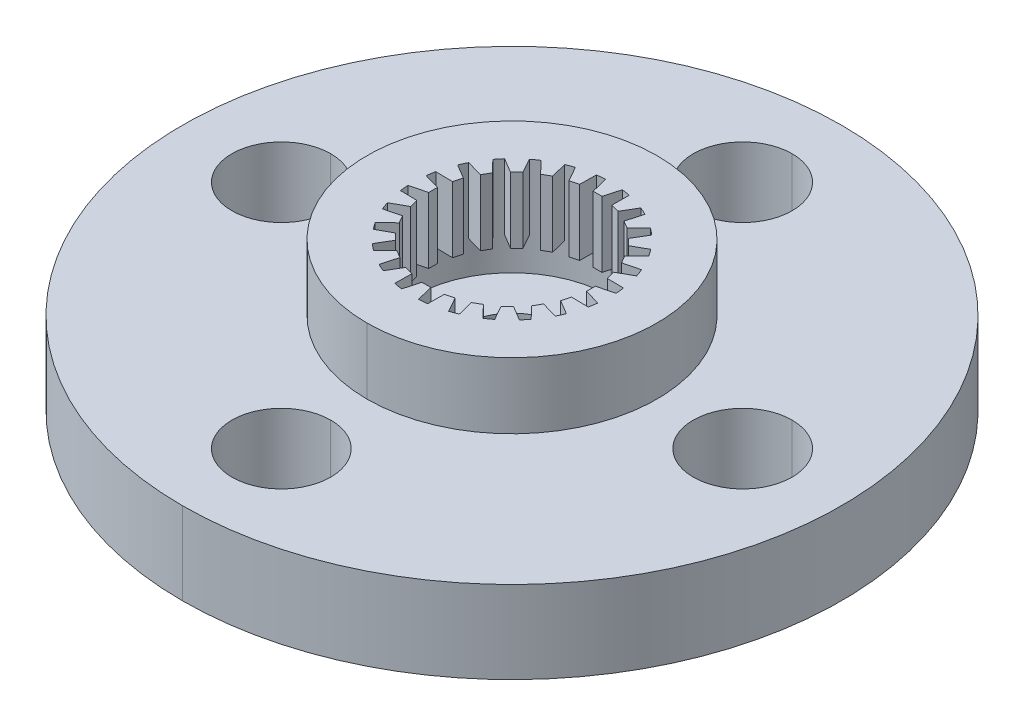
ISO-10303-21;
HEADER;
FILE_DESCRIPTION(('STEP AP214'),'2;1');
FILE_NAME('part.step','',(''),(''),'','','');
FILE_SCHEMA(('AUTOMOTIVE_DESIGN { 1 0 10303 214 1 1 1 1 }'));
ENDSEC;
DATA;
#1=APPLICATION_CONTEXT('core data for automotive mechanical design processes');
#2=APPLICATION_PROTOCOL_DEFINITION('international standard','automotive_design',2000,#1);
#3=PRODUCT_CONTEXT('',#1,'mechanical');
#4=PRODUCT('Part','Part','',(#3));
#5=PRODUCT_RELATED_PRODUCT_CATEGORY('part','',(#4));
#6=PRODUCT_DEFINITION_FORMATION('','',#4);
#7=PRODUCT_DEFINITION_CONTEXT('part definition',#1,'design');
#8=PRODUCT_DEFINITION('design','',#6,#7);
#9=PRODUCT_DEFINITION_SHAPE('','',#8);
#10=(LENGTH_UNIT() NAMED_UNIT(*) SI_UNIT(.MILLI.,.METRE.));
#11=(NAMED_UNIT(*) PLANE_ANGLE_UNIT() SI_UNIT($,.RADIAN.));
#12=(NAMED_UNIT(*) SI_UNIT($,.STERADIAN.) SOLID_ANGLE_UNIT());
#13=UNCERTAINTY_MEASURE_WITH_UNIT(LENGTH_MEASURE(1.E-05),#10,'distance_accuracy_value','');
#14=(GEOMETRIC_REPRESENTATION_CONTEXT(3) GLOBAL_UNCERTAINTY_ASSIGNED_CONTEXT((#13)) GLOBAL_UNIT_ASSIGNED_CONTEXT((#10,
#11,#12)) REPRESENTATION_CONTEXT('',''));
#15=CARTESIAN_POINT('',(0.,0.,0.));
#16=DIRECTION('',(0.,0.,1.));
#17=DIRECTION('',(1.,0.,0.));
#18=AXIS2_PLACEMENT_3D('',#15,#16,#17);
#19=CARTESIAN_POINT('',(0.,0.,0.));
#20=DIRECTION('',(0.,1.,0.));
#21=DIRECTION('',(0.,0.,1.));
#22=AXIS2_PLACEMENT_3D('',#19,#20,#21);
#23=CYLINDRICAL_SURFACE('',#22,1.5);
#24=CARTESIAN_POINT('',(0.,0.,0.));
#25=DIRECTION('',(0.,1.,0.));
#26=DIRECTION('',(0.,0.,1.));
#27=AXIS2_PLACEMENT_3D('',#24,#25,#26);
#28=CIRCLE('',#27,1.5);
#29=CARTESIAN_POINT('',(0.,0.,1.5));
#30=VERTEX_POINT('',#29);
#31=CARTESIAN_POINT('',(0.,0.,-1.5));
#32=VERTEX_POINT('',#31);
#33=EDGE_CURVE('E1581',#30,#32,#28,.T.);
#34=ORIENTED_EDGE('',*,*,#33,.F.);
#35=DIRECTION('',(0.,-1.,0.));
#36=VECTOR('',#35,1.);
#37=CARTESIAN_POINT('',(0.,1.5,1.5));
#38=LINE('',#37,#36);
#39=CARTESIAN_POINT('',(0.,1.5,1.5));
#40=VERTEX_POINT('',#39);
#41=EDGE_CURVE('E1214',#40,#30,#38,.T.);
#42=ORIENTED_EDGE('',*,*,#41,.F.);
#43=CARTESIAN_POINT('',(0.,1.5,0.));
#44=DIRECTION('',(0.,-1.,0.));
#45=DIRECTION('',(0.,0.,-1.));
#46=AXIS2_PLACEMENT_3D('',#43,#44,#45);
#47=CIRCLE('',#46,1.5);
#48=CARTESIAN_POINT('',(0.,1.5,-1.5));
#49=VERTEX_POINT('',#48);
#50=EDGE_CURVE('E1707',#49,#40,#47,.T.);
#51=ORIENTED_EDGE('',*,*,#50,.F.);
#52=DIRECTION('',(0.,-1.,0.));
#53=VECTOR('',#52,1.);
#54=CARTESIAN_POINT('',(0.,1.5,-1.5));
#55=LINE('',#54,#53);
#56=EDGE_CURVE('E1219',#49,#32,#55,.T.);
#57=ORIENTED_EDGE('',*,*,#56,.T.);
#58=EDGE_LOOP('',(#34,#42,#51,#57));
#59=FACE_BOUND('',#58,.T.);
#60=ADVANCED_FACE('F17',(#59),#23,.F.);
#61=CARTESIAN_POINT('',(2.495792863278,2.5,0.2353813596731));
#62=DIRECTION('',(-1.,0.,0.));
#63=DIRECTION('',(0.,0.,1.));
#64=AXIS2_PLACEMENT_3D('',#61,#62,#63);
#65=PLANE('',#64);
#66=DIRECTION('',(0.,-1.,0.));
#67=VECTOR('',#66,1.);
#68=CARTESIAN_POINT('',(2.495792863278,4.5,-0.03227289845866));
#69=LINE('',#68,#67);
#70=CARTESIAN_POINT('',(2.495792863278,4.5,-0.03227289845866));
#71=VERTEX_POINT('',#70);
#72=CARTESIAN_POINT('',(2.495792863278,2.5,-0.03227289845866));
#73=VERTEX_POINT('',#72);
#74=EDGE_CURVE('E11',#71,#73,#69,.T.);
#75=ORIENTED_EDGE('',*,*,#74,.T.);
#76=DIRECTION('',(0.,0.,-1.));
#77=VECTOR('',#76,1.);
#78=CARTESIAN_POINT('',(2.495792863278,2.5,0.2353813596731));
#79=LINE('',#78,#77);
#80=CARTESIAN_POINT('',(2.495792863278,2.5,0.2353813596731));
#81=VERTEX_POINT('',#80);
#82=EDGE_CURVE('E1023',#81,#73,#79,.T.);
#83=ORIENTED_EDGE('',*,*,#82,.F.);
#84=DIRECTION('',(0.,-1.,0.));
#85=VECTOR('',#84,1.);
#86=CARTESIAN_POINT('',(2.495792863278,4.5,0.2353813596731));
#87=LINE('',#86,#85);
#88=CARTESIAN_POINT('',(2.495792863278,4.5,0.2353813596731));
#89=VERTEX_POINT('',#88);
#90=EDGE_CURVE('E1024',#89,#81,#87,.T.);
#91=ORIENTED_EDGE('',*,*,#90,.F.);
#92=DIRECTION('',(0.,0.,-1.));
#93=VECTOR('',#92,1.);
#94=CARTESIAN_POINT('',(2.495792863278,4.5,0.2353813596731));
#95=LINE('',#94,#93);
#96=EDGE_CURVE('E1402',#89,#71,#95,.T.);
#97=ORIENTED_EDGE('',*,*,#96,.T.);
#98=EDGE_LOOP('',(#75,#83,#91,#97));
#99=FACE_BOUND('',#98,.T.);
#100=ADVANCED_FACE('F2152',(#99),#65,.T.);
#101=CARTESIAN_POINT('',(2.495792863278,2.5,-0.03227289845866));
#102=DIRECTION('',(-0.245365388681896,0.,-0.969430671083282));
#103=DIRECTION('',(-0.969430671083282,0.,0.245365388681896));
#104=AXIS2_PLACEMENT_3D('',#101,#102,#103);
#105=PLANE('',#104);
#106=DIRECTION('',(0.,1.,0.));
#107=VECTOR('',#106,1.);
#108=CARTESIAN_POINT('',(2.995792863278,2.5,-0.1588241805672));
#109=LINE('',#108,#107);
#110=CARTESIAN_POINT('',(2.995792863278,2.5,-0.1588241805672));
#111=VERTEX_POINT('',#110);
#112=CARTESIAN_POINT('',(2.995792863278,4.5,-0.1588241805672));
#113=VERTEX_POINT('',#112);
#114=EDGE_CURVE('E1387',#111,#113,#109,.T.);
#115=ORIENTED_EDGE('',*,*,#114,.F.);
#116=DIRECTION('',(0.969430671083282,0.,-0.245365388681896));
#117=VECTOR('',#116,1.);
#118=CARTESIAN_POINT('',(2.495792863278,2.5,-0.03227289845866));
#119=LINE('',#118,#117);
#120=EDGE_CURVE('E28',#73,#111,#119,.T.);
#121=ORIENTED_EDGE('',*,*,#120,.F.);
#122=ORIENTED_EDGE('',*,*,#74,.F.);
#123=DIRECTION('',(-0.969430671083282,0.,0.245365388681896));
#124=VECTOR('',#123,1.);
#125=CARTESIAN_POINT('',(2.995792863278,4.5,-0.1588241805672));
#126=LINE('',#125,#124);
#127=EDGE_CURVE('E1398',#113,#71,#126,.T.);
#128=ORIENTED_EDGE('',*,*,#127,.F.);
#129=EDGE_LOOP('',(#115,#121,#122,#128));
#130=FACE_BOUND('',#129,.T.);
#131=ADVANCED_FACE('F2149',(#130),#105,.T.);
#132=CARTESIAN_POINT('',(0.,2.5,0.));
#133=DIRECTION('',(0.,1.,0.));
#134=DIRECTION('',(1.,0.,0.));
#135=AXIS2_PLACEMENT_3D('',#132,#133,#134);
#136=PLANE('',#135);
#137=DIRECTION('',(-0.962234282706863,0.,-0.27222267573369));
#138=VECTOR('',#137,1.);
#139=CARTESIAN_POINT('',(2.976910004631,2.5,0.37149269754));
#140=LINE('',#139,#138);
#141=CARTESIAN_POINT('',(2.976910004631,2.5,0.37149269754));
#142=VERTEX_POINT('',#141);
#143=EDGE_CURVE('E1019',#142,#81,#140,.T.);
#144=ORIENTED_EDGE('',*,*,#143,.T.);
#145=ORIENTED_EDGE('',*,*,#82,.T.);
#146=ORIENTED_EDGE('',*,*,#120,.T.);
#147=CARTESIAN_POINT('',(0.,2.5,0.));
#148=DIRECTION('',(0.,-1.,0.));
#149=DIRECTION('',(0.998597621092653,0.,-0.0529413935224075));
#150=AXIS2_PLACEMENT_3D('',#147,#148,#149);
#151=CIRCLE('',#150,3.);
#152=EDGE_CURVE('E1392',#111,#142,#151,.T.);
#153=ORIENTED_EDGE('',*,*,#152,.T.);
#154=EDGE_LOOP('',(#144,#145,#146,#153));
#155=FACE_BOUND('',#154,.T.);
#156=ADVANCED_FACE('F2659',(#155),#136,.F.);
#157=CARTESIAN_POINT('',(2.976910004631,2.5,0.37149269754));
#158=DIRECTION('',(-0.27222267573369,0.,0.962234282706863));
#159=DIRECTION('',(0.,1.,0.));
#160=AXIS2_PLACEMENT_3D('',#157,#158,#159);
#161=PLANE('',#160);
#162=ORIENTED_EDGE('',*,*,#90,.T.);
#163=ORIENTED_EDGE('',*,*,#143,.F.);
#164=DIRECTION('',(0.,-1.,0.));
#165=VECTOR('',#164,1.);
#166=CARTESIAN_POINT('',(2.976910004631,4.5,0.37149269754));
#167=LINE('',#166,#165);
#168=CARTESIAN_POINT('',(2.976910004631,4.5,0.37149269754));
#169=VERTEX_POINT('',#168);
#170=EDGE_CURVE('E1455',#169,#142,#167,.T.);
#171=ORIENTED_EDGE('',*,*,#170,.F.);
#172=DIRECTION('',(0.962234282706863,0.,0.27222267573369));
#173=VECTOR('',#172,1.);
#174=CARTESIAN_POINT('',(2.495792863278,4.5,0.2353813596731));
#175=LINE('',#174,#173);
#176=EDGE_CURVE('E21',#89,#169,#175,.T.);
#177=ORIENTED_EDGE('',*,*,#176,.F.);
#178=EDGE_LOOP('',(#162,#163,#171,#177));
#179=FACE_BOUND('',#178,.T.);
#180=ADVANCED_FACE('F2157',(#179),#161,.T.);
#181=CARTESIAN_POINT('',(2.349829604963,2.5,0.8733196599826));
#182=DIRECTION('',(-0.965925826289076,0.,-0.258819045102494));
#183=DIRECTION('',(-0.258819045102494,0.,0.965925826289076));
#184=AXIS2_PLACEMENT_3D('',#181,#182,#183);
#185=PLANE('',#184);
#186=DIRECTION('',(0.,-1.,0.));
#187=VECTOR('',#186,1.);
#188=CARTESIAN_POINT('',(2.41910362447,4.5,0.6147854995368));
#189=LINE('',#188,#187);
#190=CARTESIAN_POINT('',(2.41910362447,4.5,0.6147854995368));
#191=VERTEX_POINT('',#190);
#192=CARTESIAN_POINT('',(2.41910362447,2.5,0.6147854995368));
#193=VERTEX_POINT('',#192);
#194=EDGE_CURVE('E1588',#191,#193,#189,.T.);
#195=ORIENTED_EDGE('',*,*,#194,.T.);
#196=DIRECTION('',(0.258819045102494,0.,-0.965925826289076));
#197=VECTOR('',#196,1.);
#198=CARTESIAN_POINT('',(2.349829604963,2.5,0.8733196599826));
#199=LINE('',#198,#197);
#200=CARTESIAN_POINT('',(2.349829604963,2.5,0.8733196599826));
#201=VERTEX_POINT('',#200);
#202=EDGE_CURVE('E1589',#201,#193,#199,.T.);
#203=ORIENTED_EDGE('',*,*,#202,.F.);
#204=DIRECTION('',(0.,-1.,0.));
#205=VECTOR('',#204,1.);
#206=CARTESIAN_POINT('',(2.349829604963,4.5,0.8733196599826));
#207=LINE('',#206,#205);
#208=CARTESIAN_POINT('',(2.349829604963,4.5,0.8733196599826));
#209=VERTEX_POINT('',#208);
#210=EDGE_CURVE('E1276',#209,#201,#207,.T.);
#211=ORIENTED_EDGE('',*,*,#210,.F.);
#212=DIRECTION('',(-0.258819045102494,0.,0.965925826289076));
#213=VECTOR('',#212,1.);
#214=CARTESIAN_POINT('',(2.41910362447,4.5,0.6147854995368));
#215=LINE('',#214,#213);
#216=EDGE_CURVE('E1435',#191,#209,#215,.T.);
#217=ORIENTED_EDGE('',*,*,#216,.F.);
#218=EDGE_LOOP('',(#195,#203,#211,#217));
#219=FACE_BOUND('',#218,.T.);
#220=ADVANCED_FACE('F2167',(#219),#185,.T.);
#221=CARTESIAN_POINT('',(2.41910362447,2.5,0.6147854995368));
#222=DIRECTION('',(0.0139023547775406,0.,-0.999903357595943));
#223=DIRECTION('',(0.,-1.,0.));
#224=AXIS2_PLACEMENT_3D('',#221,#222,#223);
#225=PLANE('',#224);
#226=DIRECTION('',(0.,1.,0.));
#227=VECTOR('',#226,1.);
#228=CARTESIAN_POINT('',(2.934820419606,2.5,0.6219558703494));
#229=LINE('',#228,#227);
#230=CARTESIAN_POINT('',(2.934820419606,2.5,0.6219558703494));
#231=VERTEX_POINT('',#230);
#232=CARTESIAN_POINT('',(2.934820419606,4.5,0.6219558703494));
#233=VERTEX_POINT('',#232);
#234=EDGE_CURVE('E1270',#231,#233,#229,.T.);
#235=ORIENTED_EDGE('',*,*,#234,.F.);
#236=DIRECTION('',(0.999903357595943,0.,0.0139023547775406));
#237=VECTOR('',#236,1.);
#238=CARTESIAN_POINT('',(2.41910362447,2.5,0.6147854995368));
#239=LINE('',#238,#237);
#240=EDGE_CURVE('E1585',#193,#231,#239,.T.);
#241=ORIENTED_EDGE('',*,*,#240,.F.);
#242=ORIENTED_EDGE('',*,*,#194,.F.);
#243=DIRECTION('',(-0.999903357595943,0.,-0.0139023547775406));
#244=VECTOR('',#243,1.);
#245=CARTESIAN_POINT('',(2.934820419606,4.5,0.6219558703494));
#246=LINE('',#245,#244);
#247=EDGE_CURVE('E1431',#233,#191,#246,.T.);
#248=ORIENTED_EDGE('',*,*,#247,.F.);
#249=EDGE_LOOP('',(#235,#241,#242,#248));
#250=FACE_BOUND('',#249,.T.);
#251=ADVANCED_FACE('F2162',(#250),#225,.T.);
#252=CARTESIAN_POINT('',(0.,2.5,0.));
#253=DIRECTION('',(0.,1.,0.));
#254=DIRECTION('',(1.,0.,0.));
#255=AXIS2_PLACEMENT_3D('',#252,#253,#254);
#256=PLANE('',#255);
#257=DIRECTION('',(-0.858990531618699,0.,-0.5119914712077));
#258=VECTOR('',#257,1.);
#259=CARTESIAN_POINT('',(2.779324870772,2.5,1.129315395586));
#260=LINE('',#259,#258);
#261=CARTESIAN_POINT('',(2.779324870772,2.5,1.129315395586));
#262=VERTEX_POINT('',#261);
#263=EDGE_CURVE('E1630',#262,#201,#260,.T.);
#264=ORIENTED_EDGE('',*,*,#263,.T.);
#265=ORIENTED_EDGE('',*,*,#202,.T.);
#266=ORIENTED_EDGE('',*,*,#240,.T.);
#267=CARTESIAN_POINT('',(0.,2.5,0.));
#268=DIRECTION('',(0.,-1.,0.));
#269=DIRECTION('',(0.97827347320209,0.,0.207318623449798));
#270=AXIS2_PLACEMENT_3D('',#267,#268,#269);
#271=CIRCLE('',#270,3.);
#272=EDGE_CURVE('E1266',#231,#262,#271,.T.);
#273=ORIENTED_EDGE('',*,*,#272,.T.);
#274=EDGE_LOOP('',(#264,#265,#266,#273));
#275=FACE_BOUND('',#274,.T.);
#276=ADVANCED_FACE('F2722',(#275),#256,.F.);
#277=CARTESIAN_POINT('',(2.779324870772,2.5,1.129315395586));
#278=DIRECTION('',(-0.5119914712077,0.,0.858990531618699));
#279=DIRECTION('',(0.,1.,0.));
#280=AXIS2_PLACEMENT_3D('',#277,#278,#279);
#281=PLANE('',#280);
#282=ORIENTED_EDGE('',*,*,#210,.T.);
#283=ORIENTED_EDGE('',*,*,#263,.F.);
#284=DIRECTION('',(0.,-1.,0.));
#285=VECTOR('',#284,1.);
#286=CARTESIAN_POINT('',(2.779324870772,4.5,1.129315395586));
#287=LINE('',#286,#285);
#288=CARTESIAN_POINT('',(2.779324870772,4.5,1.129315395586));
#289=VERTEX_POINT('',#288);
#290=EDGE_CURVE('E1271',#289,#262,#287,.T.);
#291=ORIENTED_EDGE('',*,*,#290,.F.);
#292=DIRECTION('',(0.858990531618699,0.,0.5119914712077));
#293=VECTOR('',#292,1.);
#294=CARTESIAN_POINT('',(2.349829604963,4.5,0.8733196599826));
#295=LINE('',#294,#293);
#296=EDGE_CURVE('E945',#209,#289,#295,.T.);
#297=ORIENTED_EDGE('',*,*,#296,.F.);
#298=EDGE_LOOP('',(#282,#283,#291,#297));
#299=FACE_BOUND('',#298,.T.);
#300=ADVANCED_FACE('F2169',(#299),#281,.T.);
#301=CARTESIAN_POINT('',(2.043729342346,2.5,1.451742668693));
#302=DIRECTION('',(-0.866025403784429,0.,-0.500000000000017));
#303=DIRECTION('',(-0.500000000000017,0.,0.866025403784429));
#304=AXIS2_PLACEMENT_3D('',#301,#302,#303);
#305=PLANE('',#304);
#306=DIRECTION('',(0.,-1.,0.));
#307=VECTOR('',#306,1.);
#308=CARTESIAN_POINT('',(2.177556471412,4.5,1.21994728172));
#309=LINE('',#308,#307);
#310=CARTESIAN_POINT('',(2.177556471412,4.5,1.21994728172));
#311=VERTEX_POINT('',#310);
#312=CARTESIAN_POINT('',(2.177556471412,2.5,1.21994728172));
#313=VERTEX_POINT('',#312);
#314=EDGE_CURVE('E1272',#311,#313,#309,.T.);
#315=ORIENTED_EDGE('',*,*,#314,.T.);
#316=DIRECTION('',(0.500000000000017,0.,-0.866025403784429));
#317=VECTOR('',#316,1.);
#318=CARTESIAN_POINT('',(2.043729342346,2.5,1.451742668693));
#319=LINE('',#318,#317);
#320=CARTESIAN_POINT('',(2.043729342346,2.5,1.451742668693));
#321=VERTEX_POINT('',#320);
#322=EDGE_CURVE('E1333',#321,#313,#319,.T.);
#323=ORIENTED_EDGE('',*,*,#322,.F.);
#324=DIRECTION('',(0.,-1.,0.));
#325=VECTOR('',#324,1.);
#326=CARTESIAN_POINT('',(2.043729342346,4.5,1.451742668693));
#327=LINE('',#326,#325);
#328=CARTESIAN_POINT('',(2.043729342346,4.5,1.451742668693));
#329=VERTEX_POINT('',#328);
#330=EDGE_CURVE('E1724',#329,#321,#327,.T.);
#331=ORIENTED_EDGE('',*,*,#330,.F.);
#332=DIRECTION('',(-0.500000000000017,0.,0.866025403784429));
#333=VECTOR('',#332,1.);
#334=CARTESIAN_POINT('',(2.177556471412,4.5,1.21994728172));
#335=LINE('',#334,#333);
#336=EDGE_CURVE('E944',#311,#329,#335,.T.);
#337=ORIENTED_EDGE('',*,*,#336,.F.);
#338=EDGE_LOOP('',(#315,#323,#331,#337));
#339=FACE_BOUND('',#338,.T.);
#340=ADVANCED_FACE('F2178',(#339),#305,.T.);
#341=CARTESIAN_POINT('',(2.177556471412,2.5,1.21994728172));
#342=DIRECTION('',(0.272222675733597,0.,-0.962234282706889));
#343=DIRECTION('',(0.,-1.,0.));
#344=AXIS2_PLACEMENT_3D('',#341,#342,#343);
#345=PLANE('',#344);
#346=DIRECTION('',(0.,1.,0.));
#347=VECTOR('',#346,1.);
#348=CARTESIAN_POINT('',(2.673844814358,2.5,1.360350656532));
#349=LINE('',#348,#347);
#350=CARTESIAN_POINT('',(2.673844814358,2.5,1.360350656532));
#351=VERTEX_POINT('',#350);
#352=CARTESIAN_POINT('',(2.673844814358,4.5,1.360350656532));
#353=VERTEX_POINT('',#352);
#354=EDGE_CURVE('E1480',#351,#353,#349,.T.);
#355=ORIENTED_EDGE('',*,*,#354,.F.);
#356=DIRECTION('',(0.962234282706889,0.,0.272222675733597));
#357=VECTOR('',#356,1.);
#358=CARTESIAN_POINT('',(2.177556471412,2.5,1.21994728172));
#359=LINE('',#358,#357);
#360=EDGE_CURVE('E1277',#313,#351,#359,.T.);
#361=ORIENTED_EDGE('',*,*,#360,.F.);
#362=ORIENTED_EDGE('',*,*,#314,.F.);
#363=DIRECTION('',(-0.962234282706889,0.,-0.272222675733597));
#364=VECTOR('',#363,1.);
#365=CARTESIAN_POINT('',(2.673844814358,4.5,1.360350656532));
#366=LINE('',#365,#364);
#367=EDGE_CURVE('E940',#353,#311,#366,.T.);
#368=ORIENTED_EDGE('',*,*,#367,.F.);
#369=EDGE_LOOP('',(#355,#361,#362,#368));
#370=FACE_BOUND('',#369,.T.);
#371=ADVANCED_FACE('F2175',(#370),#345,.T.);
#372=CARTESIAN_POINT('',(0.,2.5,0.));
#373=DIRECTION('',(0.,1.,0.));
#374=DIRECTION('',(1.,0.,0.));
#375=AXIS2_PLACEMENT_3D('',#372,#373,#374);
#376=PLANE('',#375);
#377=DIRECTION('',(-0.697207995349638,0.,-0.716868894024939));
#378=VECTOR('',#377,1.);
#379=CARTESIAN_POINT('',(2.392333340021,2.5,1.810177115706));
#380=LINE('',#379,#378);
#381=CARTESIAN_POINT('',(2.392333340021,2.5,1.810177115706));
#382=VERTEX_POINT('',#381);
#383=EDGE_CURVE('E1509',#382,#321,#380,.T.);
#384=ORIENTED_EDGE('',*,*,#383,.T.);
#385=ORIENTED_EDGE('',*,*,#322,.T.);
#386=ORIENTED_EDGE('',*,*,#360,.T.);
#387=CARTESIAN_POINT('',(0.,2.5,0.));
#388=DIRECTION('',(0.,-1.,0.));
#389=DIRECTION('',(0.891281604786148,0.,0.453450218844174));
#390=AXIS2_PLACEMENT_3D('',#387,#388,#389);
#391=CIRCLE('',#390,3.);
#392=EDGE_CURVE('E1338',#351,#382,#391,.T.);
#393=ORIENTED_EDGE('',*,*,#392,.T.);
#394=EDGE_LOOP('',(#384,#385,#386,#393));
#395=FACE_BOUND('',#394,.T.);
#396=ADVANCED_FACE('F2601',(#395),#376,.F.);
#397=CARTESIAN_POINT('',(2.392333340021,2.5,1.810177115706));
#398=DIRECTION('',(-0.716868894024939,0.,0.697207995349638));
#399=DIRECTION('',(0.,1.,0.));
#400=AXIS2_PLACEMENT_3D('',#397,#398,#399);
#401=PLANE('',#400);
#402=ORIENTED_EDGE('',*,*,#330,.T.);
#403=ORIENTED_EDGE('',*,*,#383,.F.);
#404=DIRECTION('',(0.,-1.,0.));
#405=VECTOR('',#404,1.);
#406=CARTESIAN_POINT('',(2.392333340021,4.5,1.810177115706));
#407=LINE('',#406,#405);
#408=CARTESIAN_POINT('',(2.392333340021,4.5,1.810177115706));
#409=VERTEX_POINT('',#408);
#410=EDGE_CURVE('E1334',#409,#382,#407,.T.);
#411=ORIENTED_EDGE('',*,*,#410,.F.);
#412=DIRECTION('',(0.697207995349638,0.,0.716868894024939));
#413=VECTOR('',#412,1.);
#414=CARTESIAN_POINT('',(2.043729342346,4.5,1.451742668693));
#415=LINE('',#414,#413);
#416=EDGE_CURVE('E1342',#329,#409,#415,.T.);
#417=ORIENTED_EDGE('',*,*,#416,.F.);
#418=EDGE_LOOP('',(#402,#403,#411,#417));
#419=FACE_BOUND('',#418,.T.);
#420=ADVANCED_FACE('F2182',(#419),#401,.T.);
#421=CARTESIAN_POINT('',(1.598352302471,2.5,1.931231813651));
#422=DIRECTION('',(-0.707106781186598,0.,-0.707106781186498));
#423=DIRECTION('',(-0.707106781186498,0.,0.707106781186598));
#424=AXIS2_PLACEMENT_3D('',#421,#422,#423);
#425=PLANE('',#424);
#426=DIRECTION('',(0.,-1.,0.));
#427=VECTOR('',#426,1.);
#428=CARTESIAN_POINT('',(1.78761244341,4.5,1.741971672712));
#429=LINE('',#428,#427);
#430=CARTESIAN_POINT('',(1.78761244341,4.5,1.741971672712));
#431=VERTEX_POINT('',#430);
#432=CARTESIAN_POINT('',(1.78761244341,2.5,1.741971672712));
#433=VERTEX_POINT('',#432);
#434=EDGE_CURVE('E1728',#431,#433,#429,.T.);
#435=ORIENTED_EDGE('',*,*,#434,.T.);
#436=DIRECTION('',(0.707106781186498,0.,-0.707106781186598));
#437=VECTOR('',#436,1.);
#438=CARTESIAN_POINT('',(1.598352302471,2.5,1.931231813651));
#439=LINE('',#438,#437);
#440=CARTESIAN_POINT('',(1.598352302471,2.5,1.931231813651));
#441=VERTEX_POINT('',#440);
#442=EDGE_CURVE('E1005',#441,#433,#439,.T.);
#443=ORIENTED_EDGE('',*,*,#442,.F.);
#444=DIRECTION('',(0.,-1.,0.));
#445=VECTOR('',#444,1.);
#446=CARTESIAN_POINT('',(1.598352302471,4.5,1.931231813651));
#447=LINE('',#446,#445);
#448=CARTESIAN_POINT('',(1.598352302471,4.5,1.931231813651));
#449=VERTEX_POINT('',#448);
#450=EDGE_CURVE('E1006',#449,#441,#447,.T.);
#451=ORIENTED_EDGE('',*,*,#450,.F.);
#452=DIRECTION('',(-0.707106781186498,0.,0.707106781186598));
#453=VECTOR('',#452,1.);
#454=CARTESIAN_POINT('',(1.78761244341,4.5,1.741971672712));
#455=LINE('',#454,#453);
#456=EDGE_CURVE('E1488',#431,#449,#455,.T.);
#457=ORIENTED_EDGE('',*,*,#456,.F.);
#458=EDGE_LOOP('',(#435,#443,#451,#457));
#459=FACE_BOUND('',#458,.T.);
#460=ADVANCED_FACE('F2193',(#459),#425,.T.);
#461=CARTESIAN_POINT('',(1.78761244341,2.5,1.741971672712));
#462=DIRECTION('',(0.5119914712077,0.,-0.858990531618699));
#463=DIRECTION('',(0.,-1.,0.));
#464=AXIS2_PLACEMENT_3D('',#461,#462,#463);
#465=PLANE('',#464);
#466=DIRECTION('',(0.,1.,0.));
#467=VECTOR('',#466,1.);
#468=CARTESIAN_POINT('',(2.23065110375,2.5,2.006039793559));
#469=LINE('',#468,#467);
#470=CARTESIAN_POINT('',(2.23065110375,2.5,2.006039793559));
#471=VERTEX_POINT('',#470);
#472=CARTESIAN_POINT('',(2.23065110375,4.5,2.006039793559));
#473=VERTEX_POINT('',#472);
#474=EDGE_CURVE('E1037',#471,#473,#469,.T.);
#475=ORIENTED_EDGE('',*,*,#474,.F.);
#476=DIRECTION('',(0.858990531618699,0.,0.5119914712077));
#477=VECTOR('',#476,1.);
#478=CARTESIAN_POINT('',(1.78761244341,2.5,1.741971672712));
#479=LINE('',#478,#477);
#480=EDGE_CURVE('E1593',#433,#471,#479,.T.);
#481=ORIENTED_EDGE('',*,*,#480,.F.);
#482=ORIENTED_EDGE('',*,*,#434,.F.);
#483=DIRECTION('',(-0.858990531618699,0.,-0.5119914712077));
#484=VECTOR('',#483,1.);
#485=CARTESIAN_POINT('',(2.23065110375,4.5,2.006039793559));
#486=LINE('',#485,#484);
#487=EDGE_CURVE('E1345',#473,#431,#486,.T.);
#488=ORIENTED_EDGE('',*,*,#487,.F.);
#489=EDGE_LOOP('',(#475,#481,#482,#488));
#490=FACE_BOUND('',#489,.T.);
#491=ADVANCED_FACE('F2188',(#490),#465,.T.);
#492=CARTESIAN_POINT('',(0.,2.5,0.));
#493=DIRECTION('',(0.,1.,0.));
#494=DIRECTION('',(1.,0.,0.));
#495=AXIS2_PLACEMENT_3D('',#492,#493,#494);
#496=PLANE('',#495);
#497=DIRECTION('',(-0.487911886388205,0.,-0.872892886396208));
#498=VECTOR('',#497,1.);
#499=CARTESIAN_POINT('',(1.842308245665,2.5,2.367678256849));
#500=LINE('',#499,#498);
#501=CARTESIAN_POINT('',(1.842308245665,2.5,2.367678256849));
#502=VERTEX_POINT('',#501);
#503=EDGE_CURVE('E1001',#502,#441,#500,.T.);
#504=ORIENTED_EDGE('',*,*,#503,.T.);
#505=ORIENTED_EDGE('',*,*,#442,.T.);
#506=ORIENTED_EDGE('',*,*,#480,.T.);
#507=CARTESIAN_POINT('',(0.,2.5,0.));
#508=DIRECTION('',(0.,-1.,0.));
#509=DIRECTION('',(0.743550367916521,0.,0.668679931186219));
#510=AXIS2_PLACEMENT_3D('',#507,#508,#509);
#511=CIRCLE('',#510,3.);
#512=EDGE_CURVE('E1042',#471,#502,#511,.T.);
#513=ORIENTED_EDGE('',*,*,#512,.T.);
#514=EDGE_LOOP('',(#504,#505,#506,#513));
#515=FACE_BOUND('',#514,.T.);
#516=ADVANCED_FACE('F2541',(#515),#496,.F.);
#517=CARTESIAN_POINT('',(1.842308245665,2.5,2.367678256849));
#518=DIRECTION('',(-0.872892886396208,0.,0.487911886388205));
#519=DIRECTION('',(0.,1.,0.));
#520=AXIS2_PLACEMENT_3D('',#517,#518,#519);
#521=PLANE('',#520);
#522=ORIENTED_EDGE('',*,*,#450,.T.);
#523=ORIENTED_EDGE('',*,*,#503,.F.);
#524=DIRECTION('',(0.,-1.,0.));
#525=VECTOR('',#524,1.);
#526=CARTESIAN_POINT('',(1.842308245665,4.5,2.367678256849));
#527=LINE('',#526,#525);
#528=CARTESIAN_POINT('',(1.842308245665,4.5,2.367678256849));
#529=VERTEX_POINT('',#528);
#530=EDGE_CURVE('E1752',#529,#502,#527,.T.);
#531=ORIENTED_EDGE('',*,*,#530,.F.);
#532=DIRECTION('',(0.487911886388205,0.,0.872892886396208));
#533=VECTOR('',#532,1.);
#534=CARTESIAN_POINT('',(1.598352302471,4.5,1.931231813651));
#535=LINE('',#534,#533);
#536=EDGE_CURVE('E1210',#449,#529,#535,.T.);
#537=ORIENTED_EDGE('',*,*,#536,.F.);
#538=EDGE_LOOP('',(#522,#523,#531,#537));
#539=FACE_BOUND('',#538,.T.);
#540=ADVANCED_FACE('F2545',(#539),#521,.T.);
#541=CARTESIAN_POINT('',(1.044050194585,2.5,2.279110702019));
#542=DIRECTION('',(-0.500000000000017,0.,-0.866025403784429));
#543=DIRECTION('',(-0.866025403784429,0.,0.500000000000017));
#544=AXIS2_PLACEMENT_3D('',#541,#542,#543);
#545=PLANE('',#544);
#546=DIRECTION('',(0.,-1.,0.));
#547=VECTOR('',#546,1.);
#548=CARTESIAN_POINT('',(1.275845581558,4.5,2.145283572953));
#549=LINE('',#548,#547);
#550=CARTESIAN_POINT('',(1.275845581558,4.5,2.145283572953));
#551=VERTEX_POINT('',#550);
#552=CARTESIAN_POINT('',(1.275845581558,2.5,2.145283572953));
#553=VERTEX_POINT('',#552);
#554=EDGE_CURVE('E1540',#551,#553,#549,.T.);
#555=ORIENTED_EDGE('',*,*,#554,.T.);
#556=DIRECTION('',(0.866025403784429,0.,-0.500000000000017));
#557=VECTOR('',#556,1.);
#558=CARTESIAN_POINT('',(1.044050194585,2.5,2.279110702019));
#559=LINE('',#558,#557);
#560=CARTESIAN_POINT('',(1.044050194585,2.5,2.279110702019));
#561=VERTEX_POINT('',#560);
#562=EDGE_CURVE('E1124',#561,#553,#559,.T.);
#563=ORIENTED_EDGE('',*,*,#562,.F.);
#564=DIRECTION('',(0.,-1.,0.));
#565=VECTOR('',#564,1.);
#566=CARTESIAN_POINT('',(1.044050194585,4.5,2.279110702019));
#567=LINE('',#566,#565);
#568=CARTESIAN_POINT('',(1.044050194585,4.5,2.279110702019));
#569=VERTEX_POINT('',#568);
#570=EDGE_CURVE('E1623',#569,#561,#567,.T.);
#571=ORIENTED_EDGE('',*,*,#570,.F.);
#572=DIRECTION('',(-0.866025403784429,0.,0.500000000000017));
#573=VECTOR('',#572,1.);
#574=CARTESIAN_POINT('',(1.275845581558,4.5,2.145283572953));
#575=LINE('',#574,#573);
#576=EDGE_CURVE('E1209',#551,#569,#575,.T.);
#577=ORIENTED_EDGE('',*,*,#576,.F.);
#578=EDGE_LOOP('',(#555,#563,#571,#577));
#579=FACE_BOUND('',#578,.T.);
#580=ADVANCED_FACE('F2808',(#579),#545,.T.);
#581=CARTESIAN_POINT('',(1.275845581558,2.5,2.145283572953));
#582=DIRECTION('',(0.716868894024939,0.,-0.697207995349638));
#583=DIRECTION('',(0.,-1.,0.));
#584=AXIS2_PLACEMENT_3D('',#581,#582,#583);
#585=PLANE('',#584);
#586=DIRECTION('',(0.,1.,0.));
#587=VECTOR('',#586,1.);
#588=CARTESIAN_POINT('',(1.635442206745,2.5,2.515020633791));
#589=LINE('',#588,#587);
#590=CARTESIAN_POINT('',(1.635442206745,2.5,2.515020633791));
#591=VERTEX_POINT('',#590);
#592=CARTESIAN_POINT('',(1.635442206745,4.5,2.515020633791));
#593=VERTEX_POINT('',#592);
#594=EDGE_CURVE('E1849',#591,#593,#589,.T.);
#595=ORIENTED_EDGE('',*,*,#594,.F.);
#596=DIRECTION('',(0.697207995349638,0.,0.716868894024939));
#597=VECTOR('',#596,1.);
#598=CARTESIAN_POINT('',(1.275845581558,2.5,2.145283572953));
#599=LINE('',#598,#597);
#600=EDGE_CURVE('E1128',#553,#591,#599,.T.);
#601=ORIENTED_EDGE('',*,*,#600,.F.);
#602=ORIENTED_EDGE('',*,*,#554,.F.);
#603=DIRECTION('',(-0.697207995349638,0.,-0.716868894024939));
#604=VECTOR('',#603,1.);
#605=CARTESIAN_POINT('',(1.635442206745,4.5,2.515020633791));
#606=LINE('',#605,#604);
#607=EDGE_CURVE('E1205',#593,#551,#606,.T.);
#608=ORIENTED_EDGE('',*,*,#607,.F.);
#609=EDGE_LOOP('',(#595,#601,#602,#608));
#610=FACE_BOUND('',#609,.T.);
#611=ADVANCED_FACE('F2363',(#610),#585,.T.);
#612=CARTESIAN_POINT('',(0.,2.5,0.));
#613=DIRECTION('',(0.,1.,0.));
#614=DIRECTION('',(1.,0.,0.));
#615=AXIS2_PLACEMENT_3D('',#612,#613,#614);
#616=PLANE('',#615);
#617=DIRECTION('',(-0.245365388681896,0.,-0.969430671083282));
#618=VECTOR('',#617,1.);
#619=CARTESIAN_POINT('',(1.166732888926,2.5,2.763826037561));
#620=LINE('',#619,#618);
#621=CARTESIAN_POINT('',(1.166732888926,2.5,2.763826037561));
#622=VERTEX_POINT('',#621);
#623=EDGE_CURVE('E1129',#622,#561,#620,.T.);
#624=ORIENTED_EDGE('',*,*,#623,.T.);
#625=ORIENTED_EDGE('',*,*,#562,.T.);
#626=ORIENTED_EDGE('',*,*,#600,.T.);
#627=CARTESIAN_POINT('',(0.,2.5,0.));
#628=DIRECTION('',(0.,-1.,0.));
#629=DIRECTION('',(0.545147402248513,0.,0.83834021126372));
#630=AXIS2_PLACEMENT_3D('',#627,#628,#629);
#631=CIRCLE('',#630,3.);
#632=EDGE_CURVE('E1190',#591,#622,#631,.T.);
#633=ORIENTED_EDGE('',*,*,#632,.T.);
#634=EDGE_LOOP('',(#624,#625,#626,#633));
#635=FACE_BOUND('',#634,.T.);
#636=ADVANCED_FACE('F2358',(#635),#616,.F.);
#637=CARTESIAN_POINT('',(1.166732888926,2.5,2.763826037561));
#638=DIRECTION('',(-0.969430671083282,0.,0.245365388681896));
#639=DIRECTION('',(0.,1.,0.));
#640=AXIS2_PLACEMENT_3D('',#637,#638,#639);
#641=PLANE('',#640);
#642=ORIENTED_EDGE('',*,*,#570,.T.);
#643=ORIENTED_EDGE('',*,*,#623,.F.);
#644=DIRECTION('',(0.,-1.,0.));
#645=VECTOR('',#644,1.);
#646=CARTESIAN_POINT('',(1.166732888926,4.5,2.763826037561));
#647=LINE('',#646,#645);
#648=CARTESIAN_POINT('',(1.166732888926,4.5,2.763826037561));
#649=VERTEX_POINT('',#648);
#650=EDGE_CURVE('E1186',#649,#622,#647,.T.);
#651=ORIENTED_EDGE('',*,*,#650,.F.);
#652=DIRECTION('',(0.245365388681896,0.,0.969430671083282));
#653=VECTOR('',#652,1.);
#654=CARTESIAN_POINT('',(1.044050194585,4.5,2.279110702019));
#655=LINE('',#654,#653);
#656=EDGE_CURVE('E1386',#569,#649,#655,.T.);
#657=ORIENTED_EDGE('',*,*,#656,.F.);
#658=EDGE_LOOP('',(#642,#643,#651,#657));
#659=FACE_BOUND('',#658,.T.);
#660=ADVANCED_FACE('F2362',(#659),#641,.T.);
#661=CARTESIAN_POINT('',(0.418597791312,2.5,2.471671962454));
#662=DIRECTION('',(-0.258819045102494,0.,-0.965925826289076));
#663=DIRECTION('',(-0.965925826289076,0.,0.258819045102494));
#664=AXIS2_PLACEMENT_3D('',#661,#662,#663);
#665=PLANE('',#664);
#666=DIRECTION('',(0.,-1.,0.));
#667=VECTOR('',#666,1.);
#668=CARTESIAN_POINT('',(0.6771319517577,4.5,2.402397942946));
#669=LINE('',#668,#667);
#670=CARTESIAN_POINT('',(0.6771319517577,4.5,2.402397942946));
#671=VERTEX_POINT('',#670);
#672=CARTESIAN_POINT('',(0.6771319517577,2.5,2.402397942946));
#673=VERTEX_POINT('',#672);
#674=EDGE_CURVE('E1412',#671,#673,#669,.T.);
#675=ORIENTED_EDGE('',*,*,#674,.T.);
#676=DIRECTION('',(0.965925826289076,0.,-0.258819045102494));
#677=VECTOR('',#676,1.);
#678=CARTESIAN_POINT('',(0.418597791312,2.5,2.471671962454));
#679=LINE('',#678,#677);
#680=CARTESIAN_POINT('',(0.418597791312,2.5,2.471671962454));
#681=VERTEX_POINT('',#680);
#682=EDGE_CURVE('E1017',#681,#673,#679,.T.);
#683=ORIENTED_EDGE('',*,*,#682,.F.);
#684=DIRECTION('',(0.,-1.,0.));
#685=VECTOR('',#684,1.);
#686=CARTESIAN_POINT('',(0.418597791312,4.5,2.471671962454));
#687=LINE('',#686,#685);
#688=CARTESIAN_POINT('',(0.418597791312,4.5,2.471671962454));
#689=VERTEX_POINT('',#688);
#690=EDGE_CURVE('E1018',#689,#681,#687,.T.);
#691=ORIENTED_EDGE('',*,*,#690,.F.);
#692=DIRECTION('',(-0.965925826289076,0.,0.258819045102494));
#693=VECTOR('',#692,1.);
#694=CARTESIAN_POINT('',(0.6771319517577,4.5,2.402397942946));
#695=LINE('',#694,#693);
#696=EDGE_CURVE('E1185',#671,#689,#695,.T.);
#697=ORIENTED_EDGE('',*,*,#696,.F.);
#698=EDGE_LOOP('',(#675,#683,#691,#697));
#699=FACE_BOUND('',#698,.T.);
#700=ADVANCED_FACE('F2873',(#699),#665,.T.);
#701=CARTESIAN_POINT('',(0.6771319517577,2.5,2.402397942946));
#702=DIRECTION('',(0.872892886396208,0.,-0.487911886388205));
#703=DIRECTION('',(0.,-1.,0.));
#704=AXIS2_PLACEMENT_3D('',#701,#702,#703);
#705=PLANE('',#704);
#706=DIRECTION('',(0.,1.,0.));
#707=VECTOR('',#706,1.);
#708=CARTESIAN_POINT('',(0.9287806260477,2.5,2.852606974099));
#709=LINE('',#708,#707);
#710=CARTESIAN_POINT('',(0.9287806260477,2.5,2.852606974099));
#711=VERTEX_POINT('',#710);
#712=CARTESIAN_POINT('',(0.9287806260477,4.5,2.852606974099));
#713=VERTEX_POINT('',#712);
#714=EDGE_CURVE('E1075',#711,#713,#709,.T.);
#715=ORIENTED_EDGE('',*,*,#714,.F.);
#716=DIRECTION('',(0.487911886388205,0.,0.872892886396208));
#717=VECTOR('',#716,1.);
#718=CARTESIAN_POINT('',(0.6771319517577,2.5,2.402397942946));
#719=LINE('',#718,#717);
#720=EDGE_CURVE('E1409',#673,#711,#719,.T.);
#721=ORIENTED_EDGE('',*,*,#720,.F.);
#722=ORIENTED_EDGE('',*,*,#674,.F.);
#723=DIRECTION('',(-0.487911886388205,0.,-0.872892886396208));
#724=VECTOR('',#723,1.);
#725=CARTESIAN_POINT('',(0.9287806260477,4.5,2.852606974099));
#726=LINE('',#725,#724);
#727=EDGE_CURVE('E1382',#713,#671,#726,.T.);
#728=ORIENTED_EDGE('',*,*,#727,.F.);
#729=EDGE_LOOP('',(#715,#721,#722,#728));
#730=FACE_BOUND('',#729,.T.);
#731=ADVANCED_FACE('F2473',(#730),#705,.T.);
#732=CARTESIAN_POINT('',(0.,2.5,0.));
#733=DIRECTION('',(0.,1.,0.));
#734=DIRECTION('',(1.,0.,0.));
#735=AXIS2_PLACEMENT_3D('',#732,#733,#734);
#736=PLANE('',#735);
#737=DIRECTION('',(0.0139023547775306,0.,-0.999903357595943));
#738=VECTOR('',#737,1.);
#739=CARTESIAN_POINT('',(0.4116466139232,2.5,2.971623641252));
#740=LINE('',#739,#738);
#741=CARTESIAN_POINT('',(0.4116466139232,2.5,2.971623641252));
#742=VERTEX_POINT('',#741);
#743=EDGE_CURVE('E1013',#742,#681,#740,.T.);
#744=ORIENTED_EDGE('',*,*,#743,.T.);
#745=ORIENTED_EDGE('',*,*,#682,.T.);
#746=ORIENTED_EDGE('',*,*,#720,.T.);
#747=CARTESIAN_POINT('',(0.,2.5,0.));
#748=DIRECTION('',(0.,-1.,0.));
#749=DIRECTION('',(0.309593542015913,0.,0.95086899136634));
#750=AXIS2_PLACEMENT_3D('',#747,#748,#749);
#751=CIRCLE('',#750,3.);
#752=EDGE_CURVE('E1080',#711,#742,#751,.T.);
#753=ORIENTED_EDGE('',*,*,#752,.T.);
#754=EDGE_LOOP('',(#744,#745,#746,#753));
#755=FACE_BOUND('',#754,.T.);
#756=ADVANCED_FACE('F2468',(#755),#736,.F.);
#757=CARTESIAN_POINT('',(0.4116466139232,2.5,2.971623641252));
#758=DIRECTION('',(-0.999903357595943,0.,-0.0139023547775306));
#759=DIRECTION('',(-0.0139023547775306,0.,0.999903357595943));
#760=AXIS2_PLACEMENT_3D('',#757,#758,#759);
#761=PLANE('',#760);
#762=ORIENTED_EDGE('',*,*,#690,.T.);
#763=ORIENTED_EDGE('',*,*,#743,.F.);
#764=DIRECTION('',(0.,-1.,0.));
#765=VECTOR('',#764,1.);
#766=CARTESIAN_POINT('',(0.4116466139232,4.5,2.971623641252));
#767=LINE('',#766,#765);
#768=CARTESIAN_POINT('',(0.4116466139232,4.5,2.971623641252));
#769=VERTEX_POINT('',#768);
#770=EDGE_CURVE('E1035',#769,#742,#767,.T.);
#771=ORIENTED_EDGE('',*,*,#770,.F.);
#772=DIRECTION('',(-0.0139023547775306,0.,0.999903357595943));
#773=VECTOR('',#772,1.);
#774=CARTESIAN_POINT('',(0.418597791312,4.5,2.471671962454));
#775=LINE('',#774,#773);
#776=EDGE_CURVE('E1181',#689,#769,#775,.T.);
#777=ORIENTED_EDGE('',*,*,#776,.F.);
#778=EDGE_LOOP('',(#762,#763,#771,#777));
#779=FACE_BOUND('',#778,.T.);
#780=ADVANCED_FACE('F2472',(#779),#761,.T.);
#781=CARTESIAN_POINT('',(-0.2353813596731,2.5,2.495792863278));
#782=DIRECTION('',(0.,0.,-1.));
#783=DIRECTION('',(0.,-1.,0.));
#784=AXIS2_PLACEMENT_3D('',#781,#782,#783);
#785=PLANE('',#784);
#786=DIRECTION('',(0.,-1.,0.));
#787=VECTOR('',#786,1.);
#788=CARTESIAN_POINT('',(0.03227289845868,4.5,2.495792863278));
#789=LINE('',#788,#787);
#790=CARTESIAN_POINT('',(0.03227289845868,4.5,2.495792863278));
#791=VERTEX_POINT('',#790);
#792=CARTESIAN_POINT('',(0.03227289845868,2.5,2.495792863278));
#793=VERTEX_POINT('',#792);
#794=EDGE_CURVE('E976',#791,#793,#789,.T.);
#795=ORIENTED_EDGE('',*,*,#794,.T.);
#796=DIRECTION('',(1.,0.,0.));
#797=VECTOR('',#796,1.);
#798=CARTESIAN_POINT('',(-0.2353813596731,2.5,2.495792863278));
#799=LINE('',#798,#797);
#800=CARTESIAN_POINT('',(-0.2353813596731,2.5,2.495792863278));
#801=VERTEX_POINT('',#800);
#802=EDGE_CURVE('E934',#801,#793,#799,.T.);
#803=ORIENTED_EDGE('',*,*,#802,.F.);
#804=DIRECTION('',(0.,-1.,0.));
#805=VECTOR('',#804,1.);
#806=CARTESIAN_POINT('',(-0.2353813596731,4.5,2.495792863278));
#807=LINE('',#806,#805);
#808=CARTESIAN_POINT('',(-0.2353813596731,4.5,2.495792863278));
#809=VERTEX_POINT('',#808);
#810=EDGE_CURVE('E1627',#809,#801,#807,.T.);
#811=ORIENTED_EDGE('',*,*,#810,.F.);
#812=DIRECTION('',(1.,0.,0.));
#813=VECTOR('',#812,1.);
#814=CARTESIAN_POINT('',(-0.2353813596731,4.5,2.495792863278));
#815=LINE('',#814,#813);
#816=EDGE_CURVE('E1200',#809,#791,#815,.T.);
#817=ORIENTED_EDGE('',*,*,#816,.T.);
#818=EDGE_LOOP('',(#795,#803,#811,#817));
#819=FACE_BOUND('',#818,.T.);
#820=ADVANCED_FACE('F2482',(#819),#785,.T.);
#821=CARTESIAN_POINT('',(0.03227289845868,2.5,2.495792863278));
#822=DIRECTION('',(0.969430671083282,0.,-0.245365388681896));
#823=DIRECTION('',(0.,-1.,0.));
#824=AXIS2_PLACEMENT_3D('',#821,#822,#823);
#825=PLANE('',#824);
#826=DIRECTION('',(0.,1.,0.));
#827=VECTOR('',#826,1.);
#828=CARTESIAN_POINT('',(0.1588241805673,2.5,2.995792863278));
#829=LINE('',#828,#827);
#830=CARTESIAN_POINT('',(0.1588241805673,2.5,2.995792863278));
#831=VERTEX_POINT('',#830);
#832=CARTESIAN_POINT('',(0.1588241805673,4.5,2.995792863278));
#833=VERTEX_POINT('',#832);
#834=EDGE_CURVE('E1036',#831,#833,#829,.T.);
#835=ORIENTED_EDGE('',*,*,#834,.F.);
#836=DIRECTION('',(0.245365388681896,0.,0.969430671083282));
#837=VECTOR('',#836,1.);
#838=CARTESIAN_POINT('',(0.03227289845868,2.5,2.495792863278));
#839=LINE('',#838,#837);
#840=EDGE_CURVE('E938',#793,#831,#839,.T.);
#841=ORIENTED_EDGE('',*,*,#840,.F.);
#842=ORIENTED_EDGE('',*,*,#794,.F.);
#843=DIRECTION('',(-0.245365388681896,0.,-0.969430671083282));
#844=VECTOR('',#843,1.);
#845=CARTESIAN_POINT('',(0.1588241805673,4.5,2.995792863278));
#846=LINE('',#845,#844);
#847=EDGE_CURVE('E1184',#833,#791,#846,.T.);
#848=ORIENTED_EDGE('',*,*,#847,.F.);
#849=EDGE_LOOP('',(#835,#841,#842,#848));
#850=FACE_BOUND('',#849,.T.);
#851=ADVANCED_FACE('F3009',(#850),#825,.T.);
#852=CARTESIAN_POINT('',(0.,2.5,0.));
#853=DIRECTION('',(0.,1.,0.));
#854=DIRECTION('',(1.,0.,0.));
#855=AXIS2_PLACEMENT_3D('',#852,#853,#854);
#856=PLANE('',#855);
#857=DIRECTION('',(0.272222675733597,0.,-0.962234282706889));
#858=VECTOR('',#857,1.);
#859=CARTESIAN_POINT('',(-0.3714926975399,2.5,2.976910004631));
#860=LINE('',#859,#858);
#861=CARTESIAN_POINT('',(-0.3714926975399,2.5,2.976910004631));
#862=VERTEX_POINT('',#861);
#863=EDGE_CURVE('E939',#862,#801,#860,.T.);
#864=ORIENTED_EDGE('',*,*,#863,.T.);
#865=ORIENTED_EDGE('',*,*,#802,.T.);
#866=ORIENTED_EDGE('',*,*,#840,.T.);
#867=CARTESIAN_POINT('',(0.,2.5,0.));
#868=DIRECTION('',(0.,-1.,0.));
#869=DIRECTION('',(0.0529413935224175,0.,0.998597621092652));
#870=AXIS2_PLACEMENT_3D('',#867,#868,#869);
#871=CIRCLE('',#870,3.);
#872=CARTESIAN_POINT('',(0.,2.5,3.));
#873=VERTEX_POINT('',#872);
#874=EDGE_CURVE('E1573',#831,#873,#871,.T.);
#875=ORIENTED_EDGE('',*,*,#874,.T.);
#876=CARTESIAN_POINT('',(0.,2.5,0.));
#877=DIRECTION('',(0.,-1.,0.));
#878=DIRECTION('',(0.,0.,1.));
#879=AXIS2_PLACEMENT_3D('',#876,#877,#878);
#880=CIRCLE('',#879,3.);
#881=EDGE_CURVE('E1708',#873,#862,#880,.T.);
#882=ORIENTED_EDGE('',*,*,#881,.T.);
#883=EDGE_LOOP('',(#864,#865,#866,#875,#882));
#884=FACE_BOUND('',#883,.T.);
#885=ADVANCED_FACE('F2688',(#884),#856,.F.);
#886=CARTESIAN_POINT('',(-0.3714926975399,2.5,2.976910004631));
#887=DIRECTION('',(-0.962234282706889,0.,-0.272222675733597));
#888=DIRECTION('',(-0.272222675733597,0.,0.962234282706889));
#889=AXIS2_PLACEMENT_3D('',#886,#887,#888);
#890=PLANE('',#889);
#891=ORIENTED_EDGE('',*,*,#810,.T.);
#892=ORIENTED_EDGE('',*,*,#863,.F.);
#893=DIRECTION('',(0.,-1.,0.));
#894=VECTOR('',#893,1.);
#895=CARTESIAN_POINT('',(-0.3714926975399,4.5,2.976910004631));
#896=LINE('',#895,#894);
#897=CARTESIAN_POINT('',(-0.3714926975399,4.5,2.976910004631));
#898=VERTEX_POINT('',#897);
#899=EDGE_CURVE('E1424',#898,#862,#896,.T.);
#900=ORIENTED_EDGE('',*,*,#899,.F.);
#901=DIRECTION('',(-0.272222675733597,0.,0.962234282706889));
#902=VECTOR('',#901,1.);
#903=CARTESIAN_POINT('',(-0.2353813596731,4.5,2.495792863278));
#904=LINE('',#903,#902);
#905=EDGE_CURVE('E1204',#809,#898,#904,.T.);
#906=ORIENTED_EDGE('',*,*,#905,.F.);
#907=EDGE_LOOP('',(#891,#892,#900,#906));
#908=FACE_BOUND('',#907,.T.);
#909=ADVANCED_FACE('F2650',(#908),#890,.T.);
#910=CARTESIAN_POINT('',(-0.8733196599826,2.5,2.349829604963));
#911=DIRECTION('',(0.258819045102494,0.,-0.965925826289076));
#912=DIRECTION('',(0.,-1.,0.));
#913=AXIS2_PLACEMENT_3D('',#910,#911,#912);
#914=PLANE('',#913);
#915=DIRECTION('',(0.,-1.,0.));
#916=VECTOR('',#915,1.);
#917=CARTESIAN_POINT('',(-0.6147854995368,4.5,2.41910362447));
#918=LINE('',#917,#916);
#919=CARTESIAN_POINT('',(-0.6147854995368,4.5,2.41910362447));
#920=VERTEX_POINT('',#919);
#921=CARTESIAN_POINT('',(-0.6147854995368,2.5,2.41910362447));
#922=VERTEX_POINT('',#921);
#923=EDGE_CURVE('E1624',#920,#922,#918,.T.);
#924=ORIENTED_EDGE('',*,*,#923,.T.);
#925=DIRECTION('',(0.965925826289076,0.,0.258819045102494));
#926=VECTOR('',#925,1.);
#927=CARTESIAN_POINT('',(-0.8733196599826,2.5,2.349829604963));
#928=LINE('',#927,#926);
#929=CARTESIAN_POINT('',(-0.8733196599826,2.5,2.349829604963));
#930=VERTEX_POINT('',#929);
#931=EDGE_CURVE('E1173',#930,#922,#928,.T.);
#932=ORIENTED_EDGE('',*,*,#931,.F.);
#933=DIRECTION('',(0.,-1.,0.));
#934=VECTOR('',#933,1.);
#935=CARTESIAN_POINT('',(-0.8733196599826,4.5,2.349829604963));
#936=LINE('',#935,#934);
#937=CARTESIAN_POINT('',(-0.8733196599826,4.5,2.349829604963));
#938=VERTEX_POINT('',#937);
#939=EDGE_CURVE('E1061',#938,#930,#936,.T.);
#940=ORIENTED_EDGE('',*,*,#939,.F.);
#941=DIRECTION('',(-0.965925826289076,0.,-0.258819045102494));
#942=VECTOR('',#941,1.);
#943=CARTESIAN_POINT('',(-0.6147854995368,4.5,2.41910362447));
#944=LINE('',#943,#942);
#945=EDGE_CURVE('E1228',#920,#938,#944,.T.);
#946=ORIENTED_EDGE('',*,*,#945,.F.);
#947=EDGE_LOOP('',(#924,#932,#940,#946));
#948=FACE_BOUND('',#947,.T.);
#949=ADVANCED_FACE('F2414',(#948),#914,.T.);
#950=CARTESIAN_POINT('',(-0.6147854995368,2.5,2.41910362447));
#951=DIRECTION('',(0.999903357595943,0.,0.0139023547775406));
#952=DIRECTION('',(0.,-1.,0.));
#953=AXIS2_PLACEMENT_3D('',#950,#951,#952);
#954=PLANE('',#953);
#955=DIRECTION('',(0.,1.,0.));
#956=VECTOR('',#955,1.);
#957=CARTESIAN_POINT('',(-0.6219558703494,2.5,2.934820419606));
#958=LINE('',#957,#956);
#959=CARTESIAN_POINT('',(-0.6219558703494,2.5,2.934820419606));
#960=VERTEX_POINT('',#959);
#961=CARTESIAN_POINT('',(-0.6219558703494,4.5,2.934820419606));
#962=VERTEX_POINT('',#961);
#963=EDGE_CURVE('E1425',#960,#962,#958,.T.);
#964=ORIENTED_EDGE('',*,*,#963,.F.);
#965=DIRECTION('',(-0.0139023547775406,0.,0.999903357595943));
#966=VECTOR('',#965,1.);
#967=CARTESIAN_POINT('',(-0.6147854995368,2.5,2.41910362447));
#968=LINE('',#967,#966);
#969=EDGE_CURVE('E1176',#922,#960,#968,.T.);
#970=ORIENTED_EDGE('',*,*,#969,.F.);
#971=ORIENTED_EDGE('',*,*,#923,.F.);
#972=DIRECTION('',(0.0139023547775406,0.,-0.999903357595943));
#973=VECTOR('',#972,1.);
#974=CARTESIAN_POINT('',(-0.6219558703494,4.5,2.934820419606));
#975=LINE('',#974,#973);
#976=EDGE_CURVE('E1308',#962,#920,#975,.T.);
#977=ORIENTED_EDGE('',*,*,#976,.F.);
#978=EDGE_LOOP('',(#964,#970,#971,#977));
#979=FACE_BOUND('',#978,.T.);
#980=ADVANCED_FACE('F2409',(#979),#954,.T.);
#981=CARTESIAN_POINT('',(0.,2.5,0.));
#982=DIRECTION('',(0.,1.,0.));
#983=DIRECTION('',(1.,0.,0.));
#984=AXIS2_PLACEMENT_3D('',#981,#982,#983);
#985=PLANE('',#984);
#986=DIRECTION('',(0.5119914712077,0.,-0.858990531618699));
#987=VECTOR('',#986,1.);
#988=CARTESIAN_POINT('',(-1.129315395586,2.5,2.779324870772));
#989=LINE('',#988,#987);
#990=CARTESIAN_POINT('',(-1.129315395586,2.5,2.779324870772));
#991=VERTEX_POINT('',#990);
#992=EDGE_CURVE('E1177',#991,#930,#989,.T.);
#993=ORIENTED_EDGE('',*,*,#992,.T.);
#994=ORIENTED_EDGE('',*,*,#931,.T.);
#995=ORIENTED_EDGE('',*,*,#969,.T.);
#996=CARTESIAN_POINT('',(0.,2.5,0.));
#997=DIRECTION('',(0.,-1.,0.));
#998=DIRECTION('',(-0.207318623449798,0.,0.97827347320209));
#999=AXIS2_PLACEMENT_3D('',#996,#997,#998);
#1000=CIRCLE('',#999,3.);
#1001=EDGE_CURVE('E1600',#960,#991,#1000,.T.);
#1002=ORIENTED_EDGE('',*,*,#1001,.T.);
#1003=EDGE_LOOP('',(#993,#994,#995,#1002));
#1004=FACE_BOUND('',#1003,.T.);
#1005=ADVANCED_FACE('F2413',(#1004),#985,.F.);
#1006=CARTESIAN_POINT('',(-1.129315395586,2.5,2.779324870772));
#1007=DIRECTION('',(-0.858990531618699,0.,-0.5119914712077));
#1008=DIRECTION('',(-0.5119914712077,0.,0.858990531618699));
#1009=AXIS2_PLACEMENT_3D('',#1006,#1007,#1008);
#1010=PLANE('',#1009);
#1011=ORIENTED_EDGE('',*,*,#939,.T.);
#1012=ORIENTED_EDGE('',*,*,#992,.F.);
#1013=DIRECTION('',(0.,-1.,0.));
#1014=VECTOR('',#1013,1.);
#1015=CARTESIAN_POINT('',(-1.129315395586,4.5,2.779324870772));
#1016=LINE('',#1015,#1014);
#1017=CARTESIAN_POINT('',(-1.129315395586,4.5,2.779324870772));
#1018=VERTEX_POINT('',#1017);
#1019=EDGE_CURVE('E1067',#1018,#991,#1016,.T.);
#1020=ORIENTED_EDGE('',*,*,#1019,.F.);
#1021=DIRECTION('',(-0.5119914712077,0.,0.858990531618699));
#1022=VECTOR('',#1021,1.);
#1023=CARTESIAN_POINT('',(-0.8733196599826,4.5,2.349829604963));
#1024=LINE('',#1023,#1022);
#1025=EDGE_CURVE('E1224',#938,#1018,#1024,.T.);
#1026=ORIENTED_EDGE('',*,*,#1025,.F.);
#1027=EDGE_LOOP('',(#1011,#1012,#1020,#1026));
#1028=FACE_BOUND('',#1027,.T.);
#1029=ADVANCED_FACE('F2731',(#1028),#1010,.T.);
#1030=CARTESIAN_POINT('',(-1.451742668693,2.5,2.043729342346));
#1031=DIRECTION('',(0.500000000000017,0.,-0.866025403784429));
#1032=DIRECTION('',(0.,-1.,0.));
#1033=AXIS2_PLACEMENT_3D('',#1030,#1031,#1032);
#1034=PLANE('',#1033);
#1035=DIRECTION('',(0.,-1.,0.));
#1036=VECTOR('',#1035,1.);
#1037=CARTESIAN_POINT('',(-1.21994728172,4.5,2.177556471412));
#1038=LINE('',#1037,#1036);
#1039=CARTESIAN_POINT('',(-1.21994728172,4.5,2.177556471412));
#1040=VERTEX_POINT('',#1039);
#1041=CARTESIAN_POINT('',(-1.21994728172,2.5,2.177556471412));
#1042=VERTEX_POINT('',#1041);
#1043=EDGE_CURVE('E1058',#1040,#1042,#1038,.T.);
#1044=ORIENTED_EDGE('',*,*,#1043,.T.);
#1045=DIRECTION('',(0.866025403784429,0.,0.500000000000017));
#1046=VECTOR('',#1045,1.);
#1047=CARTESIAN_POINT('',(-1.451742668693,2.5,2.043729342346));
#1048=LINE('',#1047,#1046);
#1049=CARTESIAN_POINT('',(-1.451742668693,2.5,2.043729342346));
#1050=VERTEX_POINT('',#1049);
#1051=EDGE_CURVE('E1997',#1050,#1042,#1048,.T.);
#1052=ORIENTED_EDGE('',*,*,#1051,.F.);
#1053=DIRECTION('',(0.,-1.,0.));
#1054=VECTOR('',#1053,1.);
#1055=CARTESIAN_POINT('',(-1.451742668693,4.5,2.043729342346));
#1056=LINE('',#1055,#1054);
#1057=CARTESIAN_POINT('',(-1.451742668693,4.5,2.043729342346));
#1058=VERTEX_POINT('',#1057);
#1059=EDGE_CURVE('E1426',#1058,#1050,#1056,.T.);
#1060=ORIENTED_EDGE('',*,*,#1059,.F.);
#1061=DIRECTION('',(-0.866025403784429,0.,-0.500000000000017));
#1062=VECTOR('',#1061,1.);
#1063=CARTESIAN_POINT('',(-1.21994728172,4.5,2.177556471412));
#1064=LINE('',#1063,#1062);
#1065=EDGE_CURVE('E950',#1040,#1058,#1064,.T.);
#1066=ORIENTED_EDGE('',*,*,#1065,.F.);
#1067=EDGE_LOOP('',(#1044,#1052,#1060,#1066));
#1068=FACE_BOUND('',#1067,.T.);
#1069=ADVANCED_FACE('F2727',(#1068),#1034,.T.);
#1070=CARTESIAN_POINT('',(-1.21994728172,2.5,2.177556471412));
#1071=DIRECTION('',(0.962234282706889,0.,0.272222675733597));
#1072=DIRECTION('',(0.,-1.,0.));
#1073=AXIS2_PLACEMENT_3D('',#1070,#1071,#1072);
#1074=PLANE('',#1073);
#1075=DIRECTION('',(0.,1.,0.));
#1076=VECTOR('',#1075,1.);
#1077=CARTESIAN_POINT('',(-1.360350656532,2.5,2.673844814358));
#1078=LINE('',#1077,#1076);
#1079=CARTESIAN_POINT('',(-1.360350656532,2.5,2.673844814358));
#1080=VERTEX_POINT('',#1079);
#1081=CARTESIAN_POINT('',(-1.360350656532,4.5,2.673844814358));
#1082=VERTEX_POINT('',#1081);
#1083=EDGE_CURVE('E1068',#1080,#1082,#1078,.T.);
#1084=ORIENTED_EDGE('',*,*,#1083,.F.);
#1085=DIRECTION('',(-0.272222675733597,0.,0.962234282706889));
#1086=VECTOR('',#1085,1.);
#1087=CARTESIAN_POINT('',(-1.21994728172,2.5,2.177556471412));
#1088=LINE('',#1087,#1086);
#1089=EDGE_CURVE('E1062',#1042,#1080,#1088,.T.);
#1090=ORIENTED_EDGE('',*,*,#1089,.F.);
#1091=ORIENTED_EDGE('',*,*,#1043,.F.);
#1092=DIRECTION('',(0.272222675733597,0.,-0.962234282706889));
#1093=VECTOR('',#1092,1.);
#1094=CARTESIAN_POINT('',(-1.360350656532,4.5,2.673844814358));
#1095=LINE('',#1094,#1093);
#1096=EDGE_CURVE('E1227',#1082,#1040,#1095,.T.);
#1097=ORIENTED_EDGE('',*,*,#1096,.F.);
#1098=EDGE_LOOP('',(#1084,#1090,#1091,#1097));
#1099=FACE_BOUND('',#1098,.T.);
#1100=ADVANCED_FACE('F2260',(#1099),#1074,.T.);
#1101=CARTESIAN_POINT('',(0.,2.5,0.));
#1102=DIRECTION('',(0.,1.,0.));
#1103=DIRECTION('',(1.,0.,0.));
#1104=AXIS2_PLACEMENT_3D('',#1101,#1102,#1103);
#1105=PLANE('',#1104);
#1106=DIRECTION('',(0.716868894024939,0.,-0.697207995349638));
#1107=VECTOR('',#1106,1.);
#1108=CARTESIAN_POINT('',(-1.810177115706,2.5,2.392333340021));
#1109=LINE('',#1108,#1107);
#1110=CARTESIAN_POINT('',(-1.810177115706,2.5,2.392333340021));
#1111=VERTEX_POINT('',#1110);
#1112=EDGE_CURVE('E1171',#1111,#1050,#1109,.T.);
#1113=ORIENTED_EDGE('',*,*,#1112,.T.);
#1114=ORIENTED_EDGE('',*,*,#1051,.T.);
#1115=ORIENTED_EDGE('',*,*,#1089,.T.);
#1116=CARTESIAN_POINT('',(0.,2.5,0.));
#1117=DIRECTION('',(0.,-1.,0.));
#1118=DIRECTION('',(-0.453450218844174,0.,0.891281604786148));
#1119=AXIS2_PLACEMENT_3D('',#1116,#1117,#1118);
#1120=CIRCLE('',#1119,3.);
#1121=EDGE_CURVE('E1609',#1080,#1111,#1120,.T.);
#1122=ORIENTED_EDGE('',*,*,#1121,.T.);
#1123=EDGE_LOOP('',(#1113,#1114,#1115,#1122));
#1124=FACE_BOUND('',#1123,.T.);
#1125=ADVANCED_FACE('F2257',(#1124),#1105,.F.);
#1126=CARTESIAN_POINT('',(-1.810177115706,2.5,2.392333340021));
#1127=DIRECTION('',(-0.697207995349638,0.,-0.716868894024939));
#1128=DIRECTION('',(-0.716868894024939,0.,0.697207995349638));
#1129=AXIS2_PLACEMENT_3D('',#1126,#1127,#1128);
#1130=PLANE('',#1129);
#1131=ORIENTED_EDGE('',*,*,#1059,.T.);
#1132=ORIENTED_EDGE('',*,*,#1112,.F.);
#1133=DIRECTION('',(0.,-1.,0.));
#1134=VECTOR('',#1133,1.);
#1135=CARTESIAN_POINT('',(-1.810177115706,4.5,2.392333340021));
#1136=LINE('',#1135,#1134);
#1137=CARTESIAN_POINT('',(-1.810177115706,4.5,2.392333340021));
#1138=VERTEX_POINT('',#1137);
#1139=EDGE_CURVE('E1605',#1138,#1111,#1136,.T.);
#1140=ORIENTED_EDGE('',*,*,#1139,.F.);
#1141=DIRECTION('',(-0.716868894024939,0.,0.697207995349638));
#1142=VECTOR('',#1141,1.);
#1143=CARTESIAN_POINT('',(-1.451742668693,4.5,2.043729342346));
#1144=LINE('',#1143,#1142);
#1145=EDGE_CURVE('E946',#1058,#1138,#1144,.T.);
#1146=ORIENTED_EDGE('',*,*,#1145,.F.);
#1147=EDGE_LOOP('',(#1131,#1132,#1140,#1146));
#1148=FACE_BOUND('',#1147,.T.);
#1149=ADVANCED_FACE('F2266',(#1148),#1130,.T.);
#1150=CARTESIAN_POINT('',(-1.931231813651,2.5,1.598352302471));
#1151=DIRECTION('',(0.707106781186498,0.,-0.707106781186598));
#1152=DIRECTION('',(0.,-1.,0.));
#1153=AXIS2_PLACEMENT_3D('',#1150,#1151,#1152);
#1154=PLANE('',#1153);
#1155=DIRECTION('',(0.,-1.,0.));
#1156=VECTOR('',#1155,1.);
#1157=CARTESIAN_POINT('',(-1.741971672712,4.5,1.78761244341));
#1158=LINE('',#1157,#1156);
#1159=CARTESIAN_POINT('',(-1.741971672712,4.5,1.78761244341));
#1160=VERTEX_POINT('',#1159);
#1161=CARTESIAN_POINT('',(-1.741971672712,2.5,1.78761244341));
#1162=VERTEX_POINT('',#1161);
#1163=EDGE_CURVE('E1430',#1160,#1162,#1158,.T.);
#1164=ORIENTED_EDGE('',*,*,#1163,.T.);
#1165=DIRECTION('',(0.707106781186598,0.,0.707106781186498));
#1166=VECTOR('',#1165,1.);
#1167=CARTESIAN_POINT('',(-1.931231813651,2.5,1.598352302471));
#1168=LINE('',#1167,#1166);
#1169=CARTESIAN_POINT('',(-1.931231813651,2.5,1.598352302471));
#1170=VERTEX_POINT('',#1169);
#1171=EDGE_CURVE('E1443',#1170,#1162,#1168,.T.);
#1172=ORIENTED_EDGE('',*,*,#1171,.F.);
#1173=DIRECTION('',(0.,-1.,0.));
#1174=VECTOR('',#1173,1.);
#1175=CARTESIAN_POINT('',(-1.931231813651,4.5,1.598352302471));
#1176=LINE('',#1175,#1174);
#1177=CARTESIAN_POINT('',(-1.931231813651,4.5,1.598352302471));
#1178=VERTEX_POINT('',#1177);
#1179=EDGE_CURVE('E1096',#1178,#1170,#1176,.T.);
#1180=ORIENTED_EDGE('',*,*,#1179,.F.);
#1181=DIRECTION('',(-0.707106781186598,0.,-0.707106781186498));
#1182=VECTOR('',#1181,1.);
#1183=CARTESIAN_POINT('',(-1.741971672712,4.5,1.78761244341));
#1184=LINE('',#1183,#1182);
#1185=EDGE_CURVE('E1141',#1160,#1178,#1184,.T.);
#1186=ORIENTED_EDGE('',*,*,#1185,.F.);
#1187=EDGE_LOOP('',(#1164,#1172,#1180,#1186));
#1188=FACE_BOUND('',#1187,.T.);
#1189=ADVANCED_FACE('F2626',(#1188),#1154,.T.);
#1190=CARTESIAN_POINT('',(-1.741971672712,2.5,1.78761244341));
#1191=DIRECTION('',(0.858990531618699,0.,0.5119914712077));
#1192=DIRECTION('',(0.,-1.,0.));
#1193=AXIS2_PLACEMENT_3D('',#1190,#1191,#1192);
#1194=PLANE('',#1193);
#1195=DIRECTION('',(0.,1.,0.));
#1196=VECTOR('',#1195,1.);
#1197=CARTESIAN_POINT('',(-2.006039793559,2.5,2.23065110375));
#1198=LINE('',#1197,#1196);
#1199=CARTESIAN_POINT('',(-2.006039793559,2.5,2.23065110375));
#1200=VERTEX_POINT('',#1199);
#1201=CARTESIAN_POINT('',(-2.006039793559,4.5,2.23065110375));
#1202=VERTEX_POINT('',#1201);
#1203=EDGE_CURVE('E1712',#1200,#1202,#1198,.T.);
#1204=ORIENTED_EDGE('',*,*,#1203,.F.);
#1205=DIRECTION('',(-0.5119914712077,0.,0.858990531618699));
#1206=VECTOR('',#1205,1.);
#1207=CARTESIAN_POINT('',(-1.741971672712,2.5,1.78761244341));
#1208=LINE('',#1207,#1206);
#1209=EDGE_CURVE('E1447',#1162,#1200,#1208,.T.);
#1210=ORIENTED_EDGE('',*,*,#1209,.F.);
#1211=ORIENTED_EDGE('',*,*,#1163,.F.);
#1212=DIRECTION('',(0.5119914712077,0.,-0.858990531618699));
#1213=VECTOR('',#1212,1.);
#1214=CARTESIAN_POINT('',(-2.006039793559,4.5,2.23065110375));
#1215=LINE('',#1214,#1213);
#1216=EDGE_CURVE('E949',#1202,#1160,#1215,.T.);
#1217=ORIENTED_EDGE('',*,*,#1216,.F.);
#1218=EDGE_LOOP('',(#1204,#1210,#1211,#1217));
#1219=FACE_BOUND('',#1218,.T.);
#1220=ADVANCED_FACE('F2621',(#1219),#1194,.T.);
#1221=CARTESIAN_POINT('',(0.,2.5,0.));
#1222=DIRECTION('',(0.,1.,0.));
#1223=DIRECTION('',(1.,0.,0.));
#1224=AXIS2_PLACEMENT_3D('',#1221,#1222,#1223);
#1225=PLANE('',#1224);
#1226=DIRECTION('',(0.872892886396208,0.,-0.487911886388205));
#1227=VECTOR('',#1226,1.);
#1228=CARTESIAN_POINT('',(-2.367678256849,2.5,1.842308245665));
#1229=LINE('',#1228,#1227);
#1230=CARTESIAN_POINT('',(-2.367678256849,2.5,1.842308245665));
#1231=VERTEX_POINT('',#1230);
#1232=EDGE_CURVE('E1448',#1231,#1170,#1229,.T.);
#1233=ORIENTED_EDGE('',*,*,#1232,.T.);
#1234=ORIENTED_EDGE('',*,*,#1171,.T.);
#1235=ORIENTED_EDGE('',*,*,#1209,.T.);
#1236=CARTESIAN_POINT('',(0.,2.5,0.));
#1237=DIRECTION('',(0.,-1.,0.));
#1238=DIRECTION('',(-0.668679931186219,0.,0.743550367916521));
#1239=AXIS2_PLACEMENT_3D('',#1236,#1237,#1238);
#1240=CIRCLE('',#1239,3.);
#1241=EDGE_CURVE('E1985',#1200,#1231,#1240,.T.);
#1242=ORIENTED_EDGE('',*,*,#1241,.T.);
#1243=EDGE_LOOP('',(#1233,#1234,#1235,#1242));
#1244=FACE_BOUND('',#1243,.T.);
#1245=ADVANCED_FACE('F2625',(#1244),#1225,.F.);
#1246=CARTESIAN_POINT('',(-2.367678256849,2.5,1.842308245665));
#1247=DIRECTION('',(-0.487911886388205,0.,-0.872892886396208));
#1248=DIRECTION('',(-0.872892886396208,0.,0.487911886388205));
#1249=AXIS2_PLACEMENT_3D('',#1246,#1247,#1248);
#1250=PLANE('',#1249);
#1251=ORIENTED_EDGE('',*,*,#1179,.T.);
#1252=ORIENTED_EDGE('',*,*,#1232,.F.);
#1253=DIRECTION('',(0.,-1.,0.));
#1254=VECTOR('',#1253,1.);
#1255=CARTESIAN_POINT('',(-2.367678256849,4.5,1.842308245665));
#1256=LINE('',#1255,#1254);
#1257=CARTESIAN_POINT('',(-2.367678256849,4.5,1.842308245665));
#1258=VERTEX_POINT('',#1257);
#1259=EDGE_CURVE('E1697',#1258,#1231,#1256,.T.);
#1260=ORIENTED_EDGE('',*,*,#1259,.F.);
#1261=DIRECTION('',(-0.872892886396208,0.,0.487911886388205));
#1262=VECTOR('',#1261,1.);
#1263=CARTESIAN_POINT('',(-1.931231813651,4.5,1.598352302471));
#1264=LINE('',#1263,#1262);
#1265=EDGE_CURVE('E1138',#1178,#1258,#1264,.T.);
#1266=ORIENTED_EDGE('',*,*,#1265,.F.);
#1267=EDGE_LOOP('',(#1251,#1252,#1260,#1266));
#1268=FACE_BOUND('',#1267,.T.);
#1269=ADVANCED_FACE('F2352',(#1268),#1250,.T.);
#1270=CARTESIAN_POINT('',(-2.279110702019,2.5,1.044050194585));
#1271=DIRECTION('',(0.866025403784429,0.,-0.500000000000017));
#1272=DIRECTION('',(0.,-1.,0.));
#1273=AXIS2_PLACEMENT_3D('',#1270,#1271,#1272);
#1274=PLANE('',#1273);
#1275=DIRECTION('',(0.,-1.,0.));
#1276=VECTOR('',#1275,1.);
#1277=CARTESIAN_POINT('',(-2.145283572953,4.5,1.275845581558));
#1278=LINE('',#1277,#1276);
#1279=CARTESIAN_POINT('',(-2.145283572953,4.5,1.275845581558));
#1280=VERTEX_POINT('',#1279);
#1281=CARTESIAN_POINT('',(-2.145283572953,2.5,1.275845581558));
#1282=VERTEX_POINT('',#1281);
#1283=EDGE_CURVE('E1092',#1280,#1282,#1278,.T.);
#1284=ORIENTED_EDGE('',*,*,#1283,.T.);
#1285=DIRECTION('',(0.500000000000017,0.,0.866025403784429));
#1286=VECTOR('',#1285,1.);
#1287=CARTESIAN_POINT('',(-2.279110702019,2.5,1.044050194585));
#1288=LINE('',#1287,#1286);
#1289=CARTESIAN_POINT('',(-2.279110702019,2.5,1.044050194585));
#1290=VERTEX_POINT('',#1289);
#1291=EDGE_CURVE('E995',#1290,#1282,#1288,.T.);
#1292=ORIENTED_EDGE('',*,*,#1291,.F.);
#1293=DIRECTION('',(0.,-1.,0.));
#1294=VECTOR('',#1293,1.);
#1295=CARTESIAN_POINT('',(-2.279110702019,4.5,1.044050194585));
#1296=LINE('',#1295,#1294);
#1297=CARTESIAN_POINT('',(-2.279110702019,4.5,1.044050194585));
#1298=VERTEX_POINT('',#1297);
#1299=EDGE_CURVE('E1393',#1298,#1290,#1296,.T.);
#1300=ORIENTED_EDGE('',*,*,#1299,.F.);
#1301=DIRECTION('',(-0.500000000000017,0.,-0.866025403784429));
#1302=VECTOR('',#1301,1.);
#1303=CARTESIAN_POINT('',(-2.145283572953,4.5,1.275845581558));
#1304=LINE('',#1303,#1302);
#1305=EDGE_CURVE('E1802',#1280,#1298,#1304,.T.);
#1306=ORIENTED_EDGE('',*,*,#1305,.F.);
#1307=EDGE_LOOP('',(#1284,#1292,#1300,#1306));
#1308=FACE_BOUND('',#1307,.T.);
#1309=ADVANCED_FACE('F19',(#1308),#1274,.T.);
#1310=CARTESIAN_POINT('',(-2.145283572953,2.5,1.275845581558));
#1311=DIRECTION('',(0.697207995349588,0.,0.716868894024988));
#1312=DIRECTION('',(0.,-1.,0.));
#1313=AXIS2_PLACEMENT_3D('',#1310,#1311,#1312);
#1314=PLANE('',#1313);
#1315=DIRECTION('',(0.,1.,0.));
#1316=VECTOR('',#1315,1.);
#1317=CARTESIAN_POINT('',(-2.515020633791,2.5,1.635442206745));
#1318=LINE('',#1317,#1316);
#1319=CARTESIAN_POINT('',(-2.515020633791,2.5,1.635442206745));
#1320=VERTEX_POINT('',#1319);
#1321=CARTESIAN_POINT('',(-2.515020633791,4.5,1.635442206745));
#1322=VERTEX_POINT('',#1321);
#1323=EDGE_CURVE('E1130',#1320,#1322,#1318,.T.);
#1324=ORIENTED_EDGE('',*,*,#1323,.F.);
#1325=DIRECTION('',(-0.716868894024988,0.,0.697207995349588));
#1326=VECTOR('',#1325,1.);
#1327=CARTESIAN_POINT('',(-2.145283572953,2.5,1.275845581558));
#1328=LINE('',#1327,#1326);
#1329=EDGE_CURVE('E999',#1282,#1320,#1328,.T.);
#1330=ORIENTED_EDGE('',*,*,#1329,.F.);
#1331=ORIENTED_EDGE('',*,*,#1283,.F.);
#1332=DIRECTION('',(0.716868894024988,0.,-0.697207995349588));
#1333=VECTOR('',#1332,1.);
#1334=CARTESIAN_POINT('',(-2.515020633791,4.5,1.635442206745));
#1335=LINE('',#1334,#1333);
#1336=EDGE_CURVE('E1140',#1322,#1280,#1335,.T.);
#1337=ORIENTED_EDGE('',*,*,#1336,.F.);
#1338=EDGE_LOOP('',(#1324,#1330,#1331,#1337));
#1339=FACE_BOUND('',#1338,.T.);
#1340=ADVANCED_FACE('F2351',(#1339),#1314,.T.);
#1341=CARTESIAN_POINT('',(0.,2.5,0.));
#1342=DIRECTION('',(0.,1.,0.));
#1343=DIRECTION('',(1.,0.,0.));
#1344=AXIS2_PLACEMENT_3D('',#1341,#1342,#1343);
#1345=PLANE('',#1344);
#1346=DIRECTION('',(0.969430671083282,0.,-0.245365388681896));
#1347=VECTOR('',#1346,1.);
#1348=CARTESIAN_POINT('',(-2.763826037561,2.5,1.166732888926));
#1349=LINE('',#1348,#1347);
#1350=CARTESIAN_POINT('',(-2.763826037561,2.5,1.166732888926));
#1351=VERTEX_POINT('',#1350);
#1352=EDGE_CURVE('E1000',#1351,#1290,#1349,.T.);
#1353=ORIENTED_EDGE('',*,*,#1352,.T.);
#1354=ORIENTED_EDGE('',*,*,#1291,.T.);
#1355=ORIENTED_EDGE('',*,*,#1329,.T.);
#1356=CARTESIAN_POINT('',(0.,2.5,0.));
#1357=DIRECTION('',(0.,-1.,0.));
#1358=DIRECTION('',(-0.83834021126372,0.,0.545147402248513));
#1359=AXIS2_PLACEMENT_3D('',#1356,#1357,#1358);
#1360=CIRCLE('',#1359,3.);
#1361=EDGE_CURVE('E1135',#1320,#1351,#1360,.T.);
#1362=ORIENTED_EDGE('',*,*,#1361,.T.);
#1363=EDGE_LOOP('',(#1353,#1354,#1355,#1362));
#1364=FACE_BOUND('',#1363,.T.);
#1365=ADVANCED_FACE('F2368',(#1364),#1345,.F.);
#1366=CARTESIAN_POINT('',(-2.763826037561,2.5,1.166732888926));
#1367=DIRECTION('',(-0.245365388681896,0.,-0.969430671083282));
#1368=DIRECTION('',(-0.969430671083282,0.,0.245365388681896));
#1369=AXIS2_PLACEMENT_3D('',#1366,#1367,#1368);
#1370=PLANE('',#1369);
#1371=ORIENTED_EDGE('',*,*,#1299,.T.);
#1372=ORIENTED_EDGE('',*,*,#1352,.F.);
#1373=DIRECTION('',(0.,-1.,0.));
#1374=VECTOR('',#1373,1.);
#1375=CARTESIAN_POINT('',(-2.763826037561,4.5,1.166732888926));
#1376=LINE('',#1375,#1374);
#1377=CARTESIAN_POINT('',(-2.763826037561,4.5,1.166732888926));
#1378=VERTEX_POINT('',#1377);
#1379=EDGE_CURVE('E1262',#1378,#1351,#1376,.T.);
#1380=ORIENTED_EDGE('',*,*,#1379,.F.);
#1381=DIRECTION('',(-0.969430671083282,0.,0.245365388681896));
#1382=VECTOR('',#1381,1.);
#1383=CARTESIAN_POINT('',(-2.279110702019,4.5,1.044050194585));
#1384=LINE('',#1383,#1382);
#1385=EDGE_CURVE('E1937',#1298,#1378,#1384,.T.);
#1386=ORIENTED_EDGE('',*,*,#1385,.F.);
#1387=EDGE_LOOP('',(#1371,#1372,#1380,#1386));
#1388=FACE_BOUND('',#1387,.T.);
#1389=ADVANCED_FACE('F2372',(#1388),#1370,.T.);
#1390=CARTESIAN_POINT('',(-2.471671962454,2.5,0.418597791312));
#1391=DIRECTION('',(0.965925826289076,0.,-0.258819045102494));
#1392=DIRECTION('',(0.,-1.,0.));
#1393=AXIS2_PLACEMENT_3D('',#1390,#1391,#1392);
#1394=PLANE('',#1393);
#1395=DIRECTION('',(0.,-1.,0.));
#1396=VECTOR('',#1395,1.);
#1397=CARTESIAN_POINT('',(-2.402397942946,4.5,0.6771319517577));
#1398=LINE('',#1397,#1396);
#1399=CARTESIAN_POINT('',(-2.402397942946,4.5,0.6771319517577));
#1400=VERTEX_POINT('',#1399);
#1401=CARTESIAN_POINT('',(-2.402397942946,2.5,0.6771319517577));
#1402=VERTEX_POINT('',#1401);
#1403=EDGE_CURVE('E1397',#1400,#1402,#1398,.T.);
#1404=ORIENTED_EDGE('',*,*,#1403,.T.);
#1405=DIRECTION('',(0.258819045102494,0.,0.965925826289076));
#1406=VECTOR('',#1405,1.);
#1407=CARTESIAN_POINT('',(-2.471671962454,2.5,0.418597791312));
#1408=LINE('',#1407,#1406);
#1409=CARTESIAN_POINT('',(-2.471671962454,2.5,0.418597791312));
#1410=VERTEX_POINT('',#1409);
#1411=EDGE_CURVE('E1604',#1410,#1402,#1408,.T.);
#1412=ORIENTED_EDGE('',*,*,#1411,.F.);
#1413=DIRECTION('',(0.,-1.,0.));
#1414=VECTOR('',#1413,1.);
#1415=CARTESIAN_POINT('',(-2.471671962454,4.5,0.418597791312));
#1416=LINE('',#1415,#1414);
#1417=CARTESIAN_POINT('',(-2.471671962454,4.5,0.418597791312));
#1418=VERTEX_POINT('',#1417);
#1419=EDGE_CURVE('E1716',#1418,#1410,#1416,.T.);
#1420=ORIENTED_EDGE('',*,*,#1419,.F.);
#1421=DIRECTION('',(-0.258819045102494,0.,-0.965925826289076));
#1422=VECTOR('',#1421,1.);
#1423=CARTESIAN_POINT('',(-2.402397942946,4.5,0.6771319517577));
#1424=LINE('',#1423,#1422);
#1425=EDGE_CURVE('E1827',#1400,#1418,#1424,.T.);
#1426=ORIENTED_EDGE('',*,*,#1425,.F.);
#1427=EDGE_LOOP('',(#1404,#1412,#1420,#1426));
#1428=FACE_BOUND('',#1427,.T.);
#1429=ADVANCED_FACE('F2694',(#1428),#1394,.T.);
#1430=CARTESIAN_POINT('',(-2.402397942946,2.5,0.6771319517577));
#1431=DIRECTION('',(0.487911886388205,0.,0.872892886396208));
#1432=DIRECTION('',(0.,-1.,0.));
#1433=AXIS2_PLACEMENT_3D('',#1430,#1431,#1432);
#1434=PLANE('',#1433);
#1435=DIRECTION('',(0.,1.,0.));
#1436=VECTOR('',#1435,1.);
#1437=CARTESIAN_POINT('',(-2.852606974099,2.5,0.9287806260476));
#1438=LINE('',#1437,#1436);
#1439=CARTESIAN_POINT('',(-2.852606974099,2.5,0.9287806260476));
#1440=VERTEX_POINT('',#1439);
#1441=CARTESIAN_POINT('',(-2.852606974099,4.5,0.9287806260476));
#1442=VERTEX_POINT('',#1441);
#1443=EDGE_CURVE('E1047',#1440,#1442,#1438,.T.);
#1444=ORIENTED_EDGE('',*,*,#1443,.F.);
#1445=DIRECTION('',(-0.872892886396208,0.,0.487911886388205));
#1446=VECTOR('',#1445,1.);
#1447=CARTESIAN_POINT('',(-2.402397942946,2.5,0.6771319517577));
#1448=LINE('',#1447,#1446);
#1449=EDGE_CURVE('E1601',#1402,#1440,#1448,.T.);
#1450=ORIENTED_EDGE('',*,*,#1449,.F.);
#1451=ORIENTED_EDGE('',*,*,#1403,.F.);
#1452=DIRECTION('',(0.872892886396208,0.,-0.487911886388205));
#1453=VECTOR('',#1452,1.);
#1454=CARTESIAN_POINT('',(-2.852606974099,4.5,0.9287806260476));
#1455=LINE('',#1454,#1453);
#1456=EDGE_CURVE('E1940',#1442,#1400,#1455,.T.);
#1457=ORIENTED_EDGE('',*,*,#1456,.F.);
#1458=EDGE_LOOP('',(#1444,#1450,#1451,#1457));
#1459=FACE_BOUND('',#1458,.T.);
#1460=ADVANCED_FACE('F2455',(#1459),#1434,.T.);
#1461=CARTESIAN_POINT('',(0.,2.5,0.));
#1462=DIRECTION('',(0.,1.,0.));
#1463=DIRECTION('',(1.,0.,0.));
#1464=AXIS2_PLACEMENT_3D('',#1461,#1462,#1463);
#1465=PLANE('',#1464);
#1466=DIRECTION('',(0.999903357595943,0.,0.0139023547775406));
#1467=VECTOR('',#1466,1.);
#1468=CARTESIAN_POINT('',(-2.971623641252,2.5,0.4116466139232));
#1469=LINE('',#1468,#1467);
#1470=CARTESIAN_POINT('',(-2.971623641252,2.5,0.4116466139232));
#1471=VERTEX_POINT('',#1470);
#1472=EDGE_CURVE('E1720',#1471,#1410,#1469,.T.);
#1473=ORIENTED_EDGE('',*,*,#1472,.T.);
#1474=ORIENTED_EDGE('',*,*,#1411,.T.);
#1475=ORIENTED_EDGE('',*,*,#1449,.T.);
#1476=CARTESIAN_POINT('',(0.,2.5,0.));
#1477=DIRECTION('',(0.,-1.,0.));
#1478=DIRECTION('',(-0.95086899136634,0.,0.309593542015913));
#1479=AXIS2_PLACEMENT_3D('',#1476,#1477,#1478);
#1480=CIRCLE('',#1479,3.);
#1481=EDGE_CURVE('E1052',#1440,#1471,#1480,.T.);
#1482=ORIENTED_EDGE('',*,*,#1481,.T.);
#1483=EDGE_LOOP('',(#1473,#1474,#1475,#1482));
#1484=FACE_BOUND('',#1483,.T.);
#1485=ADVANCED_FACE('F2450',(#1484),#1465,.F.);
#1486=CARTESIAN_POINT('',(-2.971623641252,2.5,0.4116466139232));
#1487=DIRECTION('',(0.0139023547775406,0.,-0.999903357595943));
#1488=DIRECTION('',(0.,-1.,0.));
#1489=AXIS2_PLACEMENT_3D('',#1486,#1487,#1488);
#1490=PLANE('',#1489);
#1491=ORIENTED_EDGE('',*,*,#1419,.T.);
#1492=ORIENTED_EDGE('',*,*,#1472,.F.);
#1493=DIRECTION('',(0.,-1.,0.));
#1494=VECTOR('',#1493,1.);
#1495=CARTESIAN_POINT('',(-2.971623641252,4.5,0.4116466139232));
#1496=LINE('',#1495,#1494);
#1497=CARTESIAN_POINT('',(-2.971623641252,4.5,0.4116466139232));
#1498=VERTEX_POINT('',#1497);
#1499=EDGE_CURVE('E921',#1498,#1471,#1496,.T.);
#1500=ORIENTED_EDGE('',*,*,#1499,.F.);
#1501=DIRECTION('',(-0.999903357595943,0.,-0.0139023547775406));
#1502=VECTOR('',#1501,1.);
#1503=CARTESIAN_POINT('',(-2.471671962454,4.5,0.418597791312));
#1504=LINE('',#1503,#1502);
#1505=EDGE_CURVE('E1372',#1418,#1498,#1504,.T.);
#1506=ORIENTED_EDGE('',*,*,#1505,.F.);
#1507=EDGE_LOOP('',(#1491,#1492,#1500,#1506));
#1508=FACE_BOUND('',#1507,.T.);
#1509=ADVANCED_FACE('F2454',(#1508),#1490,.T.);
#1510=CARTESIAN_POINT('',(-2.495792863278,2.5,-0.2353813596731));
#1511=DIRECTION('',(1.,0.,0.));
#1512=DIRECTION('',(0.,1.,0.));
#1513=AXIS2_PLACEMENT_3D('',#1510,#1511,#1512);
#1514=PLANE('',#1513);
#1515=DIRECTION('',(0.,-1.,0.));
#1516=VECTOR('',#1515,1.);
#1517=CARTESIAN_POINT('',(-2.495792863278,4.5,0.03227289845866));
#1518=LINE('',#1517,#1516);
#1519=CARTESIAN_POINT('',(-2.495792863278,4.5,0.03227289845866));
#1520=VERTEX_POINT('',#1519);
#1521=CARTESIAN_POINT('',(-2.495792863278,2.5,0.03227289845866));
#1522=VERTEX_POINT('',#1521);
#1523=EDGE_CURVE('E1056',#1520,#1522,#1518,.T.);
#1524=ORIENTED_EDGE('',*,*,#1523,.T.);
#1525=DIRECTION('',(0.,0.,1.));
#1526=VECTOR('',#1525,1.);
#1527=CARTESIAN_POINT('',(-2.495792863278,2.5,-0.2353813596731));
#1528=LINE('',#1527,#1526);
#1529=CARTESIAN_POINT('',(-2.495792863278,2.5,-0.2353813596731));
#1530=VERTEX_POINT('',#1529);
#1531=EDGE_CURVE('E1057',#1530,#1522,#1528,.T.);
#1532=ORIENTED_EDGE('',*,*,#1531,.F.);
#1533=DIRECTION('',(0.,-1.,0.));
#1534=VECTOR('',#1533,1.);
#1535=CARTESIAN_POINT('',(-2.495792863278,4.5,-0.2353813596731));
#1536=LINE('',#1535,#1534);
#1537=CARTESIAN_POINT('',(-2.495792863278,4.5,-0.2353813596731));
#1538=VERTEX_POINT('',#1537);
#1539=EDGE_CURVE('E1821',#1538,#1530,#1536,.T.);
#1540=ORIENTED_EDGE('',*,*,#1539,.F.);
#1541=DIRECTION('',(0.,0.,1.));
#1542=VECTOR('',#1541,1.);
#1543=CARTESIAN_POINT('',(-2.495792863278,4.5,-0.2353813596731));
#1544=LINE('',#1543,#1542);
#1545=EDGE_CURVE('E1371',#1538,#1520,#1544,.T.);
#1546=ORIENTED_EDGE('',*,*,#1545,.T.);
#1547=EDGE_LOOP('',(#1524,#1532,#1540,#1546));
#1548=FACE_BOUND('',#1547,.T.);
#1549=ADVANCED_FACE('F2554',(#1548),#1514,.T.);
#1550=CARTESIAN_POINT('',(-2.495792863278,2.5,0.03227289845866));
#1551=DIRECTION('',(0.245365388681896,0.,0.969430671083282));
#1552=DIRECTION('',(0.,-1.,0.));
#1553=AXIS2_PLACEMENT_3D('',#1550,#1551,#1552);
#1554=PLANE('',#1553);
#1555=DIRECTION('',(0.,1.,0.));
#1556=VECTOR('',#1555,1.);
#1557=CARTESIAN_POINT('',(-2.995792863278,2.5,0.1588241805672));
#1558=LINE('',#1557,#1556);
#1559=CARTESIAN_POINT('',(-2.995792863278,2.5,0.1588241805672));
#1560=VERTEX_POINT('',#1559);
#1561=CARTESIAN_POINT('',(-2.995792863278,4.5,0.1588241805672));
#1562=VERTEX_POINT('',#1561);
#1563=EDGE_CURVE('E922',#1560,#1562,#1558,.T.);
#1564=ORIENTED_EDGE('',*,*,#1563,.F.);
#1565=DIRECTION('',(-0.969430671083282,0.,0.245365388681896));
#1566=VECTOR('',#1565,1.);
#1567=CARTESIAN_POINT('',(-2.495792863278,2.5,0.03227289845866));
#1568=LINE('',#1567,#1566);
#1569=EDGE_CURVE('E1053',#1522,#1560,#1568,.T.);
#1570=ORIENTED_EDGE('',*,*,#1569,.F.);
#1571=ORIENTED_EDGE('',*,*,#1523,.F.);
#1572=DIRECTION('',(0.969430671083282,0.,-0.245365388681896));
#1573=VECTOR('',#1572,1.);
#1574=CARTESIAN_POINT('',(-2.995792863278,4.5,0.1588241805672));
#1575=LINE('',#1574,#1573);
#1576=EDGE_CURVE('E1367',#1562,#1520,#1575,.T.);
#1577=ORIENTED_EDGE('',*,*,#1576,.F.);
#1578=EDGE_LOOP('',(#1564,#1570,#1571,#1577));
#1579=FACE_BOUND('',#1578,.T.);
#1580=ADVANCED_FACE('F2779',(#1579),#1554,.T.);
#1581=CARTESIAN_POINT('',(0.,2.5,0.));
#1582=DIRECTION('',(0.,1.,0.));
#1583=DIRECTION('',(1.,0.,0.));
#1584=AXIS2_PLACEMENT_3D('',#1581,#1582,#1583);
#1585=PLANE('',#1584);
#1586=DIRECTION('',(0.962234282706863,0.,0.27222267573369));
#1587=VECTOR('',#1586,1.);
#1588=CARTESIAN_POINT('',(-2.976910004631,2.5,-0.37149269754));
#1589=LINE('',#1588,#1587);
#1590=CARTESIAN_POINT('',(-2.976910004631,2.5,-0.37149269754));
#1591=VERTEX_POINT('',#1590);
#1592=EDGE_CURVE('E1864',#1591,#1530,#1589,.T.);
#1593=ORIENTED_EDGE('',*,*,#1592,.T.);
#1594=ORIENTED_EDGE('',*,*,#1531,.T.);
#1595=ORIENTED_EDGE('',*,*,#1569,.T.);
#1596=CARTESIAN_POINT('',(0.,2.5,0.));
#1597=DIRECTION('',(0.,-1.,0.));
#1598=DIRECTION('',(-0.998597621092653,0.,0.0529413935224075));
#1599=AXIS2_PLACEMENT_3D('',#1596,#1597,#1598);
#1600=CIRCLE('',#1599,3.);
#1601=EDGE_CURVE('E1354',#1560,#1591,#1600,.T.);
#1602=ORIENTED_EDGE('',*,*,#1601,.T.);
#1603=EDGE_LOOP('',(#1593,#1594,#1595,#1602));
#1604=FACE_BOUND('',#1603,.T.);
#1605=ADVANCED_FACE('F2518',(#1604),#1585,.F.);
#1606=CARTESIAN_POINT('',(-2.976910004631,2.5,-0.37149269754));
#1607=DIRECTION('',(0.27222267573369,0.,-0.962234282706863));
#1608=DIRECTION('',(0.,-1.,0.));
#1609=AXIS2_PLACEMENT_3D('',#1606,#1607,#1608);
#1610=PLANE('',#1609);
#1611=ORIENTED_EDGE('',*,*,#1539,.T.);
#1612=ORIENTED_EDGE('',*,*,#1592,.F.);
#1613=DIRECTION('',(0.,-1.,0.));
#1614=VECTOR('',#1613,1.);
#1615=CARTESIAN_POINT('',(-2.976910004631,4.5,-0.37149269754));
#1616=LINE('',#1615,#1614);
#1617=CARTESIAN_POINT('',(-2.976910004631,4.5,-0.37149269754));
#1618=VERTEX_POINT('',#1617);
#1619=EDGE_CURVE('E1282',#1618,#1591,#1616,.T.);
#1620=ORIENTED_EDGE('',*,*,#1619,.F.);
#1621=DIRECTION('',(-0.962234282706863,0.,-0.27222267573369));
#1622=VECTOR('',#1621,1.);
#1623=CARTESIAN_POINT('',(-2.495792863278,4.5,-0.2353813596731));
#1624=LINE('',#1623,#1622);
#1625=EDGE_CURVE('E1258',#1538,#1618,#1624,.T.);
#1626=ORIENTED_EDGE('',*,*,#1625,.F.);
#1627=EDGE_LOOP('',(#1611,#1612,#1620,#1626));
#1628=FACE_BOUND('',#1627,.T.);
#1629=ADVANCED_FACE('F2514',(#1628),#1610,.T.);
#1630=CARTESIAN_POINT('',(-2.349829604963,2.5,-0.8733196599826));
#1631=DIRECTION('',(0.965925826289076,0.,0.258819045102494));
#1632=DIRECTION('',(0.,-1.,0.));
#1633=AXIS2_PLACEMENT_3D('',#1630,#1631,#1632);
#1634=PLANE('',#1633);
#1635=DIRECTION('',(0.,-1.,0.));
#1636=VECTOR('',#1635,1.);
#1637=CARTESIAN_POINT('',(-2.41910362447,4.5,-0.6147854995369));
#1638=LINE('',#1637,#1636);
#1639=CARTESIAN_POINT('',(-2.41910362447,4.5,-0.6147854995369));
#1640=VERTEX_POINT('',#1639);
#1641=CARTESIAN_POINT('',(-2.41910362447,2.5,-0.6147854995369));
#1642=VERTEX_POINT('',#1641);
#1643=EDGE_CURVE('E1736',#1640,#1642,#1638,.T.);
#1644=ORIENTED_EDGE('',*,*,#1643,.T.);
#1645=DIRECTION('',(-0.258819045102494,0.,0.965925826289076));
#1646=VECTOR('',#1645,1.);
#1647=CARTESIAN_POINT('',(-2.349829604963,2.5,-0.8733196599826));
#1648=LINE('',#1647,#1646);
#1649=CARTESIAN_POINT('',(-2.349829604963,2.5,-0.8733196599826));
#1650=VERTEX_POINT('',#1649);
#1651=EDGE_CURVE('E1194',#1650,#1642,#1648,.T.);
#1652=ORIENTED_EDGE('',*,*,#1651,.F.);
#1653=DIRECTION('',(0.,-1.,0.));
#1654=VECTOR('',#1653,1.);
#1655=CARTESIAN_POINT('',(-2.349829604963,4.5,-0.8733196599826));
#1656=LINE('',#1655,#1654);
#1657=CARTESIAN_POINT('',(-2.349829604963,4.5,-0.8733196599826));
#1658=VERTEX_POINT('',#1657);
#1659=EDGE_CURVE('E1025',#1658,#1650,#1656,.T.);
#1660=ORIENTED_EDGE('',*,*,#1659,.F.);
#1661=DIRECTION('',(0.258819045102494,0.,-0.965925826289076));
#1662=VECTOR('',#1661,1.);
#1663=CARTESIAN_POINT('',(-2.41910362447,4.5,-0.6147854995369));
#1664=LINE('',#1663,#1662);
#1665=EDGE_CURVE('E1257',#1640,#1658,#1664,.T.);
#1666=ORIENTED_EDGE('',*,*,#1665,.F.);
#1667=EDGE_LOOP('',(#1644,#1652,#1660,#1666));
#1668=FACE_BOUND('',#1667,.T.);
#1669=ADVANCED_FACE('F2240',(#1668),#1634,.T.);
#1670=CARTESIAN_POINT('',(-2.41910362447,2.5,-0.6147854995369));
#1671=DIRECTION('',(-0.0139023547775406,0.,0.999903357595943));
#1672=DIRECTION('',(0.,1.,0.));
#1673=AXIS2_PLACEMENT_3D('',#1670,#1671,#1672);
#1674=PLANE('',#1673);
#1675=DIRECTION('',(0.,1.,0.));
#1676=VECTOR('',#1675,1.);
#1677=CARTESIAN_POINT('',(-2.934820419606,2.5,-0.6219558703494));
#1678=LINE('',#1677,#1676);
#1679=CARTESIAN_POINT('',(-2.934820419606,2.5,-0.6219558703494));
#1680=VERTEX_POINT('',#1679);
#1681=CARTESIAN_POINT('',(-2.934820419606,4.5,-0.6219558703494));
#1682=VERTEX_POINT('',#1681);
#1683=EDGE_CURVE('E1283',#1680,#1682,#1678,.T.);
#1684=ORIENTED_EDGE('',*,*,#1683,.F.);
#1685=DIRECTION('',(-0.999903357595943,0.,-0.0139023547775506));
#1686=VECTOR('',#1685,1.);
#1687=CARTESIAN_POINT('',(-2.41910362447,2.5,-0.6147854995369));
#1688=LINE('',#1687,#1686);
#1689=EDGE_CURVE('E1664',#1642,#1680,#1688,.T.);
#1690=ORIENTED_EDGE('',*,*,#1689,.F.);
#1691=ORIENTED_EDGE('',*,*,#1643,.F.);
#1692=DIRECTION('',(0.999903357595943,0.,0.0139023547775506));
#1693=VECTOR('',#1692,1.);
#1694=CARTESIAN_POINT('',(-2.934820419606,4.5,-0.6219558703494));
#1695=LINE('',#1694,#1693);
#1696=EDGE_CURVE('E1253',#1682,#1640,#1695,.T.);
#1697=ORIENTED_EDGE('',*,*,#1696,.F.);
#1698=EDGE_LOOP('',(#1684,#1690,#1691,#1697));
#1699=FACE_BOUND('',#1698,.T.);
#1700=ADVANCED_FACE('F3127',(#1699),#1674,.T.);
#1701=CARTESIAN_POINT('',(0.,2.5,0.));
#1702=DIRECTION('',(0.,1.,0.));
#1703=DIRECTION('',(1.,0.,0.));
#1704=AXIS2_PLACEMENT_3D('',#1701,#1702,#1703);
#1705=PLANE('',#1704);
#1706=DIRECTION('',(0.858990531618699,0.,0.5119914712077));
#1707=VECTOR('',#1706,1.);
#1708=CARTESIAN_POINT('',(-2.779324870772,2.5,-1.129315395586));
#1709=LINE('',#1708,#1707);
#1710=CARTESIAN_POINT('',(-2.779324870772,2.5,-1.129315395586));
#1711=VERTEX_POINT('',#1710);
#1712=EDGE_CURVE('E1029',#1711,#1650,#1709,.T.);
#1713=ORIENTED_EDGE('',*,*,#1712,.T.);
#1714=ORIENTED_EDGE('',*,*,#1651,.T.);
#1715=ORIENTED_EDGE('',*,*,#1689,.T.);
#1716=CARTESIAN_POINT('',(0.,2.5,0.));
#1717=DIRECTION('',(0.,-1.,0.));
#1718=DIRECTION('',(-0.97827347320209,0.,-0.207318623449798));
#1719=AXIS2_PLACEMENT_3D('',#1716,#1717,#1718);
#1720=CIRCLE('',#1719,3.);
#1721=EDGE_CURVE('E1358',#1680,#1711,#1720,.T.);
#1722=ORIENTED_EDGE('',*,*,#1721,.T.);
#1723=EDGE_LOOP('',(#1713,#1714,#1715,#1722));
#1724=FACE_BOUND('',#1723,.T.);
#1725=ADVANCED_FACE('F2230',(#1724),#1705,.F.);
#1726=CARTESIAN_POINT('',(-2.779324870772,2.5,-1.129315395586));
#1727=DIRECTION('',(0.5119914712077,0.,-0.858990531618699));
#1728=DIRECTION('',(0.,-1.,0.));
#1729=AXIS2_PLACEMENT_3D('',#1726,#1727,#1728);
#1730=PLANE('',#1729);
#1731=ORIENTED_EDGE('',*,*,#1659,.T.);
#1732=ORIENTED_EDGE('',*,*,#1712,.F.);
#1733=DIRECTION('',(0.,-1.,0.));
#1734=VECTOR('',#1733,1.);
#1735=CARTESIAN_POINT('',(-2.779324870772,4.5,-1.129315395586));
#1736=LINE('',#1735,#1734);
#1737=CARTESIAN_POINT('',(-2.779324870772,4.5,-1.129315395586));
#1738=VERTEX_POINT('',#1737);
#1739=EDGE_CURVE('E1323',#1738,#1711,#1736,.T.);
#1740=ORIENTED_EDGE('',*,*,#1739,.F.);
#1741=DIRECTION('',(-0.858990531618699,0.,-0.5119914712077));
#1742=VECTOR('',#1741,1.);
#1743=CARTESIAN_POINT('',(-2.349829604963,4.5,-0.8733196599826));
#1744=LINE('',#1743,#1742);
#1745=EDGE_CURVE('E1108',#1658,#1738,#1744,.T.);
#1746=ORIENTED_EDGE('',*,*,#1745,.F.);
#1747=EDGE_LOOP('',(#1731,#1732,#1740,#1746));
#1748=FACE_BOUND('',#1747,.T.);
#1749=ADVANCED_FACE('F2225',(#1748),#1730,.T.);
#1750=CARTESIAN_POINT('',(-2.043729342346,2.5,-1.451742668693));
#1751=DIRECTION('',(0.866025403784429,0.,0.500000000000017));
#1752=DIRECTION('',(0.,-1.,0.));
#1753=AXIS2_PLACEMENT_3D('',#1750,#1751,#1752);
#1754=PLANE('',#1753);
#1755=DIRECTION('',(0.,-1.,0.));
#1756=VECTOR('',#1755,1.);
#1757=CARTESIAN_POINT('',(-2.177556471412,4.5,-1.21994728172));
#1758=LINE('',#1757,#1756);
#1759=CARTESIAN_POINT('',(-2.177556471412,4.5,-1.21994728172));
#1760=VERTEX_POINT('',#1759);
#1761=CARTESIAN_POINT('',(-2.177556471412,2.5,-1.21994728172));
#1762=VERTEX_POINT('',#1761);
#1763=EDGE_CURVE('E1030',#1760,#1762,#1758,.T.);
#1764=ORIENTED_EDGE('',*,*,#1763,.T.);
#1765=DIRECTION('',(-0.500000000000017,0.,0.866025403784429));
#1766=VECTOR('',#1765,1.);
#1767=CARTESIAN_POINT('',(-2.043729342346,2.5,-1.451742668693));
#1768=LINE('',#1767,#1766);
#1769=CARTESIAN_POINT('',(-2.043729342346,2.5,-1.451742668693));
#1770=VERTEX_POINT('',#1769);
#1771=EDGE_CURVE('E1458',#1770,#1762,#1768,.T.);
#1772=ORIENTED_EDGE('',*,*,#1771,.F.);
#1773=DIRECTION('',(0.,-1.,0.));
#1774=VECTOR('',#1773,1.);
#1775=CARTESIAN_POINT('',(-2.043729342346,4.5,-1.451742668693));
#1776=LINE('',#1775,#1774);
#1777=CARTESIAN_POINT('',(-2.043729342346,4.5,-1.451742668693));
#1778=VERTEX_POINT('',#1777);
#1779=EDGE_CURVE('E1097',#1778,#1770,#1776,.T.);
#1780=ORIENTED_EDGE('',*,*,#1779,.F.);
#1781=DIRECTION('',(0.500000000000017,0.,-0.866025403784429));
#1782=VECTOR('',#1781,1.);
#1783=CARTESIAN_POINT('',(-2.177556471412,4.5,-1.21994728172));
#1784=LINE('',#1783,#1782);
#1785=EDGE_CURVE('E1107',#1760,#1778,#1784,.T.);
#1786=ORIENTED_EDGE('',*,*,#1785,.F.);
#1787=EDGE_LOOP('',(#1764,#1772,#1780,#1786));
#1788=FACE_BOUND('',#1787,.T.);
#1789=ADVANCED_FACE('F2817',(#1788),#1754,.T.);
#1790=CARTESIAN_POINT('',(-2.177556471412,2.5,-1.21994728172));
#1791=DIRECTION('',(-0.27222267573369,0.,0.962234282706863));
#1792=DIRECTION('',(0.,1.,0.));
#1793=AXIS2_PLACEMENT_3D('',#1790,#1791,#1792);
#1794=PLANE('',#1793);
#1795=DIRECTION('',(0.,1.,0.));
#1796=VECTOR('',#1795,1.);
#1797=CARTESIAN_POINT('',(-2.673844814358,2.5,-1.360350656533));
#1798=LINE('',#1797,#1796);
#1799=CARTESIAN_POINT('',(-2.673844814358,2.5,-1.360350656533));
#1800=VERTEX_POINT('',#1799);
#1801=CARTESIAN_POINT('',(-2.673844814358,4.5,-1.360350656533));
#1802=VERTEX_POINT('',#1801);
#1803=EDGE_CURVE('E1081',#1800,#1802,#1798,.T.);
#1804=ORIENTED_EDGE('',*,*,#1803,.F.);
#1805=DIRECTION('',(-0.962234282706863,0.,-0.27222267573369));
#1806=VECTOR('',#1805,1.);
#1807=CARTESIAN_POINT('',(-2.177556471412,2.5,-1.21994728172));
#1808=LINE('',#1807,#1806);
#1809=EDGE_CURVE('E1180',#1762,#1800,#1808,.T.);
#1810=ORIENTED_EDGE('',*,*,#1809,.F.);
#1811=ORIENTED_EDGE('',*,*,#1763,.F.);
#1812=DIRECTION('',(0.962234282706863,0.,0.27222267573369));
#1813=VECTOR('',#1812,1.);
#1814=CARTESIAN_POINT('',(-2.673844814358,4.5,-1.360350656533));
#1815=LINE('',#1814,#1813);
#1816=EDGE_CURVE('E1103',#1802,#1760,#1815,.T.);
#1817=ORIENTED_EDGE('',*,*,#1816,.F.);
#1818=EDGE_LOOP('',(#1804,#1810,#1811,#1817));
#1819=FACE_BOUND('',#1818,.T.);
#1820=ADVANCED_FACE('F2394',(#1819),#1794,.T.);
#1821=CARTESIAN_POINT('',(0.,2.5,0.));
#1822=DIRECTION('',(0.,1.,0.));
#1823=DIRECTION('',(1.,0.,0.));
#1824=AXIS2_PLACEMENT_3D('',#1821,#1822,#1823);
#1825=PLANE('',#1824);
#1826=DIRECTION('',(0.697207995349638,0.,0.716868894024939));
#1827=VECTOR('',#1826,1.);
#1828=CARTESIAN_POINT('',(-2.392333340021,2.5,-1.810177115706));
#1829=LINE('',#1828,#1827);
#1830=CARTESIAN_POINT('',(-2.392333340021,2.5,-1.810177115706));
#1831=VERTEX_POINT('',#1830);
#1832=EDGE_CURVE('E1101',#1831,#1770,#1829,.T.);
#1833=ORIENTED_EDGE('',*,*,#1832,.T.);
#1834=ORIENTED_EDGE('',*,*,#1771,.T.);
#1835=ORIENTED_EDGE('',*,*,#1809,.T.);
#1836=CARTESIAN_POINT('',(0.,2.5,0.));
#1837=DIRECTION('',(0.,-1.,0.));
#1838=DIRECTION('',(-0.891281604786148,0.,-0.453450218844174));
#1839=AXIS2_PLACEMENT_3D('',#1836,#1837,#1838);
#1840=CIRCLE('',#1839,3.);
#1841=EDGE_CURVE('E1086',#1800,#1831,#1840,.T.);
#1842=ORIENTED_EDGE('',*,*,#1841,.T.);
#1843=EDGE_LOOP('',(#1833,#1834,#1835,#1842));
#1844=FACE_BOUND('',#1843,.T.);
#1845=ADVANCED_FACE('F2389',(#1844),#1825,.F.);
#1846=CARTESIAN_POINT('',(-2.392333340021,2.5,-1.810177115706));
#1847=DIRECTION('',(0.716868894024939,0.,-0.697207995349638));
#1848=DIRECTION('',(0.,-1.,0.));
#1849=AXIS2_PLACEMENT_3D('',#1846,#1847,#1848);
#1850=PLANE('',#1849);
#1851=ORIENTED_EDGE('',*,*,#1779,.T.);
#1852=ORIENTED_EDGE('',*,*,#1832,.F.);
#1853=DIRECTION('',(0.,-1.,0.));
#1854=VECTOR('',#1853,1.);
#1855=CARTESIAN_POINT('',(-2.392333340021,4.5,-1.810177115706));
#1856=LINE('',#1855,#1854);
#1857=CARTESIAN_POINT('',(-2.392333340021,4.5,-1.810177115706));
#1858=VERTEX_POINT('',#1857);
#1859=EDGE_CURVE('E1295',#1858,#1831,#1856,.T.);
#1860=ORIENTED_EDGE('',*,*,#1859,.F.);
#1861=DIRECTION('',(-0.697207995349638,0.,-0.716868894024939));
#1862=VECTOR('',#1861,1.);
#1863=CARTESIAN_POINT('',(-2.043729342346,4.5,-1.451742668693));
#1864=LINE('',#1863,#1862);
#1865=EDGE_CURVE('E982',#1778,#1858,#1864,.T.);
#1866=ORIENTED_EDGE('',*,*,#1865,.F.);
#1867=EDGE_LOOP('',(#1851,#1852,#1860,#1866));
#1868=FACE_BOUND('',#1867,.T.);
#1869=ADVANCED_FACE('F2393',(#1868),#1850,.T.);
#1870=CARTESIAN_POINT('',(-1.598352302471,2.5,-1.931231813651));
#1871=DIRECTION('',(0.707106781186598,0.,0.707106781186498));
#1872=DIRECTION('',(0.,-1.,0.));
#1873=AXIS2_PLACEMENT_3D('',#1870,#1871,#1872);
#1874=PLANE('',#1873);
#1875=DIRECTION('',(0.,-1.,0.));
#1876=VECTOR('',#1875,1.);
#1877=CARTESIAN_POINT('',(-1.78761244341,4.5,-1.741971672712));
#1878=LINE('',#1877,#1876);
#1879=CARTESIAN_POINT('',(-1.78761244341,4.5,-1.741971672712));
#1880=VERTEX_POINT('',#1879);
#1881=CARTESIAN_POINT('',(-1.78761244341,2.5,-1.741971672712));
#1882=VERTEX_POINT('',#1881);
#1883=EDGE_CURVE('E1102',#1880,#1882,#1878,.T.);
#1884=ORIENTED_EDGE('',*,*,#1883,.T.);
#1885=DIRECTION('',(-0.707106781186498,0.,0.707106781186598));
#1886=VECTOR('',#1885,1.);
#1887=CARTESIAN_POINT('',(-1.598352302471,2.5,-1.931231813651));
#1888=LINE('',#1887,#1886);
#1889=CARTESIAN_POINT('',(-1.598352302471,2.5,-1.931231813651));
#1890=VERTEX_POINT('',#1889);
#1891=EDGE_CURVE('E1118',#1890,#1882,#1888,.T.);
#1892=ORIENTED_EDGE('',*,*,#1891,.F.);
#1893=DIRECTION('',(0.,-1.,0.));
#1894=VECTOR('',#1893,1.);
#1895=CARTESIAN_POINT('',(-1.598352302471,4.5,-1.931231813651));
#1896=LINE('',#1895,#1894);
#1897=CARTESIAN_POINT('',(-1.598352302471,4.5,-1.931231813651));
#1898=VERTEX_POINT('',#1897);
#1899=EDGE_CURVE('E1644',#1898,#1890,#1896,.T.);
#1900=ORIENTED_EDGE('',*,*,#1899,.F.);
#1901=DIRECTION('',(0.707106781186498,0.,-0.707106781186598));
#1902=VECTOR('',#1901,1.);
#1903=CARTESIAN_POINT('',(-1.78761244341,4.5,-1.741971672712));
#1904=LINE('',#1903,#1902);
#1905=EDGE_CURVE('E981',#1880,#1898,#1904,.T.);
#1906=ORIENTED_EDGE('',*,*,#1905,.F.);
#1907=EDGE_LOOP('',(#1884,#1892,#1900,#1906));
#1908=FACE_BOUND('',#1907,.T.);
#1909=ADVANCED_FACE('F2747',(#1908),#1874,.T.);
#1910=CARTESIAN_POINT('',(-1.78761244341,2.5,-1.741971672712));
#1911=DIRECTION('',(-0.511991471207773,0.,0.858990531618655));
#1912=DIRECTION('',(0.,1.,0.));
#1913=AXIS2_PLACEMENT_3D('',#1910,#1911,#1912);
#1914=PLANE('',#1913);
#1915=DIRECTION('',(0.,1.,0.));
#1916=VECTOR('',#1915,1.);
#1917=CARTESIAN_POINT('',(-2.23065110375,2.5,-2.006039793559));
#1918=LINE('',#1917,#1916);
#1919=CARTESIAN_POINT('',(-2.23065110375,2.5,-2.006039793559));
#1920=VERTEX_POINT('',#1919);
#1921=CARTESIAN_POINT('',(-2.23065110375,4.5,-2.006039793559));
#1922=VERTEX_POINT('',#1921);
#1923=EDGE_CURVE('E1439',#1920,#1922,#1918,.T.);
#1924=ORIENTED_EDGE('',*,*,#1923,.F.);
#1925=DIRECTION('',(-0.858990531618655,0.,-0.511991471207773));
#1926=VECTOR('',#1925,1.);
#1927=CARTESIAN_POINT('',(-1.78761244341,2.5,-1.741971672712));
#1928=LINE('',#1927,#1926);
#1929=EDGE_CURVE('E1122',#1882,#1920,#1928,.T.);
#1930=ORIENTED_EDGE('',*,*,#1929,.F.);
#1931=ORIENTED_EDGE('',*,*,#1883,.F.);
#1932=DIRECTION('',(0.858990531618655,0.,0.511991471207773));
#1933=VECTOR('',#1932,1.);
#1934=CARTESIAN_POINT('',(-2.23065110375,4.5,-2.006039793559));
#1935=LINE('',#1934,#1933);
#1936=EDGE_CURVE('E977',#1922,#1880,#1935,.T.);
#1937=ORIENTED_EDGE('',*,*,#1936,.F.);
#1938=EDGE_LOOP('',(#1924,#1930,#1931,#1937));
#1939=FACE_BOUND('',#1938,.T.);
#1940=ADVANCED_FACE('F2595',(#1939),#1914,.T.);
#1941=CARTESIAN_POINT('',(0.,2.5,0.));
#1942=DIRECTION('',(0.,1.,0.));
#1943=DIRECTION('',(1.,0.,0.));
#1944=AXIS2_PLACEMENT_3D('',#1941,#1942,#1943);
#1945=PLANE('',#1944);
#1946=DIRECTION('',(0.487911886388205,0.,0.872892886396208));
#1947=VECTOR('',#1946,1.);
#1948=CARTESIAN_POINT('',(-1.842308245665,2.5,-2.367678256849));
#1949=LINE('',#1948,#1947);
#1950=CARTESIAN_POINT('',(-1.842308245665,2.5,-2.367678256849));
#1951=VERTEX_POINT('',#1950);
#1952=EDGE_CURVE('E1123',#1951,#1890,#1949,.T.);
#1953=ORIENTED_EDGE('',*,*,#1952,.T.);
#1954=ORIENTED_EDGE('',*,*,#1891,.T.);
#1955=ORIENTED_EDGE('',*,*,#1929,.T.);
#1956=CARTESIAN_POINT('',(0.,2.5,0.));
#1957=DIRECTION('',(0.,-1.,0.));
#1958=DIRECTION('',(-0.743550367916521,0.,-0.668679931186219));
#1959=AXIS2_PLACEMENT_3D('',#1956,#1957,#1958);
#1960=CIRCLE('',#1959,3.);
#1961=EDGE_CURVE('E1113',#1920,#1951,#1960,.T.);
#1962=ORIENTED_EDGE('',*,*,#1961,.T.);
#1963=EDGE_LOOP('',(#1953,#1954,#1955,#1962));
#1964=FACE_BOUND('',#1963,.T.);
#1965=ADVANCED_FACE('F2590',(#1964),#1945,.F.);
#1966=CARTESIAN_POINT('',(-1.842308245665,2.5,-2.367678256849));
#1967=DIRECTION('',(0.872892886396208,0.,-0.487911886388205));
#1968=DIRECTION('',(0.,-1.,0.));
#1969=AXIS2_PLACEMENT_3D('',#1966,#1967,#1968);
#1970=PLANE('',#1969);
#1971=ORIENTED_EDGE('',*,*,#1899,.T.);
#1972=ORIENTED_EDGE('',*,*,#1952,.F.);
#1973=DIRECTION('',(0.,-1.,0.));
#1974=VECTOR('',#1973,1.);
#1975=CARTESIAN_POINT('',(-1.842308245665,4.5,-2.367678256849));
#1976=LINE('',#1975,#1974);
#1977=CARTESIAN_POINT('',(-1.842308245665,4.5,-2.367678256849));
#1978=VERTEX_POINT('',#1977);
#1979=EDGE_CURVE('E1109',#1978,#1951,#1976,.T.);
#1980=ORIENTED_EDGE('',*,*,#1979,.F.);
#1981=DIRECTION('',(-0.487911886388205,0.,-0.872892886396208));
#1982=VECTOR('',#1981,1.);
#1983=CARTESIAN_POINT('',(-1.598352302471,4.5,-1.931231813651));
#1984=LINE('',#1983,#1982);
#1985=EDGE_CURVE('E1577',#1898,#1978,#1984,.T.);
#1986=ORIENTED_EDGE('',*,*,#1985,.F.);
#1987=EDGE_LOOP('',(#1971,#1972,#1980,#1986));
#1988=FACE_BOUND('',#1987,.T.);
#1989=ADVANCED_FACE('F2594',(#1988),#1970,.T.);
#1990=CARTESIAN_POINT('',(-1.044050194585,2.5,-2.279110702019));
#1991=DIRECTION('',(0.500000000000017,0.,0.866025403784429));
#1992=DIRECTION('',(0.,-1.,0.));
#1993=AXIS2_PLACEMENT_3D('',#1990,#1991,#1992);
#1994=PLANE('',#1993);
#1995=DIRECTION('',(0.,-1.,0.));
#1996=VECTOR('',#1995,1.);
#1997=CARTESIAN_POINT('',(-1.275845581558,4.5,-2.145283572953));
#1998=LINE('',#1997,#1996);
#1999=CARTESIAN_POINT('',(-1.275845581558,4.5,-2.145283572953));
#2000=VERTEX_POINT('',#1999);
#2001=CARTESIAN_POINT('',(-1.275845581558,2.5,-2.145283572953));
#2002=VERTEX_POINT('',#2001);
#2003=EDGE_CURVE('E1648',#2000,#2002,#1998,.T.);
#2004=ORIENTED_EDGE('',*,*,#2003,.T.);
#2005=DIRECTION('',(-0.866025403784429,0.,0.500000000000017));
#2006=VECTOR('',#2005,1.);
#2007=CARTESIAN_POINT('',(-1.044050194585,2.5,-2.279110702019));
#2008=LINE('',#2007,#2006);
#2009=CARTESIAN_POINT('',(-1.044050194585,2.5,-2.279110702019));
#2010=VERTEX_POINT('',#2009);
#2011=EDGE_CURVE('E1693',#2010,#2002,#2008,.T.);
#2012=ORIENTED_EDGE('',*,*,#2011,.F.);
#2013=DIRECTION('',(0.,-1.,0.));
#2014=VECTOR('',#2013,1.);
#2015=CARTESIAN_POINT('',(-1.044050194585,4.5,-2.279110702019));
#2016=LINE('',#2015,#2014);
#2017=CARTESIAN_POINT('',(-1.044050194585,4.5,-2.279110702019));
#2018=VERTEX_POINT('',#2017);
#2019=EDGE_CURVE('E1365',#2018,#2010,#2016,.T.);
#2020=ORIENTED_EDGE('',*,*,#2019,.F.);
#2021=DIRECTION('',(0.866025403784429,0.,-0.500000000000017));
#2022=VECTOR('',#2021,1.);
#2023=CARTESIAN_POINT('',(-1.275845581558,4.5,-2.145283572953));
#2024=LINE('',#2023,#2022);
#2025=EDGE_CURVE('E1237',#2000,#2018,#2024,.T.);
#2026=ORIENTED_EDGE('',*,*,#2025,.F.);
#2027=EDGE_LOOP('',(#2004,#2012,#2020,#2026));
#2028=FACE_BOUND('',#2027,.T.);
#2029=ADVANCED_FACE('F2942',(#2028),#1994,.T.);
#2030=CARTESIAN_POINT('',(-1.275845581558,2.5,-2.145283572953));
#2031=DIRECTION('',(-0.716868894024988,0.,0.697207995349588));
#2032=DIRECTION('',(0.,1.,0.));
#2033=AXIS2_PLACEMENT_3D('',#2030,#2031,#2032);
#2034=PLANE('',#2033);
#2035=DIRECTION('',(0.,1.,0.));
#2036=VECTOR('',#2035,1.);
#2037=CARTESIAN_POINT('',(-1.635442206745,2.5,-2.515020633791));
#2038=LINE('',#2037,#2036);
#2039=CARTESIAN_POINT('',(-1.635442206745,2.5,-2.515020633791));
#2040=VERTEX_POINT('',#2039);
#2041=CARTESIAN_POINT('',(-1.635442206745,4.5,-2.515020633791));
#2042=VERTEX_POINT('',#2041);
#2043=EDGE_CURVE('E967',#2040,#2042,#2038,.T.);
#2044=ORIENTED_EDGE('',*,*,#2043,.F.);
#2045=DIRECTION('',(-0.697207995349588,0.,-0.716868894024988));
#2046=VECTOR('',#2045,1.);
#2047=CARTESIAN_POINT('',(-1.275845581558,2.5,-2.145283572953));
#2048=LINE('',#2047,#2046);
#2049=EDGE_CURVE('E1690',#2002,#2040,#2048,.T.);
#2050=ORIENTED_EDGE('',*,*,#2049,.F.);
#2051=ORIENTED_EDGE('',*,*,#2003,.F.);
#2052=DIRECTION('',(0.697207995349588,0.,0.716868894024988));
#2053=VECTOR('',#2052,1.);
#2054=CARTESIAN_POINT('',(-1.635442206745,4.5,-2.515020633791));
#2055=LINE('',#2054,#2053);
#2056=EDGE_CURVE('E1242',#2042,#2000,#2055,.T.);
#2057=ORIENTED_EDGE('',*,*,#2056,.F.);
#2058=EDGE_LOOP('',(#2044,#2050,#2051,#2057));
#2059=FACE_BOUND('',#2058,.T.);
#2060=ADVANCED_FACE('F3038',(#2059),#2034,.T.);
#2061=CARTESIAN_POINT('',(0.,2.5,0.));
#2062=DIRECTION('',(0.,1.,0.));
#2063=DIRECTION('',(1.,0.,0.));
#2064=AXIS2_PLACEMENT_3D('',#2061,#2062,#2063);
#2065=PLANE('',#2064);
#2066=DIRECTION('',(0.245365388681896,0.,0.969430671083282));
#2067=VECTOR('',#2066,1.);
#2068=CARTESIAN_POINT('',(-1.166732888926,2.5,-2.763826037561));
#2069=LINE('',#2068,#2067);
#2070=CARTESIAN_POINT('',(-1.166732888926,2.5,-2.763826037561));
#2071=VERTEX_POINT('',#2070);
#2072=EDGE_CURVE('E1793',#2071,#2010,#2069,.T.);
#2073=ORIENTED_EDGE('',*,*,#2072,.T.);
#2074=ORIENTED_EDGE('',*,*,#2011,.T.);
#2075=ORIENTED_EDGE('',*,*,#2049,.T.);
#2076=CARTESIAN_POINT('',(0.,2.5,0.));
#2077=DIRECTION('',(0.,-1.,0.));
#2078=DIRECTION('',(-0.545147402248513,0.,-0.83834021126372));
#2079=AXIS2_PLACEMENT_3D('',#2076,#2077,#2078);
#2080=CIRCLE('',#2079,3.);
#2081=EDGE_CURVE('E963',#2040,#2071,#2080,.T.);
#2082=ORIENTED_EDGE('',*,*,#2081,.T.);
#2083=EDGE_LOOP('',(#2073,#2074,#2075,#2082));
#2084=FACE_BOUND('',#2083,.T.);
#2085=ADVANCED_FACE('F2952',(#2084),#2065,.F.);
#2086=CARTESIAN_POINT('',(-1.166732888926,2.5,-2.763826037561));
#2087=DIRECTION('',(0.969430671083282,0.,-0.245365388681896));
#2088=DIRECTION('',(0.,-1.,0.));
#2089=AXIS2_PLACEMENT_3D('',#2086,#2087,#2088);
#2090=PLANE('',#2089);
#2091=ORIENTED_EDGE('',*,*,#2019,.T.);
#2092=ORIENTED_EDGE('',*,*,#2072,.F.);
#2093=DIRECTION('',(0.,-1.,0.));
#2094=VECTOR('',#2093,1.);
#2095=CARTESIAN_POINT('',(-1.166732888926,4.5,-2.763826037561));
#2096=LINE('',#2095,#2094);
#2097=CARTESIAN_POINT('',(-1.166732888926,4.5,-2.763826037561));
#2098=VERTEX_POINT('',#2097);
#2099=EDGE_CURVE('E968',#2098,#2071,#2096,.T.);
#2100=ORIENTED_EDGE('',*,*,#2099,.F.);
#2101=DIRECTION('',(-0.245365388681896,0.,-0.969430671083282));
#2102=VECTOR('',#2101,1.);
#2103=CARTESIAN_POINT('',(-1.044050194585,4.5,-2.279110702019));
#2104=LINE('',#2103,#2102);
#2105=EDGE_CURVE('E1241',#2018,#2098,#2104,.T.);
#2106=ORIENTED_EDGE('',*,*,#2105,.F.);
#2107=EDGE_LOOP('',(#2091,#2092,#2100,#2106));
#2108=FACE_BOUND('',#2107,.T.);
#2109=ADVANCED_FACE('F2948',(#2108),#2090,.T.);
#2110=CARTESIAN_POINT('',(-0.418597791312,2.5,-2.471671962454));
#2111=DIRECTION('',(0.258819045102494,0.,0.965925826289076));
#2112=DIRECTION('',(0.,-1.,0.));
#2113=AXIS2_PLACEMENT_3D('',#2110,#2111,#2112);
#2114=PLANE('',#2113);
#2115=DIRECTION('',(0.,-1.,0.));
#2116=VECTOR('',#2115,1.);
#2117=CARTESIAN_POINT('',(-0.6771319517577,4.5,-2.402397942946));
#2118=LINE('',#2117,#2116);
#2119=CARTESIAN_POINT('',(-0.6771319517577,4.5,-2.402397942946));
#2120=VERTEX_POINT('',#2119);
#2121=CARTESIAN_POINT('',(-0.6771319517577,2.5,-2.402397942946));
#2122=VERTEX_POINT('',#2121);
#2123=EDGE_CURVE('E1362',#2120,#2122,#2118,.T.);
#2124=ORIENTED_EDGE('',*,*,#2123,.T.);
#2125=DIRECTION('',(-0.965925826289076,0.,0.258819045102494));
#2126=VECTOR('',#2125,1.);
#2127=CARTESIAN_POINT('',(-0.418597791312,2.5,-2.471671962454));
#2128=LINE('',#2127,#2126);
#2129=CARTESIAN_POINT('',(-0.418597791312,2.5,-2.471671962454));
#2130=VERTEX_POINT('',#2129);
#2131=EDGE_CURVE('E1380',#2130,#2122,#2128,.T.);
#2132=ORIENTED_EDGE('',*,*,#2131,.F.);
#2133=DIRECTION('',(0.,-1.,0.));
#2134=VECTOR('',#2133,1.);
#2135=CARTESIAN_POINT('',(-0.418597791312,4.5,-2.471671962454));
#2136=LINE('',#2135,#2134);
#2137=CARTESIAN_POINT('',(-0.418597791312,4.5,-2.471671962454));
#2138=VERTEX_POINT('',#2137);
#2139=EDGE_CURVE('E1381',#2138,#2130,#2136,.T.);
#2140=ORIENTED_EDGE('',*,*,#2139,.F.);
#2141=DIRECTION('',(0.965925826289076,0.,-0.258819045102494));
#2142=VECTOR('',#2141,1.);
#2143=CARTESIAN_POINT('',(-0.6771319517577,4.5,-2.402397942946));
#2144=LINE('',#2143,#2142);
#2145=EDGE_CURVE('E1046',#2120,#2138,#2144,.T.);
#2146=ORIENTED_EDGE('',*,*,#2145,.F.);
#2147=EDGE_LOOP('',(#2124,#2132,#2140,#2146));
#2148=FACE_BOUND('',#2147,.T.);
#2149=ADVANCED_FACE('F2615',(#2148),#2114,.T.);
#2150=CARTESIAN_POINT('',(-0.6771319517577,2.5,-2.402397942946));
#2151=DIRECTION('',(-0.872892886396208,0.,0.487911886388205));
#2152=DIRECTION('',(0.,1.,0.));
#2153=AXIS2_PLACEMENT_3D('',#2150,#2151,#2152);
#2154=PLANE('',#2153);
#2155=DIRECTION('',(0.,1.,0.));
#2156=VECTOR('',#2155,1.);
#2157=CARTESIAN_POINT('',(-0.9287806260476,2.5,-2.852606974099));
#2158=LINE('',#2157,#2156);
#2159=CARTESIAN_POINT('',(-0.9287806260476,2.5,-2.852606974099));
#2160=VERTEX_POINT('',#2159);
#2161=CARTESIAN_POINT('',(-0.9287806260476,4.5,-2.852606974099));
#2162=VERTEX_POINT('',#2161);
#2163=EDGE_CURVE('E1233',#2160,#2162,#2158,.T.);
#2164=ORIENTED_EDGE('',*,*,#2163,.F.);
#2165=DIRECTION('',(-0.487911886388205,0.,-0.872892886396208));
#2166=VECTOR('',#2165,1.);
#2167=CARTESIAN_POINT('',(-0.6771319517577,2.5,-2.402397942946));
#2168=LINE('',#2167,#2166);
#2169=EDGE_CURVE('E1366',#2122,#2160,#2168,.T.);
#2170=ORIENTED_EDGE('',*,*,#2169,.F.);
#2171=ORIENTED_EDGE('',*,*,#2123,.F.);
#2172=DIRECTION('',(0.487911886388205,0.,0.872892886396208));
#2173=VECTOR('',#2172,1.);
#2174=CARTESIAN_POINT('',(-0.9287806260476,4.5,-2.852606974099));
#2175=LINE('',#2174,#2173);
#2176=EDGE_CURVE('E1584',#2162,#2120,#2175,.T.);
#2177=ORIENTED_EDGE('',*,*,#2176,.F.);
#2178=EDGE_LOOP('',(#2164,#2170,#2171,#2177));
#2179=FACE_BOUND('',#2178,.T.);
#2180=ADVANCED_FACE('F2610',(#2179),#2154,.T.);
#2181=CARTESIAN_POINT('',(0.,2.5,0.));
#2182=DIRECTION('',(0.,1.,0.));
#2183=DIRECTION('',(1.,0.,0.));
#2184=AXIS2_PLACEMENT_3D('',#2181,#2182,#2183);
#2185=PLANE('',#2184);
#2186=DIRECTION('',(-0.0139023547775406,0.,0.999903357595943));
#2187=VECTOR('',#2186,1.);
#2188=CARTESIAN_POINT('',(-0.4116466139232,2.5,-2.971623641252));
#2189=LINE('',#2188,#2187);
#2190=CARTESIAN_POINT('',(-0.4116466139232,2.5,-2.971623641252));
#2191=VERTEX_POINT('',#2190);
#2192=EDGE_CURVE('E1376',#2191,#2130,#2189,.T.);
#2193=ORIENTED_EDGE('',*,*,#2192,.T.);
#2194=ORIENTED_EDGE('',*,*,#2131,.T.);
#2195=ORIENTED_EDGE('',*,*,#2169,.T.);
#2196=CARTESIAN_POINT('',(0.,2.5,0.));
#2197=DIRECTION('',(0.,-1.,0.));
#2198=DIRECTION('',(-0.309593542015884,0.,-0.95086899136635));
#2199=AXIS2_PLACEMENT_3D('',#2196,#2197,#2198);
#2200=CIRCLE('',#2199,3.);
#2201=EDGE_CURVE('E1510',#2160,#2191,#2200,.T.);
#2202=ORIENTED_EDGE('',*,*,#2201,.T.);
#2203=EDGE_LOOP('',(#2193,#2194,#2195,#2202));
#2204=FACE_BOUND('',#2203,.T.);
#2205=ADVANCED_FACE('F2614',(#2204),#2185,.F.);
#2206=CARTESIAN_POINT('',(-0.4116466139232,2.5,-2.971623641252));
#2207=DIRECTION('',(0.999903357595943,0.,0.0139023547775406));
#2208=DIRECTION('',(0.,-1.,0.));
#2209=AXIS2_PLACEMENT_3D('',#2206,#2207,#2208);
#2210=PLANE('',#2209);
#2211=ORIENTED_EDGE('',*,*,#2139,.T.);
#2212=ORIENTED_EDGE('',*,*,#2192,.F.);
#2213=DIRECTION('',(0.,-1.,0.));
#2214=VECTOR('',#2213,1.);
#2215=CARTESIAN_POINT('',(-0.4116466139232,4.5,-2.971623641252));
#2216=LINE('',#2215,#2214);
#2217=CARTESIAN_POINT('',(-0.4116466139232,4.5,-2.971623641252));
#2218=VERTEX_POINT('',#2217);
#2219=EDGE_CURVE('E1514',#2218,#2191,#2216,.T.);
#2220=ORIENTED_EDGE('',*,*,#2219,.F.);
#2221=DIRECTION('',(0.0139023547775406,0.,-0.999903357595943));
#2222=VECTOR('',#2221,1.);
#2223=CARTESIAN_POINT('',(-0.418597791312,4.5,-2.471671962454));
#2224=LINE('',#2223,#2222);
#2225=EDGE_CURVE('E1043',#2138,#2218,#2224,.T.);
#2226=ORIENTED_EDGE('',*,*,#2225,.F.);
#2227=EDGE_LOOP('',(#2211,#2212,#2220,#2226));
#2228=FACE_BOUND('',#2227,.T.);
#2229=ADVANCED_FACE('F2383',(#2228),#2210,.T.);
#2230=CARTESIAN_POINT('',(0.2353813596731,2.5,-2.495792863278));
#2231=DIRECTION('',(0.,0.,1.));
#2232=DIRECTION('',(1.,0.,0.));
#2233=AXIS2_PLACEMENT_3D('',#2230,#2231,#2232);
#2234=PLANE('',#2233);
#2235=DIRECTION('',(0.,-1.,0.));
#2236=VECTOR('',#2235,1.);
#2237=CARTESIAN_POINT('',(-0.03227289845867,4.5,-2.495792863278));
#2238=LINE('',#2237,#2236);
#2239=CARTESIAN_POINT('',(-0.03227289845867,4.5,-2.495792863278));
#2240=VERTEX_POINT('',#2239);
#2241=CARTESIAN_POINT('',(-0.03227289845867,2.5,-2.495792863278));
#2242=VERTEX_POINT('',#2241);
#2243=EDGE_CURVE('E932',#2240,#2242,#2238,.T.);
#2244=ORIENTED_EDGE('',*,*,#2243,.T.);
#2245=DIRECTION('',(-1.,0.,0.));
#2246=VECTOR('',#2245,1.);
#2247=CARTESIAN_POINT('',(0.2353813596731,2.5,-2.495792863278));
#2248=LINE('',#2247,#2246);
#2249=CARTESIAN_POINT('',(0.2353813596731,2.5,-2.495792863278));
#2250=VERTEX_POINT('',#2249);
#2251=EDGE_CURVE('E933',#2250,#2242,#2248,.T.);
#2252=ORIENTED_EDGE('',*,*,#2251,.F.);
#2253=DIRECTION('',(0.,-1.,0.));
#2254=VECTOR('',#2253,1.);
#2255=CARTESIAN_POINT('',(0.2353813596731,4.5,-2.495792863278));
#2256=LINE('',#2255,#2254);
#2257=CARTESIAN_POINT('',(0.2353813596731,4.5,-2.495792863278));
#2258=VERTEX_POINT('',#2257);
#2259=EDGE_CURVE('E1464',#2258,#2250,#2256,.T.);
#2260=ORIENTED_EDGE('',*,*,#2259,.F.);
#2261=DIRECTION('',(-1.,0.,0.));
#2262=VECTOR('',#2261,1.);
#2263=CARTESIAN_POINT('',(0.2353813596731,4.5,-2.495792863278));
#2264=LINE('',#2263,#2262);
#2265=EDGE_CURVE('E923',#2258,#2240,#2264,.T.);
#2266=ORIENTED_EDGE('',*,*,#2265,.T.);
#2267=EDGE_LOOP('',(#2244,#2252,#2260,#2266));
#2268=FACE_BOUND('',#2267,.T.);
#2269=ADVANCED_FACE('F2378',(#2268),#2234,.T.);
#2270=CARTESIAN_POINT('',(-0.03227289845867,2.5,-2.495792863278));
#2271=DIRECTION('',(-0.969430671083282,0.,0.245365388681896));
#2272=DIRECTION('',(0.,1.,0.));
#2273=AXIS2_PLACEMENT_3D('',#2270,#2271,#2272);
#2274=PLANE('',#2273);
#2275=DIRECTION('',(0.,1.,0.));
#2276=VECTOR('',#2275,1.);
#2277=CARTESIAN_POINT('',(-0.1588241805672,2.5,-2.995792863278));
#2278=LINE('',#2277,#2276);
#2279=CARTESIAN_POINT('',(-0.1588241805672,2.5,-2.995792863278));
#2280=VERTEX_POINT('',#2279);
#2281=CARTESIAN_POINT('',(-0.1588241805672,4.5,-2.995792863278));
#2282=VERTEX_POINT('',#2281);
#2283=EDGE_CURVE('E1467',#2280,#2282,#2278,.T.);
#2284=ORIENTED_EDGE('',*,*,#2283,.F.);
#2285=DIRECTION('',(-0.245365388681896,0.,-0.969430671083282));
#2286=VECTOR('',#2285,1.);
#2287=CARTESIAN_POINT('',(-0.03227289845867,2.5,-2.495792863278));
#2288=LINE('',#2287,#2286);
#2289=EDGE_CURVE('E929',#2242,#2280,#2288,.T.);
#2290=ORIENTED_EDGE('',*,*,#2289,.F.);
#2291=ORIENTED_EDGE('',*,*,#2243,.F.);
#2292=DIRECTION('',(0.245365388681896,0.,0.969430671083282));
#2293=VECTOR('',#2292,1.);
#2294=CARTESIAN_POINT('',(-0.1588241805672,4.5,-2.995792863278));
#2295=LINE('',#2294,#2293);
#2296=EDGE_CURVE('E928',#2282,#2240,#2295,.T.);
#2297=ORIENTED_EDGE('',*,*,#2296,.F.);
#2298=EDGE_LOOP('',(#2284,#2290,#2291,#2297));
#2299=FACE_BOUND('',#2298,.T.);
#2300=ADVANCED_FACE('F2382',(#2299),#2274,.T.);
#2301=CARTESIAN_POINT('',(0.,2.5,0.));
#2302=DIRECTION('',(0.,1.,0.));
#2303=DIRECTION('',(1.,0.,0.));
#2304=AXIS2_PLACEMENT_3D('',#2301,#2302,#2303);
#2305=PLANE('',#2304);
#2306=DIRECTION('',(-0.272222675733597,0.,0.962234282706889));
#2307=VECTOR('',#2306,1.);
#2308=CARTESIAN_POINT('',(0.3714926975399,2.5,-2.976910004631));
#2309=LINE('',#2308,#2307);
#2310=CARTESIAN_POINT('',(0.3714926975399,2.5,-2.976910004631));
#2311=VERTEX_POINT('',#2310);
#2312=EDGE_CURVE('E1502',#2311,#2250,#2309,.T.);
#2313=ORIENTED_EDGE('',*,*,#2312,.T.);
#2314=ORIENTED_EDGE('',*,*,#2251,.T.);
#2315=ORIENTED_EDGE('',*,*,#2289,.T.);
#2316=CARTESIAN_POINT('',(0.,2.5,0.));
#2317=DIRECTION('',(0.,-1.,0.));
#2318=DIRECTION('',(-0.0529413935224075,0.,-0.998597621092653));
#2319=AXIS2_PLACEMENT_3D('',#2316,#2317,#2318);
#2320=CIRCLE('',#2319,3.);
#2321=CARTESIAN_POINT('',(0.,2.5,-3.));
#2322=VERTEX_POINT('',#2321);
#2323=EDGE_CURVE('E1472',#2280,#2322,#2320,.T.);
#2324=ORIENTED_EDGE('',*,*,#2323,.T.);
#2325=CARTESIAN_POINT('',(0.,2.5,0.));
#2326=DIRECTION('',(0.,-1.,0.));
#2327=DIRECTION('',(0.,0.,-1.));
#2328=AXIS2_PLACEMENT_3D('',#2325,#2326,#2327);
#2329=CIRCLE('',#2328,3.);
#2330=EDGE_CURVE('E1672',#2322,#2311,#2329,.T.);
#2331=ORIENTED_EDGE('',*,*,#2330,.T.);
#2332=EDGE_LOOP('',(#2313,#2314,#2315,#2324,#2331));
#2333=FACE_BOUND('',#2332,.T.);
#2334=ADVANCED_FACE('F2575',(#2333),#2305,.F.);
#2335=CARTESIAN_POINT('',(0.3714926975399,2.5,-2.976910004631));
#2336=DIRECTION('',(0.962234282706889,0.,0.272222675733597));
#2337=DIRECTION('',(0.,-1.,0.));
#2338=AXIS2_PLACEMENT_3D('',#2335,#2336,#2337);
#2339=PLANE('',#2338);
#2340=ORIENTED_EDGE('',*,*,#2259,.T.);
#2341=ORIENTED_EDGE('',*,*,#2312,.F.);
#2342=DIRECTION('',(0.,-1.,0.));
#2343=VECTOR('',#2342,1.);
#2344=CARTESIAN_POINT('',(0.3714926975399,4.5,-2.976910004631));
#2345=LINE('',#2344,#2343);
#2346=CARTESIAN_POINT('',(0.3714926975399,4.5,-2.976910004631));
#2347=VERTEX_POINT('',#2346);
#2348=EDGE_CURVE('E1677',#2347,#2311,#2345,.T.);
#2349=ORIENTED_EDGE('',*,*,#2348,.F.);
#2350=DIRECTION('',(0.272222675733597,0.,-0.962234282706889));
#2351=VECTOR('',#2350,1.);
#2352=CARTESIAN_POINT('',(0.2353813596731,4.5,-2.495792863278));
#2353=LINE('',#2352,#2351);
#2354=EDGE_CURVE('E927',#2258,#2347,#2353,.T.);
#2355=ORIENTED_EDGE('',*,*,#2354,.F.);
#2356=EDGE_LOOP('',(#2340,#2341,#2349,#2355));
#2357=FACE_BOUND('',#2356,.T.);
#2358=ADVANCED_FACE('F2571',(#2357),#2339,.T.);
#2359=CARTESIAN_POINT('',(0.8733196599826,2.5,-2.349829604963));
#2360=DIRECTION('',(-0.258819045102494,0.,0.965925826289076));
#2361=DIRECTION('',(0.,1.,0.));
#2362=AXIS2_PLACEMENT_3D('',#2359,#2360,#2361);
#2363=PLANE('',#2362);
#2364=DIRECTION('',(0.,-1.,0.));
#2365=VECTOR('',#2364,1.);
#2366=CARTESIAN_POINT('',(0.6147854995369,4.5,-2.41910362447));
#2367=LINE('',#2366,#2365);
#2368=CARTESIAN_POINT('',(0.6147854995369,4.5,-2.41910362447));
#2369=VERTEX_POINT('',#2368);
#2370=CARTESIAN_POINT('',(0.6147854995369,2.5,-2.41910362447));
#2371=VERTEX_POINT('',#2370);
#2372=EDGE_CURVE('E885',#2369,#2371,#2367,.T.);
#2373=ORIENTED_EDGE('',*,*,#2372,.T.);
#2374=DIRECTION('',(-0.965925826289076,0.,-0.258819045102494));
#2375=VECTOR('',#2374,1.);
#2376=CARTESIAN_POINT('',(0.8733196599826,2.5,-2.349829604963));
#2377=LINE('',#2376,#2375);
#2378=CARTESIAN_POINT('',(0.8733196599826,2.5,-2.349829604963));
#2379=VERTEX_POINT('',#2378);
#2380=EDGE_CURVE('E878',#2379,#2371,#2377,.T.);
#2381=ORIENTED_EDGE('',*,*,#2380,.F.);
#2382=DIRECTION('',(0.,-1.,0.));
#2383=VECTOR('',#2382,1.);
#2384=CARTESIAN_POINT('',(0.8733196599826,4.5,-2.349829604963));
#2385=LINE('',#2384,#2383);
#2386=CARTESIAN_POINT('',(0.8733196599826,4.5,-2.349829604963));
#2387=VERTEX_POINT('',#2386);
#2388=EDGE_CURVE('E883',#2387,#2379,#2385,.T.);
#2389=ORIENTED_EDGE('',*,*,#2388,.F.);
#2390=DIRECTION('',(0.965925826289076,0.,0.258819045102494));
#2391=VECTOR('',#2390,1.);
#2392=CARTESIAN_POINT('',(0.6147854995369,4.5,-2.41910362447));
#2393=LINE('',#2392,#2391);
#2394=EDGE_CURVE('E1637',#2369,#2387,#2393,.T.);
#2395=ORIENTED_EDGE('',*,*,#2394,.F.);
#2396=EDGE_LOOP('',(#2373,#2381,#2389,#2395));
#2397=FACE_BOUND('',#2396,.T.);
#2398=ADVANCED_FACE('F880',(#2397),#2363,.T.);
#2399=CARTESIAN_POINT('',(0.6147854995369,2.5,-2.41910362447));
#2400=DIRECTION('',(-0.999903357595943,0.,-0.0139023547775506));
#2401=DIRECTION('',(-0.0139023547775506,0.,0.999903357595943));
#2402=AXIS2_PLACEMENT_3D('',#2399,#2400,#2401);
#2403=PLANE('',#2402);
#2404=DIRECTION('',(0.,1.,0.));
#2405=VECTOR('',#2404,1.);
#2406=CARTESIAN_POINT('',(0.6219558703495,2.5,-2.934820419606));
#2407=LINE('',#2406,#2405);
#2408=CARTESIAN_POINT('',(0.6219558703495,2.5,-2.934820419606));
#2409=VERTEX_POINT('',#2408);
#2410=CARTESIAN_POINT('',(0.6219558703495,4.5,-2.934820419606));
#2411=VERTEX_POINT('',#2410);
#2412=EDGE_CURVE('E1300',#2409,#2411,#2407,.T.);
#2413=ORIENTED_EDGE('',*,*,#2412,.F.);
#2414=DIRECTION('',(0.0139023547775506,0.,-0.999903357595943));
#2415=VECTOR('',#2414,1.);
#2416=CARTESIAN_POINT('',(0.6147854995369,2.5,-2.41910362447));
#2417=LINE('',#2416,#2415);
#2418=EDGE_CURVE('E890',#2371,#2409,#2417,.T.);
#2419=ORIENTED_EDGE('',*,*,#2418,.F.);
#2420=ORIENTED_EDGE('',*,*,#2372,.F.);
#2421=DIRECTION('',(-0.0139023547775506,0.,0.999903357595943));
#2422=VECTOR('',#2421,1.);
#2423=CARTESIAN_POINT('',(0.6219558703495,4.5,-2.934820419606));
#2424=LINE('',#2423,#2422);
#2425=EDGE_CURVE('E1640',#2411,#2369,#2424,.T.);
#2426=ORIENTED_EDGE('',*,*,#2425,.F.);
#2427=EDGE_LOOP('',(#2413,#2419,#2420,#2426));
#2428=FACE_BOUND('',#2427,.T.);
#2429=ADVANCED_FACE('F2290',(#2428),#2403,.T.);
#2430=CARTESIAN_POINT('',(0.,2.5,0.));
#2431=DIRECTION('',(0.,1.,0.));
#2432=DIRECTION('',(1.,0.,0.));
#2433=AXIS2_PLACEMENT_3D('',#2430,#2431,#2432);
#2434=PLANE('',#2433);
#2435=DIRECTION('',(-0.5119914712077,0.,0.858990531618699));
#2436=VECTOR('',#2435,1.);
#2437=CARTESIAN_POINT('',(1.129315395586,2.5,-2.779324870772));
#2438=LINE('',#2437,#2436);
#2439=CARTESIAN_POINT('',(1.129315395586,2.5,-2.779324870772));
#2440=VERTEX_POINT('',#2439);
#2441=EDGE_CURVE('E891',#2440,#2379,#2438,.T.);
#2442=ORIENTED_EDGE('',*,*,#2441,.T.);
#2443=ORIENTED_EDGE('',*,*,#2380,.T.);
#2444=ORIENTED_EDGE('',*,*,#2418,.T.);
#2445=CARTESIAN_POINT('',(0.,2.5,0.));
#2446=DIRECTION('',(0.,-1.,0.));
#2447=DIRECTION('',(0.207318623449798,0.,-0.97827347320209));
#2448=AXIS2_PLACEMENT_3D('',#2445,#2446,#2447);
#2449=CIRCLE('',#2448,3.);
#2450=EDGE_CURVE('E896',#2409,#2440,#2449,.T.);
#2451=ORIENTED_EDGE('',*,*,#2450,.T.);
#2452=EDGE_LOOP('',(#2442,#2443,#2444,#2451));
#2453=FACE_BOUND('',#2452,.T.);
#2454=ADVANCED_FACE('F894',(#2453),#2434,.F.);
#2455=CARTESIAN_POINT('',(1.129315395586,2.5,-2.779324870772));
#2456=DIRECTION('',(0.858990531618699,0.,0.5119914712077));
#2457=DIRECTION('',(0.,-1.,0.));
#2458=AXIS2_PLACEMENT_3D('',#2455,#2456,#2457);
#2459=PLANE('',#2458);
#2460=ORIENTED_EDGE('',*,*,#2388,.T.);
#2461=ORIENTED_EDGE('',*,*,#2441,.F.);
#2462=DIRECTION('',(0.,-1.,0.));
#2463=VECTOR('',#2462,1.);
#2464=CARTESIAN_POINT('',(1.129315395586,4.5,-2.779324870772));
#2465=LINE('',#2464,#2463);
#2466=CARTESIAN_POINT('',(1.129315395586,4.5,-2.779324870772));
#2467=VERTEX_POINT('',#2466);
#2468=EDGE_CURVE('E1312',#2467,#2440,#2465,.T.);
#2469=ORIENTED_EDGE('',*,*,#2468,.F.);
#2470=DIRECTION('',(0.5119914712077,0.,-0.858990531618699));
#2471=VECTOR('',#2470,1.);
#2472=CARTESIAN_POINT('',(0.8733196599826,4.5,-2.349829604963));
#2473=LINE('',#2472,#2471);
#2474=EDGE_CURVE('E903',#2387,#2467,#2473,.T.);
#2475=ORIENTED_EDGE('',*,*,#2474,.F.);
#2476=EDGE_LOOP('',(#2460,#2461,#2469,#2475));
#2477=FACE_BOUND('',#2476,.T.);
#2478=ADVANCED_FACE('F902',(#2477),#2459,.T.);
#2479=CARTESIAN_POINT('',(1.451742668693,2.5,-2.043729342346));
#2480=DIRECTION('',(-0.500000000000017,0.,0.866025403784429));
#2481=DIRECTION('',(0.,1.,0.));
#2482=AXIS2_PLACEMENT_3D('',#2479,#2480,#2481);
#2483=PLANE('',#2482);
#2484=DIRECTION('',(0.,-1.,0.));
#2485=VECTOR('',#2484,1.);
#2486=CARTESIAN_POINT('',(1.21994728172,4.5,-2.177556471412));
#2487=LINE('',#2486,#2485);
#2488=CARTESIAN_POINT('',(1.21994728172,4.5,-2.177556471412));
#2489=VERTEX_POINT('',#2488);
#2490=CARTESIAN_POINT('',(1.21994728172,2.5,-2.177556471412));
#2491=VERTEX_POINT('',#2490);
#2492=EDGE_CURVE('E906',#2489,#2491,#2487,.T.);
#2493=ORIENTED_EDGE('',*,*,#2492,.T.);
#2494=DIRECTION('',(-0.866025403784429,0.,-0.500000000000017));
#2495=VECTOR('',#2494,1.);
#2496=CARTESIAN_POINT('',(1.451742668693,2.5,-2.043729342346));
#2497=LINE('',#2496,#2495);
#2498=CARTESIAN_POINT('',(1.451742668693,2.5,-2.043729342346));
#2499=VERTEX_POINT('',#2498);
#2500=EDGE_CURVE('E1264',#2499,#2491,#2497,.T.);
#2501=ORIENTED_EDGE('',*,*,#2500,.F.);
#2502=DIRECTION('',(0.,-1.,0.));
#2503=VECTOR('',#2502,1.);
#2504=CARTESIAN_POINT('',(1.451742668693,4.5,-2.043729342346));
#2505=LINE('',#2504,#2503);
#2506=CARTESIAN_POINT('',(1.451742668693,4.5,-2.043729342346));
#2507=VERTEX_POINT('',#2506);
#2508=EDGE_CURVE('E1144',#2507,#2499,#2505,.T.);
#2509=ORIENTED_EDGE('',*,*,#2508,.F.);
#2510=DIRECTION('',(0.866025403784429,0.,0.500000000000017));
#2511=VECTOR('',#2510,1.);
#2512=CARTESIAN_POINT('',(1.21994728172,4.5,-2.177556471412));
#2513=LINE('',#2512,#2511);
#2514=EDGE_CURVE('E1350',#2489,#2507,#2513,.T.);
#2515=ORIENTED_EDGE('',*,*,#2514,.F.);
#2516=EDGE_LOOP('',(#2493,#2501,#2509,#2515));
#2517=FACE_BOUND('',#2516,.T.);
#2518=ADVANCED_FACE('F2301',(#2517),#2483,.T.);
#2519=CARTESIAN_POINT('',(1.21994728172,2.5,-2.177556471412));
#2520=DIRECTION('',(-0.962234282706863,0.,-0.27222267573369));
#2521=DIRECTION('',(-0.27222267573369,0.,0.962234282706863));
#2522=AXIS2_PLACEMENT_3D('',#2519,#2520,#2521);
#2523=PLANE('',#2522);
#2524=DIRECTION('',(0.,1.,0.));
#2525=VECTOR('',#2524,1.);
#2526=CARTESIAN_POINT('',(1.360350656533,2.5,-2.673844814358));
#2527=LINE('',#2526,#2525);
#2528=CARTESIAN_POINT('',(1.360350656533,2.5,-2.673844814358));
#2529=VERTEX_POINT('',#2528);
#2530=CARTESIAN_POINT('',(1.360350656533,4.5,-2.673844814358));
#2531=VERTEX_POINT('',#2530);
#2532=EDGE_CURVE('E1853',#2529,#2531,#2527,.T.);
#2533=ORIENTED_EDGE('',*,*,#2532,.F.);
#2534=DIRECTION('',(0.27222267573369,0.,-0.962234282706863));
#2535=VECTOR('',#2534,1.);
#2536=CARTESIAN_POINT('',(1.21994728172,2.5,-2.177556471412));
#2537=LINE('',#2536,#2535);
#2538=EDGE_CURVE('E912',#2491,#2529,#2537,.T.);
#2539=ORIENTED_EDGE('',*,*,#2538,.F.);
#2540=ORIENTED_EDGE('',*,*,#2492,.F.);
#2541=DIRECTION('',(-0.27222267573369,0.,0.962234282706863));
#2542=VECTOR('',#2541,1.);
#2543=CARTESIAN_POINT('',(1.360350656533,4.5,-2.673844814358));
#2544=LINE('',#2543,#2542);
#2545=EDGE_CURVE('E1346',#2531,#2489,#2544,.T.);
#2546=ORIENTED_EDGE('',*,*,#2545,.F.);
#2547=EDGE_LOOP('',(#2533,#2539,#2540,#2546));
#2548=FACE_BOUND('',#2547,.T.);
#2549=ADVANCED_FACE('F2296',(#2548),#2523,.T.);
#2550=CARTESIAN_POINT('',(0.,2.5,0.));
#2551=DIRECTION('',(0.,1.,0.));
#2552=DIRECTION('',(1.,0.,0.));
#2553=AXIS2_PLACEMENT_3D('',#2550,#2551,#2552);
#2554=PLANE('',#2553);
#2555=DIRECTION('',(-0.716868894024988,0.,0.697207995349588));
#2556=VECTOR('',#2555,1.);
#2557=CARTESIAN_POINT('',(1.810177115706,2.5,-2.392333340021));
#2558=LINE('',#2557,#2556);
#2559=CARTESIAN_POINT('',(1.810177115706,2.5,-2.392333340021));
#2560=VERTEX_POINT('',#2559);
#2561=EDGE_CURVE('E1154',#2560,#2499,#2558,.T.);
#2562=ORIENTED_EDGE('',*,*,#2561,.T.);
#2563=ORIENTED_EDGE('',*,*,#2500,.T.);
#2564=ORIENTED_EDGE('',*,*,#2538,.T.);
#2565=CARTESIAN_POINT('',(0.,2.5,0.));
#2566=DIRECTION('',(0.,-1.,0.));
#2567=DIRECTION('',(0.453450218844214,0.,-0.891281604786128));
#2568=AXIS2_PLACEMENT_3D('',#2565,#2566,#2567);
#2569=CIRCLE('',#2568,3.);
#2570=EDGE_CURVE('E1319',#2529,#2560,#2569,.T.);
#2571=ORIENTED_EDGE('',*,*,#2570,.T.);
#2572=EDGE_LOOP('',(#2562,#2563,#2564,#2571));
#2573=FACE_BOUND('',#2572,.T.);
#2574=ADVANCED_FACE('F2843',(#2573),#2554,.F.);
#2575=CARTESIAN_POINT('',(1.810177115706,2.5,-2.392333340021));
#2576=DIRECTION('',(0.697207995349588,0.,0.716868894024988));
#2577=DIRECTION('',(0.,-1.,0.));
#2578=AXIS2_PLACEMENT_3D('',#2575,#2576,#2577);
#2579=PLANE('',#2578);
#2580=ORIENTED_EDGE('',*,*,#2508,.T.);
#2581=ORIENTED_EDGE('',*,*,#2561,.F.);
#2582=DIRECTION('',(0.,-1.,0.));
#2583=VECTOR('',#2582,1.);
#2584=CARTESIAN_POINT('',(1.810177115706,4.5,-2.392333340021));
#2585=LINE('',#2584,#2583);
#2586=CARTESIAN_POINT('',(1.810177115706,4.5,-2.392333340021));
#2587=VERTEX_POINT('',#2586);
#2588=EDGE_CURVE('E1288',#2587,#2560,#2585,.T.);
#2589=ORIENTED_EDGE('',*,*,#2588,.F.);
#2590=DIRECTION('',(0.716868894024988,0.,-0.697207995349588));
#2591=VECTOR('',#2590,1.);
#2592=CARTESIAN_POINT('',(1.451742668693,4.5,-2.043729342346));
#2593=LINE('',#2592,#2591);
#2594=EDGE_CURVE('E1652',#2507,#2587,#2593,.T.);
#2595=ORIENTED_EDGE('',*,*,#2594,.F.);
#2596=EDGE_LOOP('',(#2580,#2581,#2589,#2595));
#2597=FACE_BOUND('',#2596,.T.);
#2598=ADVANCED_FACE('F2303',(#2597),#2579,.T.);
#2599=CARTESIAN_POINT('',(1.931231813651,2.5,-1.598352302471));
#2600=DIRECTION('',(-0.707106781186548,0.,0.707106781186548));
#2601=DIRECTION('',(0.,1.,0.));
#2602=AXIS2_PLACEMENT_3D('',#2599,#2600,#2601);
#2603=PLANE('',#2602);
#2604=DIRECTION('',(0.,-1.,0.));
#2605=VECTOR('',#2604,1.);
#2606=CARTESIAN_POINT('',(1.741971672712,4.5,-1.787612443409));
#2607=LINE('',#2606,#2605);
#2608=CARTESIAN_POINT('',(1.741971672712,4.5,-1.787612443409));
#2609=VERTEX_POINT('',#2608);
#2610=CARTESIAN_POINT('',(1.741971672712,2.5,-1.787612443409));
#2611=VERTEX_POINT('',#2610);
#2612=EDGE_CURVE('E1142',#2609,#2611,#2607,.T.);
#2613=ORIENTED_EDGE('',*,*,#2612,.T.);
#2614=DIRECTION('',(-0.707106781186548,0.,-0.707106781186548));
#2615=VECTOR('',#2614,1.);
#2616=CARTESIAN_POINT('',(1.931231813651,2.5,-1.598352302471));
#2617=LINE('',#2616,#2615);
#2618=CARTESIAN_POINT('',(1.931231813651,2.5,-1.598352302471));
#2619=VERTEX_POINT('',#2618);
#2620=EDGE_CURVE('E1157',#2619,#2611,#2617,.T.);
#2621=ORIENTED_EDGE('',*,*,#2620,.F.);
#2622=DIRECTION('',(0.,-1.,0.));
#2623=VECTOR('',#2622,1.);
#2624=CARTESIAN_POINT('',(1.931231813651,4.5,-1.598352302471));
#2625=LINE('',#2624,#2623);
#2626=CARTESIAN_POINT('',(1.931231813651,4.5,-1.598352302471));
#2627=VERTEX_POINT('',#2626);
#2628=EDGE_CURVE('E1326',#2627,#2619,#2625,.T.);
#2629=ORIENTED_EDGE('',*,*,#2628,.F.);
#2630=DIRECTION('',(0.707106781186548,0.,0.707106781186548));
#2631=VECTOR('',#2630,1.);
#2632=CARTESIAN_POINT('',(1.741971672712,4.5,-1.787612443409));
#2633=LINE('',#2632,#2631);
#2634=EDGE_CURVE('E1091',#2609,#2627,#2633,.T.);
#2635=ORIENTED_EDGE('',*,*,#2634,.F.);
#2636=EDGE_LOOP('',(#2613,#2621,#2629,#2635));
#2637=FACE_BOUND('',#2636,.T.);
#2638=ADVANCED_FACE('F2308',(#2637),#2603,.T.);
#2639=CARTESIAN_POINT('',(1.741971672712,2.5,-1.787612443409));
#2640=DIRECTION('',(-0.858990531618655,0.,-0.511991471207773));
#2641=DIRECTION('',(-0.511991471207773,0.,0.858990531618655));
#2642=AXIS2_PLACEMENT_3D('',#2639,#2640,#2641);
#2643=PLANE('',#2642);
#2644=DIRECTION('',(0.,1.,0.));
#2645=VECTOR('',#2644,1.);
#2646=CARTESIAN_POINT('',(2.006039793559,2.5,-2.23065110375));
#2647=LINE('',#2646,#2645);
#2648=CARTESIAN_POINT('',(2.006039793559,2.5,-2.23065110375));
#2649=VERTEX_POINT('',#2648);
#2650=CARTESIAN_POINT('',(2.006039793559,4.5,-2.23065110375));
#2651=VERTEX_POINT('',#2650);
#2652=EDGE_CURVE('E1289',#2649,#2651,#2647,.T.);
#2653=ORIENTED_EDGE('',*,*,#2652,.F.);
#2654=DIRECTION('',(0.511991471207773,0.,-0.858990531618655));
#2655=VECTOR('',#2654,1.);
#2656=CARTESIAN_POINT('',(1.741971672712,2.5,-1.787612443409));
#2657=LINE('',#2656,#2655);
#2658=EDGE_CURVE('E1145',#2611,#2649,#2657,.T.);
#2659=ORIENTED_EDGE('',*,*,#2658,.F.);
#2660=ORIENTED_EDGE('',*,*,#2612,.F.);
#2661=DIRECTION('',(-0.511991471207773,0.,0.858990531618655));
#2662=VECTOR('',#2661,1.);
#2663=CARTESIAN_POINT('',(2.006039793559,4.5,-2.23065110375));
#2664=LINE('',#2663,#2662);
#2665=EDGE_CURVE('E1655',#2651,#2609,#2664,.T.);
#2666=ORIENTED_EDGE('',*,*,#2665,.F.);
#2667=EDGE_LOOP('',(#2653,#2659,#2660,#2666));
#2668=FACE_BOUND('',#2667,.T.);
#2669=ADVANCED_FACE('F2307',(#2668),#2643,.T.);
#2670=CARTESIAN_POINT('',(0.,2.5,0.));
#2671=DIRECTION('',(0.,1.,0.));
#2672=DIRECTION('',(1.,0.,0.));
#2673=AXIS2_PLACEMENT_3D('',#2670,#2671,#2672);
#2674=PLANE('',#2673);
#2675=DIRECTION('',(-0.872892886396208,0.,0.487911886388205));
#2676=VECTOR('',#2675,1.);
#2677=CARTESIAN_POINT('',(2.367678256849,2.5,-1.842308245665));
#2678=LINE('',#2677,#2676);
#2679=CARTESIAN_POINT('',(2.367678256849,2.5,-1.842308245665));
#2680=VERTEX_POINT('',#2679);
#2681=EDGE_CURVE('E1167',#2680,#2619,#2678,.T.);
#2682=ORIENTED_EDGE('',*,*,#2681,.T.);
#2683=ORIENTED_EDGE('',*,*,#2620,.T.);
#2684=ORIENTED_EDGE('',*,*,#2658,.T.);
#2685=CARTESIAN_POINT('',(0.,2.5,0.));
#2686=DIRECTION('',(0.,-1.,0.));
#2687=DIRECTION('',(0.668679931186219,0.,-0.743550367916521));
#2688=AXIS2_PLACEMENT_3D('',#2685,#2686,#2687);
#2689=CIRCLE('',#2688,3.);
#2690=EDGE_CURVE('E1537',#2649,#2680,#2689,.T.);
#2691=ORIENTED_EDGE('',*,*,#2690,.T.);
#2692=EDGE_LOOP('',(#2682,#2683,#2684,#2691));
#2693=FACE_BOUND('',#2692,.T.);
#2694=ADVANCED_FACE('F2499',(#2693),#2674,.F.);
#2695=CARTESIAN_POINT('',(2.367678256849,2.5,-1.842308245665));
#2696=DIRECTION('',(0.487911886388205,0.,0.872892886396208));
#2697=DIRECTION('',(0.,-1.,0.));
#2698=AXIS2_PLACEMENT_3D('',#2695,#2696,#2697);
#2699=PLANE('',#2698);
#2700=ORIENTED_EDGE('',*,*,#2628,.T.);
#2701=ORIENTED_EDGE('',*,*,#2681,.F.);
#2702=DIRECTION('',(0.,-1.,0.));
#2703=VECTOR('',#2702,1.);
#2704=CARTESIAN_POINT('',(2.367678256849,4.5,-1.842308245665));
#2705=LINE('',#2704,#2703);
#2706=CARTESIAN_POINT('',(2.367678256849,4.5,-1.842308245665));
#2707=VERTEX_POINT('',#2706);
#2708=EDGE_CURVE('E1073',#2707,#2680,#2705,.T.);
#2709=ORIENTED_EDGE('',*,*,#2708,.F.);
#2710=DIRECTION('',(0.872892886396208,0.,-0.487911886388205));
#2711=VECTOR('',#2710,1.);
#2712=CARTESIAN_POINT('',(1.931231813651,4.5,-1.598352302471));
#2713=LINE('',#2712,#2711);
#2714=EDGE_CURVE('E1087',#2627,#2707,#2713,.T.);
#2715=ORIENTED_EDGE('',*,*,#2714,.F.);
#2716=EDGE_LOOP('',(#2700,#2701,#2709,#2715));
#2717=FACE_BOUND('',#2716,.T.);
#2718=ADVANCED_FACE('F2312',(#2717),#2699,.T.);
#2719=CARTESIAN_POINT('',(2.279110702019,2.5,-1.044050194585));
#2720=DIRECTION('',(-0.866025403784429,0.,0.500000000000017));
#2721=DIRECTION('',(0.,1.,0.));
#2722=AXIS2_PLACEMENT_3D('',#2719,#2720,#2721);
#2723=PLANE('',#2722);
#2724=DIRECTION('',(0.,-1.,0.));
#2725=VECTOR('',#2724,1.);
#2726=CARTESIAN_POINT('',(2.145283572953,4.5,-1.275845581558));
#2727=LINE('',#2726,#2725);
#2728=CARTESIAN_POINT('',(2.145283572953,4.5,-1.275845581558));
#2729=VERTEX_POINT('',#2728);
#2730=CARTESIAN_POINT('',(2.145283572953,2.5,-1.275845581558));
#2731=VERTEX_POINT('',#2730);
#2732=EDGE_CURVE('E1329',#2729,#2731,#2727,.T.);
#2733=ORIENTED_EDGE('',*,*,#2732,.T.);
#2734=DIRECTION('',(-0.500000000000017,0.,-0.866025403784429));
#2735=VECTOR('',#2734,1.);
#2736=CARTESIAN_POINT('',(2.279110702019,2.5,-1.044050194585));
#2737=LINE('',#2736,#2735);
#2738=CARTESIAN_POINT('',(2.279110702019,2.5,-1.044050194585));
#2739=VERTEX_POINT('',#2738);
#2740=EDGE_CURVE('E955',#2739,#2731,#2737,.T.);
#2741=ORIENTED_EDGE('',*,*,#2740,.F.);
#2742=DIRECTION('',(0.,-1.,0.));
#2743=VECTOR('',#2742,1.);
#2744=CARTESIAN_POINT('',(2.279110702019,4.5,-1.044050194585));
#2745=LINE('',#2744,#2743);
#2746=CARTESIAN_POINT('',(2.279110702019,4.5,-1.044050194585));
#2747=VERTEX_POINT('',#2746);
#2748=EDGE_CURVE('E956',#2747,#2739,#2745,.T.);
#2749=ORIENTED_EDGE('',*,*,#2748,.F.);
#2750=DIRECTION('',(0.500000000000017,0.,0.866025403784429));
#2751=VECTOR('',#2750,1.);
#2752=CARTESIAN_POINT('',(2.145283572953,4.5,-1.275845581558));
#2753=LINE('',#2752,#2751);
#2754=EDGE_CURVE('E1294',#2729,#2747,#2753,.T.);
#2755=ORIENTED_EDGE('',*,*,#2754,.F.);
#2756=EDGE_LOOP('',(#2733,#2741,#2749,#2755));
#2757=FACE_BOUND('',#2756,.T.);
#2758=ADVANCED_FACE('F2324',(#2757),#2723,.T.);
#2759=CARTESIAN_POINT('',(2.145283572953,2.5,-1.275845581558));
#2760=DIRECTION('',(-0.697207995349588,0.,-0.716868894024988));
#2761=DIRECTION('',(-0.716868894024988,0.,0.697207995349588));
#2762=AXIS2_PLACEMENT_3D('',#2759,#2760,#2761);
#2763=PLANE('',#2762);
#2764=DIRECTION('',(0.,1.,0.));
#2765=VECTOR('',#2764,1.);
#2766=CARTESIAN_POINT('',(2.515020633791,2.5,-1.635442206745));
#2767=LINE('',#2766,#2765);
#2768=CARTESIAN_POINT('',(2.515020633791,2.5,-1.635442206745));
#2769=VERTEX_POINT('',#2768);
#2770=CARTESIAN_POINT('',(2.515020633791,4.5,-1.635442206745));
#2771=VERTEX_POINT('',#2770);
#2772=EDGE_CURVE('E1074',#2769,#2771,#2767,.T.);
#2773=ORIENTED_EDGE('',*,*,#2772,.F.);
#2774=DIRECTION('',(0.716868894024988,0.,-0.697207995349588));
#2775=VECTOR('',#2774,1.);
#2776=CARTESIAN_POINT('',(2.145283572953,2.5,-1.275845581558));
#2777=LINE('',#2776,#2775);
#2778=EDGE_CURVE('E1785',#2731,#2769,#2777,.T.);
#2779=ORIENTED_EDGE('',*,*,#2778,.F.);
#2780=ORIENTED_EDGE('',*,*,#2732,.F.);
#2781=DIRECTION('',(-0.716868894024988,0.,0.697207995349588));
#2782=VECTOR('',#2781,1.);
#2783=CARTESIAN_POINT('',(2.515020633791,4.5,-1.635442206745));
#2784=LINE('',#2783,#2782);
#2785=EDGE_CURVE('E1090',#2771,#2729,#2784,.T.);
#2786=ORIENTED_EDGE('',*,*,#2785,.F.);
#2787=EDGE_LOOP('',(#2773,#2779,#2780,#2786));
#2788=FACE_BOUND('',#2787,.T.);
#2789=ADVANCED_FACE('F2318',(#2788),#2763,.T.);
#2790=CARTESIAN_POINT('',(0.,2.5,0.));
#2791=DIRECTION('',(0.,1.,0.));
#2792=DIRECTION('',(1.,0.,0.));
#2793=AXIS2_PLACEMENT_3D('',#2790,#2791,#2792);
#2794=PLANE('',#2793);
#2795=DIRECTION('',(-0.969430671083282,0.,0.245365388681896));
#2796=VECTOR('',#2795,1.);
#2797=CARTESIAN_POINT('',(2.763826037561,2.5,-1.166732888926));
#2798=LINE('',#2797,#2796);
#2799=CARTESIAN_POINT('',(2.763826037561,2.5,-1.166732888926));
#2800=VERTEX_POINT('',#2799);
#2801=EDGE_CURVE('E951',#2800,#2739,#2798,.T.);
#2802=ORIENTED_EDGE('',*,*,#2801,.T.);
#2803=ORIENTED_EDGE('',*,*,#2740,.T.);
#2804=ORIENTED_EDGE('',*,*,#2778,.T.);
#2805=CARTESIAN_POINT('',(0.,2.5,0.));
#2806=DIRECTION('',(0.,-1.,0.));
#2807=DIRECTION('',(0.83834021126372,0.,-0.545147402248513));
#2808=AXIS2_PLACEMENT_3D('',#2805,#2806,#2807);
#2809=CIRCLE('',#2808,3.);
#2810=EDGE_CURVE('E987',#2769,#2800,#2809,.T.);
#2811=ORIENTED_EDGE('',*,*,#2810,.T.);
#2812=EDGE_LOOP('',(#2802,#2803,#2804,#2811));
#2813=FACE_BOUND('',#2812,.T.);
#2814=ADVANCED_FACE('F2420',(#2813),#2794,.F.);
#2815=CARTESIAN_POINT('',(2.763826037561,2.5,-1.166732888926));
#2816=DIRECTION('',(0.245365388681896,0.,0.969430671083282));
#2817=DIRECTION('',(0.,-1.,0.));
#2818=AXIS2_PLACEMENT_3D('',#2815,#2816,#2817);
#2819=PLANE('',#2818);
#2820=ORIENTED_EDGE('',*,*,#2748,.T.);
#2821=ORIENTED_EDGE('',*,*,#2801,.F.);
#2822=DIRECTION('',(0.,-1.,0.));
#2823=VECTOR('',#2822,1.);
#2824=CARTESIAN_POINT('',(2.763826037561,4.5,-1.166732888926));
#2825=LINE('',#2824,#2823);
#2826=CARTESIAN_POINT('',(2.763826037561,4.5,-1.166732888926));
#2827=VERTEX_POINT('',#2826);
#2828=EDGE_CURVE('E983',#2827,#2800,#2825,.T.);
#2829=ORIENTED_EDGE('',*,*,#2828,.F.);
#2830=DIRECTION('',(0.969430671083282,0.,-0.245365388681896));
#2831=VECTOR('',#2830,1.);
#2832=CARTESIAN_POINT('',(2.279110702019,4.5,-1.044050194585));
#2833=LINE('',#2832,#2831);
#2834=EDGE_CURVE('E1290',#2747,#2827,#2833,.T.);
#2835=ORIENTED_EDGE('',*,*,#2834,.F.);
#2836=EDGE_LOOP('',(#2820,#2821,#2829,#2835));
#2837=FACE_BOUND('',#2836,.T.);
#2838=ADVANCED_FACE('F2329',(#2837),#2819,.T.);
#2839=CARTESIAN_POINT('',(2.471671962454,2.5,-0.418597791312));
#2840=DIRECTION('',(-0.965925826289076,0.,0.258819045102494));
#2841=DIRECTION('',(0.,1.,0.));
#2842=AXIS2_PLACEMENT_3D('',#2839,#2840,#2841);
#2843=PLANE('',#2842);
#2844=DIRECTION('',(0.,-1.,0.));
#2845=VECTOR('',#2844,1.);
#2846=CARTESIAN_POINT('',(2.402397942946,4.5,-0.6771319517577));
#2847=LINE('',#2846,#2845);
#2848=CARTESIAN_POINT('',(2.402397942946,4.5,-0.6771319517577));
#2849=VERTEX_POINT('',#2848);
#2850=CARTESIAN_POINT('',(2.402397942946,2.5,-0.6771319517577));
#2851=VERTEX_POINT('',#2850);
#2852=EDGE_CURVE('E1198',#2849,#2851,#2847,.T.);
#2853=ORIENTED_EDGE('',*,*,#2852,.T.);
#2854=DIRECTION('',(-0.258819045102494,0.,-0.965925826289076));
#2855=VECTOR('',#2854,1.);
#2856=CARTESIAN_POINT('',(2.471671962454,2.5,-0.418597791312));
#2857=LINE('',#2856,#2855);
#2858=CARTESIAN_POINT('',(2.471671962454,2.5,-0.418597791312));
#2859=VERTEX_POINT('',#2858);
#2860=EDGE_CURVE('E1199',#2859,#2851,#2857,.T.);
#2861=ORIENTED_EDGE('',*,*,#2860,.F.);
#2862=DIRECTION('',(0.,-1.,0.));
#2863=VECTOR('',#2862,1.);
#2864=CARTESIAN_POINT('',(2.471671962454,4.5,-0.418597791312));
#2865=LINE('',#2864,#2863);
#2866=CARTESIAN_POINT('',(2.471671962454,4.5,-0.418597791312));
#2867=VERTEX_POINT('',#2866);
#2868=EDGE_CURVE('E1417',#2867,#2859,#2865,.T.);
#2869=ORIENTED_EDGE('',*,*,#2868,.F.);
#2870=DIRECTION('',(0.258819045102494,0.,0.965925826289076));
#2871=VECTOR('',#2870,1.);
#2872=CARTESIAN_POINT('',(2.402397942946,4.5,-0.6771319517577));
#2873=LINE('',#2872,#2871);
#2874=EDGE_CURVE('E1495',#2849,#2867,#2873,.T.);
#2875=ORIENTED_EDGE('',*,*,#2874,.F.);
#2876=EDGE_LOOP('',(#2853,#2861,#2869,#2875));
#2877=FACE_BOUND('',#2876,.T.);
#2878=ADVANCED_FACE('F2337',(#2877),#2843,.T.);
#2879=CARTESIAN_POINT('',(2.402397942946,2.5,-0.6771319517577));
#2880=DIRECTION('',(-0.487911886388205,0.,-0.872892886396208));
#2881=DIRECTION('',(-0.872892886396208,0.,0.487911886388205));
#2882=AXIS2_PLACEMENT_3D('',#2879,#2880,#2881);
#2883=PLANE('',#2882);
#2884=DIRECTION('',(0.,1.,0.));
#2885=VECTOR('',#2884,1.);
#2886=CARTESIAN_POINT('',(2.852606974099,2.5,-0.9287806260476));
#2887=LINE('',#2886,#2885);
#2888=CARTESIAN_POINT('',(2.852606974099,2.5,-0.9287806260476));
#2889=VERTEX_POINT('',#2888);
#2890=CARTESIAN_POINT('',(2.852606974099,4.5,-0.9287806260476));
#2891=VERTEX_POINT('',#2890);
#2892=EDGE_CURVE('E1223',#2889,#2891,#2887,.T.);
#2893=ORIENTED_EDGE('',*,*,#2892,.F.);
#2894=DIRECTION('',(0.872892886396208,0.,-0.487911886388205));
#2895=VECTOR('',#2894,1.);
#2896=CARTESIAN_POINT('',(2.402397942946,2.5,-0.6771319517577));
#2897=LINE('',#2896,#2895);
#2898=EDGE_CURVE('E1195',#2851,#2889,#2897,.T.);
#2899=ORIENTED_EDGE('',*,*,#2898,.F.);
#2900=ORIENTED_EDGE('',*,*,#2852,.F.);
#2901=DIRECTION('',(-0.872892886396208,0.,0.487911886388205));
#2902=VECTOR('',#2901,1.);
#2903=CARTESIAN_POINT('',(2.852606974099,4.5,-0.9287806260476));
#2904=LINE('',#2903,#2902);
#2905=EDGE_CURVE('E1293',#2891,#2849,#2904,.T.);
#2906=ORIENTED_EDGE('',*,*,#2905,.F.);
#2907=EDGE_LOOP('',(#2893,#2899,#2900,#2906));
#2908=FACE_BOUND('',#2907,.T.);
#2909=ADVANCED_FACE('F2334',(#2908),#2883,.T.);
#2910=CARTESIAN_POINT('',(0.,2.5,0.));
#2911=DIRECTION('',(0.,1.,0.));
#2912=DIRECTION('',(1.,0.,0.));
#2913=AXIS2_PLACEMENT_3D('',#2910,#2911,#2912);
#2914=PLANE('',#2913);
#2915=DIRECTION('',(-0.999903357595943,0.,-0.0139023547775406));
#2916=VECTOR('',#2915,1.);
#2917=CARTESIAN_POINT('',(2.971623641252,2.5,-0.4116466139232));
#2918=LINE('',#2917,#2916);
#2919=CARTESIAN_POINT('',(2.971623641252,2.5,-0.4116466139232));
#2920=VERTEX_POINT('',#2919);
#2921=EDGE_CURVE('E1413',#2920,#2859,#2918,.T.);
#2922=ORIENTED_EDGE('',*,*,#2921,.T.);
#2923=ORIENTED_EDGE('',*,*,#2860,.T.);
#2924=ORIENTED_EDGE('',*,*,#2898,.T.);
#2925=CARTESIAN_POINT('',(0.,2.5,0.));
#2926=DIRECTION('',(0.,-1.,0.));
#2927=DIRECTION('',(0.95086899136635,0.,-0.309593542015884));
#2928=AXIS2_PLACEMENT_3D('',#2925,#2926,#2927);
#2929=CIRCLE('',#2928,3.);
#2930=EDGE_CURVE('E1481',#2889,#2920,#2929,.T.);
#2931=ORIENTED_EDGE('',*,*,#2930,.T.);
#2932=EDGE_LOOP('',(#2922,#2923,#2924,#2931));
#2933=FACE_BOUND('',#2932,.T.);
#2934=ADVANCED_FACE('F2400',(#2933),#2914,.F.);
#2935=CARTESIAN_POINT('',(2.971623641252,2.5,-0.4116466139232));
#2936=DIRECTION('',(-0.0139023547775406,0.,0.999903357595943));
#2937=DIRECTION('',(0.,1.,0.));
#2938=AXIS2_PLACEMENT_3D('',#2935,#2936,#2937);
#2939=PLANE('',#2938);
#2940=ORIENTED_EDGE('',*,*,#2868,.T.);
#2941=ORIENTED_EDGE('',*,*,#2921,.F.);
#2942=DIRECTION('',(0.,-1.,0.));
#2943=VECTOR('',#2942,1.);
#2944=CARTESIAN_POINT('',(2.971623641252,4.5,-0.4116466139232));
#2945=LINE('',#2944,#2943);
#2946=CARTESIAN_POINT('',(2.971623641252,4.5,-0.4116466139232));
#2947=VERTEX_POINT('',#2946);
#2948=EDGE_CURVE('E1484',#2947,#2920,#2945,.T.);
#2949=ORIENTED_EDGE('',*,*,#2948,.F.);
#2950=DIRECTION('',(0.999903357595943,0.,0.0139023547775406));
#2951=VECTOR('',#2950,1.);
#2952=CARTESIAN_POINT('',(2.471671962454,4.5,-0.418597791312));
#2953=LINE('',#2952,#2951);
#2954=EDGE_CURVE('E1524',#2867,#2947,#2953,.T.);
#2955=ORIENTED_EDGE('',*,*,#2954,.F.);
#2956=EDGE_LOOP('',(#2940,#2941,#2949,#2955));
#2957=FACE_BOUND('',#2956,.T.);
#2958=ADVANCED_FACE('F2339',(#2957),#2939,.T.);
#2959=CARTESIAN_POINT('',(0.,4.5,0.));
#2960=DIRECTION('',(0.,1.,0.));
#2961=DIRECTION('',(1.,0.,0.));
#2962=AXIS2_PLACEMENT_3D('',#2959,#2960,#2961);
#2963=PLANE('',#2962);
#2964=ORIENTED_EDGE('',*,*,#127,.T.);
#2965=ORIENTED_EDGE('',*,*,#96,.F.);
#2966=ORIENTED_EDGE('',*,*,#176,.T.);
#2967=CARTESIAN_POINT('',(0.,4.5,0.));
#2968=DIRECTION('',(0.,-1.,0.));
#2969=DIRECTION('',(0.992303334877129,0.,0.123830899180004));
#2970=AXIS2_PLACEMENT_3D('',#2967,#2968,#2969);
#2971=CIRCLE('',#2970,3.);
#2972=EDGE_CURVE('E1773',#169,#233,#2971,.T.);
#2973=ORIENTED_EDGE('',*,*,#2972,.T.);
#2974=ORIENTED_EDGE('',*,*,#247,.T.);
#2975=ORIENTED_EDGE('',*,*,#216,.T.);
#2976=ORIENTED_EDGE('',*,*,#296,.T.);
#2977=CARTESIAN_POINT('',(0.,4.5,0.));
#2978=DIRECTION('',(0.,-1.,0.));
#2979=DIRECTION('',(0.926441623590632,0.,0.376438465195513));
#2980=AXIS2_PLACEMENT_3D('',#2977,#2978,#2979);
#2981=CIRCLE('',#2980,3.);
#2982=EDGE_CURVE('E1476',#289,#353,#2981,.T.);
#2983=ORIENTED_EDGE('',*,*,#2982,.T.);
#2984=ORIENTED_EDGE('',*,*,#367,.T.);
#2985=ORIENTED_EDGE('',*,*,#336,.T.);
#2986=ORIENTED_EDGE('',*,*,#416,.T.);
#2987=CARTESIAN_POINT('',(0.,4.5,0.));
#2988=DIRECTION('',(0.,-1.,0.));
#2989=DIRECTION('',(0.797444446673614,0.,0.603392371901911));
#2990=AXIS2_PLACEMENT_3D('',#2987,#2988,#2989);
#2991=CIRCLE('',#2990,3.);
#2992=EDGE_CURVE('E1041',#409,#473,#2991,.T.);
#2993=ORIENTED_EDGE('',*,*,#2992,.T.);
#2994=ORIENTED_EDGE('',*,*,#487,.T.);
#2995=ORIENTED_EDGE('',*,*,#456,.T.);
#2996=ORIENTED_EDGE('',*,*,#536,.T.);
#2997=CARTESIAN_POINT('',(0.,4.5,0.));
#2998=DIRECTION('',(0.,-1.,0.));
#2999=DIRECTION('',(0.614102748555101,0.,0.789226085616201));
#3000=AXIS2_PLACEMENT_3D('',#2997,#2998,#2999);
#3001=CIRCLE('',#3000,3.);
#3002=EDGE_CURVE('E1845',#529,#593,#3001,.T.);
#3003=ORIENTED_EDGE('',*,*,#3002,.T.);
#3004=ORIENTED_EDGE('',*,*,#607,.T.);
#3005=ORIENTED_EDGE('',*,*,#576,.T.);
#3006=ORIENTED_EDGE('',*,*,#656,.T.);
#3007=CARTESIAN_POINT('',(0.,4.5,0.));
#3008=DIRECTION('',(0.,-1.,0.));
#3009=DIRECTION('',(0.388910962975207,0.,0.921275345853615));
#3010=AXIS2_PLACEMENT_3D('',#3007,#3008,#3009);
#3011=CIRCLE('',#3010,3.);
#3012=EDGE_CURVE('E1079',#649,#713,#3011,.T.);
#3013=ORIENTED_EDGE('',*,*,#3012,.T.);
#3014=ORIENTED_EDGE('',*,*,#727,.T.);
#3015=ORIENTED_EDGE('',*,*,#696,.T.);
#3016=ORIENTED_EDGE('',*,*,#776,.T.);
#3017=CARTESIAN_POINT('',(0.,4.5,0.));
#3018=DIRECTION('',(0.,-1.,0.));
#3019=DIRECTION('',(0.137215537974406,0.,0.990541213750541));
#3020=AXIS2_PLACEMENT_3D('',#3017,#3018,#3019);
#3021=CIRCLE('',#3020,3.);
#3022=EDGE_CURVE('E1031',#769,#833,#3021,.T.);
#3023=ORIENTED_EDGE('',*,*,#3022,.T.);
#3024=ORIENTED_EDGE('',*,*,#847,.T.);
#3025=ORIENTED_EDGE('',*,*,#816,.F.);
#3026=ORIENTED_EDGE('',*,*,#905,.T.);
#3027=CARTESIAN_POINT('',(0.,4.5,0.));
#3028=DIRECTION('',(0.,-1.,0.));
#3029=DIRECTION('',(-0.123830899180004,0.,0.992303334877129));
#3030=AXIS2_PLACEMENT_3D('',#3027,#3028,#3029);
#3031=CIRCLE('',#3030,3.);
#3032=EDGE_CURVE('E1420',#898,#962,#3031,.T.);
#3033=ORIENTED_EDGE('',*,*,#3032,.T.);
#3034=ORIENTED_EDGE('',*,*,#976,.T.);
#3035=ORIENTED_EDGE('',*,*,#945,.T.);
#3036=ORIENTED_EDGE('',*,*,#1025,.T.);
#3037=CARTESIAN_POINT('',(0.,4.5,0.));
#3038=DIRECTION('',(0.,-1.,0.));
#3039=DIRECTION('',(-0.376438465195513,0.,0.926441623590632));
#3040=AXIS2_PLACEMENT_3D('',#3037,#3038,#3039);
#3041=CIRCLE('',#3040,3.);
#3042=EDGE_CURVE('E1063',#1018,#1082,#3041,.T.);
#3043=ORIENTED_EDGE('',*,*,#3042,.T.);
#3044=ORIENTED_EDGE('',*,*,#1096,.T.);
#3045=ORIENTED_EDGE('',*,*,#1065,.T.);
#3046=ORIENTED_EDGE('',*,*,#1145,.T.);
#3047=CARTESIAN_POINT('',(0.,4.5,0.));
#3048=DIRECTION('',(0.,-1.,0.));
#3049=DIRECTION('',(-0.603392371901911,0.,0.797444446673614));
#3050=AXIS2_PLACEMENT_3D('',#3047,#3048,#3049);
#3051=CIRCLE('',#3050,3.);
#3052=EDGE_CURVE('E1610',#1138,#1202,#3051,.T.);
#3053=ORIENTED_EDGE('',*,*,#3052,.T.);
#3054=ORIENTED_EDGE('',*,*,#1216,.T.);
#3055=ORIENTED_EDGE('',*,*,#1185,.T.);
#3056=ORIENTED_EDGE('',*,*,#1265,.T.);
#3057=CARTESIAN_POINT('',(0.,4.5,0.));
#3058=DIRECTION('',(0.,-1.,0.));
#3059=DIRECTION('',(-0.789226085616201,0.,0.614102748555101));
#3060=AXIS2_PLACEMENT_3D('',#3057,#3058,#3059);
#3061=CIRCLE('',#3060,3.);
#3062=EDGE_CURVE('E1134',#1258,#1322,#3061,.T.);
#3063=ORIENTED_EDGE('',*,*,#3062,.T.);
#3064=ORIENTED_EDGE('',*,*,#1336,.T.);
#3065=ORIENTED_EDGE('',*,*,#1305,.T.);
#3066=ORIENTED_EDGE('',*,*,#1385,.T.);
#3067=CARTESIAN_POINT('',(0.,4.5,0.));
#3068=DIRECTION('',(0.,-1.,0.));
#3069=DIRECTION('',(-0.921275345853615,0.,0.388910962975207));
#3070=AXIS2_PLACEMENT_3D('',#3067,#3068,#3069);
#3071=CIRCLE('',#3070,3.);
#3072=EDGE_CURVE('E1051',#1378,#1442,#3071,.T.);
#3073=ORIENTED_EDGE('',*,*,#3072,.T.);
#3074=ORIENTED_EDGE('',*,*,#1456,.T.);
#3075=ORIENTED_EDGE('',*,*,#1425,.T.);
#3076=ORIENTED_EDGE('',*,*,#1505,.T.);
#3077=CARTESIAN_POINT('',(0.,4.5,0.));
#3078=DIRECTION('',(0.,-1.,0.));
#3079=DIRECTION('',(-0.990541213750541,0.,0.137215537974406));
#3080=AXIS2_PLACEMENT_3D('',#3077,#3078,#3079);
#3081=CIRCLE('',#3080,3.);
#3082=EDGE_CURVE('E918',#1498,#1562,#3081,.T.);
#3083=ORIENTED_EDGE('',*,*,#3082,.T.);
#3084=ORIENTED_EDGE('',*,*,#1576,.T.);
#3085=ORIENTED_EDGE('',*,*,#1545,.F.);
#3086=ORIENTED_EDGE('',*,*,#1625,.T.);
#3087=CARTESIAN_POINT('',(0.,4.5,0.));
#3088=DIRECTION('',(0.,-1.,0.));
#3089=DIRECTION('',(-0.992303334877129,0.,-0.123830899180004));
#3090=AXIS2_PLACEMENT_3D('',#3087,#3088,#3089);
#3091=CIRCLE('',#3090,3.);
#3092=EDGE_CURVE('E1278',#1618,#1682,#3091,.T.);
#3093=ORIENTED_EDGE('',*,*,#3092,.T.);
#3094=ORIENTED_EDGE('',*,*,#1696,.T.);
#3095=ORIENTED_EDGE('',*,*,#1665,.T.);
#3096=ORIENTED_EDGE('',*,*,#1745,.T.);
#3097=CARTESIAN_POINT('',(0.,4.5,0.));
#3098=DIRECTION('',(0.,-1.,0.));
#3099=DIRECTION('',(-0.926441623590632,0.,-0.376438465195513));
#3100=AXIS2_PLACEMENT_3D('',#3097,#3098,#3099);
#3101=CIRCLE('',#3100,3.);
#3102=EDGE_CURVE('E1085',#1738,#1802,#3101,.T.);
#3103=ORIENTED_EDGE('',*,*,#3102,.T.);
#3104=ORIENTED_EDGE('',*,*,#1816,.T.);
#3105=ORIENTED_EDGE('',*,*,#1785,.T.);
#3106=ORIENTED_EDGE('',*,*,#1865,.T.);
#3107=CARTESIAN_POINT('',(0.,4.5,0.));
#3108=DIRECTION('',(0.,-1.,0.));
#3109=DIRECTION('',(-0.797444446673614,0.,-0.603392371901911));
#3110=AXIS2_PLACEMENT_3D('',#3107,#3108,#3109);
#3111=CIRCLE('',#3110,3.);
#3112=EDGE_CURVE('E1299',#1858,#1922,#3111,.T.);
#3113=ORIENTED_EDGE('',*,*,#3112,.T.);
#3114=ORIENTED_EDGE('',*,*,#1936,.T.);
#3115=ORIENTED_EDGE('',*,*,#1905,.T.);
#3116=ORIENTED_EDGE('',*,*,#1985,.T.);
#3117=CARTESIAN_POINT('',(0.,4.5,0.));
#3118=DIRECTION('',(0.,-1.,0.));
#3119=DIRECTION('',(-0.614102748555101,0.,-0.789226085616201));
#3120=AXIS2_PLACEMENT_3D('',#3117,#3118,#3119);
#3121=CIRCLE('',#3120,3.);
#3122=EDGE_CURVE('E1114',#1978,#2042,#3121,.T.);
#3123=ORIENTED_EDGE('',*,*,#3122,.T.);
#3124=ORIENTED_EDGE('',*,*,#2056,.T.);
#3125=ORIENTED_EDGE('',*,*,#2025,.T.);
#3126=ORIENTED_EDGE('',*,*,#2105,.T.);
#3127=CARTESIAN_POINT('',(0.,4.5,0.));
#3128=DIRECTION('',(0.,-1.,0.));
#3129=DIRECTION('',(-0.388910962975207,0.,-0.921275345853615));
#3130=AXIS2_PLACEMENT_3D('',#3127,#3128,#3129);
#3131=CIRCLE('',#3130,3.);
#3132=EDGE_CURVE('E1229',#2098,#2162,#3131,.T.);
#3133=ORIENTED_EDGE('',*,*,#3132,.T.);
#3134=ORIENTED_EDGE('',*,*,#2176,.T.);
#3135=ORIENTED_EDGE('',*,*,#2145,.T.);
#3136=ORIENTED_EDGE('',*,*,#2225,.T.);
#3137=CARTESIAN_POINT('',(0.,4.5,0.));
#3138=DIRECTION('',(0.,-1.,0.));
#3139=DIRECTION('',(-0.137215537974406,0.,-0.990541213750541));
#3140=AXIS2_PLACEMENT_3D('',#3137,#3138,#3139);
#3141=CIRCLE('',#3140,3.);
#3142=EDGE_CURVE('E1471',#2218,#2282,#3141,.T.);
#3143=ORIENTED_EDGE('',*,*,#3142,.T.);
#3144=ORIENTED_EDGE('',*,*,#2296,.T.);
#3145=ORIENTED_EDGE('',*,*,#2265,.F.);
#3146=ORIENTED_EDGE('',*,*,#2354,.T.);
#3147=CARTESIAN_POINT('',(0.,4.5,0.));
#3148=DIRECTION('',(0.,-1.,0.));
#3149=DIRECTION('',(0.123830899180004,0.,-0.992303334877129));
#3150=AXIS2_PLACEMENT_3D('',#3147,#3148,#3149);
#3151=CIRCLE('',#3150,3.);
#3152=EDGE_CURVE('E1304',#2347,#2411,#3151,.T.);
#3153=ORIENTED_EDGE('',*,*,#3152,.T.);
#3154=ORIENTED_EDGE('',*,*,#2425,.T.);
#3155=ORIENTED_EDGE('',*,*,#2394,.T.);
#3156=ORIENTED_EDGE('',*,*,#2474,.T.);
#3157=CARTESIAN_POINT('',(0.,4.5,0.));
#3158=DIRECTION('',(0.,-1.,0.));
#3159=DIRECTION('',(0.376438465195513,0.,-0.926441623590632));
#3160=AXIS2_PLACEMENT_3D('',#3157,#3158,#3159);
#3161=CIRCLE('',#3160,3.);
#3162=EDGE_CURVE('E1315',#2467,#2531,#3161,.T.);
#3163=ORIENTED_EDGE('',*,*,#3162,.T.);
#3164=ORIENTED_EDGE('',*,*,#2545,.T.);
#3165=ORIENTED_EDGE('',*,*,#2514,.T.);
#3166=ORIENTED_EDGE('',*,*,#2594,.T.);
#3167=CARTESIAN_POINT('',(0.,4.5,0.));
#3168=DIRECTION('',(0.,-1.,0.));
#3169=DIRECTION('',(0.603392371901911,0.,-0.797444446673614));
#3170=AXIS2_PLACEMENT_3D('',#3167,#3168,#3169);
#3171=CIRCLE('',#3170,3.);
#3172=EDGE_CURVE('E1284',#2587,#2651,#3171,.T.);
#3173=ORIENTED_EDGE('',*,*,#3172,.T.);
#3174=ORIENTED_EDGE('',*,*,#2665,.T.);
#3175=ORIENTED_EDGE('',*,*,#2634,.T.);
#3176=ORIENTED_EDGE('',*,*,#2714,.T.);
#3177=CARTESIAN_POINT('',(0.,4.5,0.));
#3178=DIRECTION('',(0.,-1.,0.));
#3179=DIRECTION('',(0.789226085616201,0.,-0.614102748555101));
#3180=AXIS2_PLACEMENT_3D('',#3177,#3178,#3179);
#3181=CIRCLE('',#3180,3.);
#3182=EDGE_CURVE('E1069',#2707,#2771,#3181,.T.);
#3183=ORIENTED_EDGE('',*,*,#3182,.T.);
#3184=ORIENTED_EDGE('',*,*,#2785,.T.);
#3185=ORIENTED_EDGE('',*,*,#2754,.T.);
#3186=ORIENTED_EDGE('',*,*,#2834,.T.);
#3187=CARTESIAN_POINT('',(0.,4.5,0.));
#3188=DIRECTION('',(0.,-1.,0.));
#3189=DIRECTION('',(0.921275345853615,0.,-0.388910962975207));
#3190=AXIS2_PLACEMENT_3D('',#3187,#3188,#3189);
#3191=CIRCLE('',#3190,3.);
#3192=EDGE_CURVE('E988',#2827,#2891,#3191,.T.);
#3193=ORIENTED_EDGE('',*,*,#3192,.T.);
#3194=ORIENTED_EDGE('',*,*,#2905,.T.);
#3195=ORIENTED_EDGE('',*,*,#2874,.T.);
#3196=ORIENTED_EDGE('',*,*,#2954,.T.);
#3197=CARTESIAN_POINT('',(0.,4.5,0.));
#3198=DIRECTION('',(0.,-1.,0.));
#3199=DIRECTION('',(0.990541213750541,0.,-0.137215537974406));
#3200=AXIS2_PLACEMENT_3D('',#3197,#3198,#3199);
#3201=CIRCLE('',#3200,3.);
#3202=EDGE_CURVE('E1391',#2947,#113,#3201,.T.);
#3203=ORIENTED_EDGE('',*,*,#3202,.T.);
#3204=EDGE_LOOP('',(#2964,#2965,#2966,#2973,#2974,#2975,#2976,#2983,#2984,#2985,#2986,#2993,
#2994,#2995,#2996,#3003,#3004,#3005,#3006,#3013,#3014,#3015,#3016,#3023,#3024,#3025,#3026,#3033,
#3034,#3035,#3036,#3043,#3044,#3045,#3046,#3053,#3054,#3055,#3056,#3063,#3064,#3065,#3066,#3073,
#3074,#3075,#3076,#3083,#3084,#3085,#3086,#3093,#3094,#3095,#3096,#3103,#3104,#3105,#3106,#3113,
#3114,#3115,#3116,#3123,#3124,#3125,#3126,#3133,#3134,#3135,#3136,#3143,#3144,#3145,#3146,#3153,
#3154,#3155,#3156,#3163,#3164,#3165,#3166,#3173,#3174,#3175,#3176,#3183,#3184,#3185,#3186,#3193,
#3194,#3195,#3196,#3203));
#3205=FACE_BOUND('',#3204,.T.);
#3206=CARTESIAN_POINT('',(0.,4.5,0.));
#3207=DIRECTION('',(0.,1.,0.));
#3208=DIRECTION('',(0.,0.,1.));
#3209=AXIS2_PLACEMENT_3D('',#3206,#3207,#3208);
#3210=CIRCLE('',#3209,4.4);
#3211=CARTESIAN_POINT('',(0.,4.5,4.4));
#3212=VERTEX_POINT('',#3211);
#3213=CARTESIAN_POINT('',(0.,4.5,-4.4));
#3214=VERTEX_POINT('',#3213);
#3215=EDGE_CURVE('E1403',#3212,#3214,#3210,.T.);
#3216=ORIENTED_EDGE('',*,*,#3215,.T.);
#3217=CARTESIAN_POINT('',(0.,4.5,0.));
#3218=DIRECTION('',(0.,1.,0.));
#3219=DIRECTION('',(0.,0.,-1.));
#3220=AXIS2_PLACEMENT_3D('',#3217,#3218,#3219);
#3221=CIRCLE('',#3220,4.4);
#3222=EDGE_CURVE('E1251',#3214,#3212,#3221,.T.);
#3223=ORIENTED_EDGE('',*,*,#3222,.T.);
#3224=EDGE_LOOP('',(#3216,#3223));
#3225=FACE_BOUND('',#3224,.T.);
#3226=ADVANCED_FACE('F2138',(#3205,#3225),#2963,.T.);
#3227=CARTESIAN_POINT('',(0.,4.5,0.));
#3228=DIRECTION('',(0.,-1.,0.));
#3229=DIRECTION('',(0.,0.,-1.));
#3230=AXIS2_PLACEMENT_3D('',#3227,#3228,#3229);
#3231=CYLINDRICAL_SURFACE('',#3230,4.4);
#3232=DIRECTION('',(0.,1.,0.));
#3233=VECTOR('',#3232,1.);
#3234=CARTESIAN_POINT('',(0.,2.5,4.4));
#3235=LINE('',#3234,#3233);
#3236=CARTESIAN_POINT('',(0.,2.5,4.4));
#3237=VERTEX_POINT('',#3236);
#3238=EDGE_CURVE('E916',#3237,#3212,#3235,.T.);
#3239=ORIENTED_EDGE('',*,*,#3238,.F.);
#3240=CARTESIAN_POINT('',(0.,2.5,0.));
#3241=DIRECTION('',(0.,-1.,0.));
#3242=DIRECTION('',(0.,0.,-1.));
#3243=AXIS2_PLACEMENT_3D('',#3240,#3241,#3242);
#3244=CIRCLE('',#3243,4.4);
#3245=CARTESIAN_POINT('',(0.,2.5,-4.4));
#3246=VERTEX_POINT('',#3245);
#3247=EDGE_CURVE('E994',#3246,#3237,#3244,.T.);
#3248=ORIENTED_EDGE('',*,*,#3247,.F.);
#3249=DIRECTION('',(0.,1.,0.));
#3250=VECTOR('',#3249,1.);
#3251=CARTESIAN_POINT('',(0.,2.5,-4.4));
#3252=LINE('',#3251,#3250);
#3253=EDGE_CURVE('E1792',#3246,#3214,#3252,.T.);
#3254=ORIENTED_EDGE('',*,*,#3253,.T.);
#3255=ORIENTED_EDGE('',*,*,#3215,.F.);
#3256=EDGE_LOOP('',(#3239,#3248,#3254,#3255));
#3257=FACE_BOUND('',#3256,.T.);
#3258=ADVANCED_FACE('F2997',(#3257),#3231,.T.);
#3259=CARTESIAN_POINT('',(0.,4.5,0.));
#3260=DIRECTION('',(0.,-1.,0.));
#3261=DIRECTION('',(0.,0.,-1.));
#3262=AXIS2_PLACEMENT_3D('',#3259,#3260,#3261);
#3263=CYLINDRICAL_SURFACE('',#3262,4.4);
#3264=ORIENTED_EDGE('',*,*,#3222,.F.);
#3265=ORIENTED_EDGE('',*,*,#3253,.F.);
#3266=CARTESIAN_POINT('',(0.,2.5,0.));
#3267=DIRECTION('',(0.,-1.,0.));
#3268=DIRECTION('',(0.,0.,1.));
#3269=AXIS2_PLACEMENT_3D('',#3266,#3267,#3268);
#3270=CIRCLE('',#3269,4.4);
#3271=EDGE_CURVE('E989',#3237,#3246,#3270,.T.);
#3272=ORIENTED_EDGE('',*,*,#3271,.F.);
#3273=ORIENTED_EDGE('',*,*,#3238,.T.);
#3274=EDGE_LOOP('',(#3264,#3265,#3272,#3273));
#3275=FACE_BOUND('',#3274,.T.);
#3276=ADVANCED_FACE('F2763',(#3275),#3263,.T.);
#3277=CARTESIAN_POINT('',(0.,0.,7.));
#3278=DIRECTION('',(0.,1.,0.));
#3279=DIRECTION('',(0.,0.,1.));
#3280=AXIS2_PLACEMENT_3D('',#3277,#3278,#3279);
#3281=CYLINDRICAL_SURFACE('',#3280,1.5);
#3282=DIRECTION('',(0.,-1.,0.));
#3283=VECTOR('',#3282,1.);
#3284=CARTESIAN_POINT('',(0.,2.5,5.5));
#3285=LINE('',#3284,#3283);
#3286=CARTESIAN_POINT('',(0.,2.5,5.5));
#3287=VERTEX_POINT('',#3286);
#3288=CARTESIAN_POINT('',(0.,0.,5.5));
#3289=VERTEX_POINT('',#3288);
#3290=EDGE_CURVE('E1247',#3287,#3289,#3285,.T.);
#3291=ORIENTED_EDGE('',*,*,#3290,.F.);
#3292=CARTESIAN_POINT('',(0.,2.5,7.));
#3293=DIRECTION('',(0.,-1.,0.));
#3294=DIRECTION('',(0.,0.,1.));
#3295=AXIS2_PLACEMENT_3D('',#3292,#3293,#3294);
#3296=CIRCLE('',#3295,1.5);
#3297=CARTESIAN_POINT('',(0.,2.5,8.5));
#3298=VERTEX_POINT('',#3297);
#3299=EDGE_CURVE('E1564',#3298,#3287,#3296,.T.);
#3300=ORIENTED_EDGE('',*,*,#3299,.F.);
#3301=DIRECTION('',(0.,-1.,0.));
#3302=VECTOR('',#3301,1.);
#3303=CARTESIAN_POINT('',(0.,2.5,8.5));
#3304=LINE('',#3303,#3302);
#3305=CARTESIAN_POINT('',(0.,0.,8.5));
#3306=VERTEX_POINT('',#3305);
#3307=EDGE_CURVE('E1252',#3298,#3306,#3304,.T.);
#3308=ORIENTED_EDGE('',*,*,#3307,.T.);
#3309=CARTESIAN_POINT('',(0.,0.,7.));
#3310=DIRECTION('',(0.,1.,0.));
#3311=DIRECTION('',(0.,0.,-1.));
#3312=AXIS2_PLACEMENT_3D('',#3309,#3310,#3311);
#3313=CIRCLE('',#3312,1.5);
#3314=EDGE_CURVE('E1689',#3289,#3306,#3313,.T.);
#3315=ORIENTED_EDGE('',*,*,#3314,.F.);
#3316=EDGE_LOOP('',(#3291,#3300,#3308,#3315));
#3317=FACE_BOUND('',#3316,.T.);
#3318=ADVANCED_FACE('F2434',(#3317),#3281,.F.);
#3319=CARTESIAN_POINT('',(0.,0.,7.));
#3320=DIRECTION('',(0.,1.,0.));
#3321=DIRECTION('',(0.,0.,1.));
#3322=AXIS2_PLACEMENT_3D('',#3319,#3320,#3321);
#3323=CYLINDRICAL_SURFACE('',#3322,1.5);
#3324=CARTESIAN_POINT('',(0.,0.,7.));
#3325=DIRECTION('',(0.,1.,0.));
#3326=DIRECTION('',(0.,0.,1.));
#3327=AXIS2_PLACEMENT_3D('',#3324,#3325,#3326);
#3328=CIRCLE('',#3327,1.5);
#3329=EDGE_CURVE('E1684',#3306,#3289,#3328,.T.);
#3330=ORIENTED_EDGE('',*,*,#3329,.F.);
#3331=ORIENTED_EDGE('',*,*,#3307,.F.);
#3332=CARTESIAN_POINT('',(0.,2.5,7.));
#3333=DIRECTION('',(0.,-1.,0.));
#3334=DIRECTION('',(0.,0.,-1.));
#3335=AXIS2_PLACEMENT_3D('',#3332,#3333,#3334);
#3336=CIRCLE('',#3335,1.5);
#3337=EDGE_CURVE('E1560',#3287,#3298,#3336,.T.);
#3338=ORIENTED_EDGE('',*,*,#3337,.F.);
#3339=ORIENTED_EDGE('',*,*,#3290,.T.);
#3340=EDGE_LOOP('',(#3330,#3331,#3338,#3339));
#3341=FACE_BOUND('',#3340,.T.);
#3342=ADVANCED_FACE('F2429',(#3341),#3323,.F.);
#3343=CARTESIAN_POINT('',(-7.,0.,0.));
#3344=DIRECTION('',(0.,1.,0.));
#3345=DIRECTION('',(0.,0.,1.));
#3346=AXIS2_PLACEMENT_3D('',#3343,#3344,#3345);
#3347=CYLINDRICAL_SURFACE('',#3346,1.5);
#3348=DIRECTION('',(0.,-1.,0.));
#3349=VECTOR('',#3348,1.);
#3350=CARTESIAN_POINT('',(-7.,2.5,-1.5));
#3351=LINE('',#3350,#3349);
#3352=CARTESIAN_POINT('',(-7.,2.5,-1.5));
#3353=VERTEX_POINT('',#3352);
#3354=CARTESIAN_POINT('',(-7.,0.,-1.5));
#3355=VERTEX_POINT('',#3354);
#3356=EDGE_CURVE('E972',#3353,#3355,#3351,.T.);
#3357=ORIENTED_EDGE('',*,*,#3356,.F.);
#3358=CARTESIAN_POINT('',(-7.,2.5,0.));
#3359=DIRECTION('',(0.,-1.,0.));
#3360=DIRECTION('',(0.,0.,1.));
#3361=AXIS2_PLACEMENT_3D('',#3358,#3359,#3360);
#3362=CIRCLE('',#3361,1.5);
#3363=CARTESIAN_POINT('',(-7.,2.5,1.5));
#3364=VERTEX_POINT('',#3363);
#3365=EDGE_CURVE('E961',#3364,#3353,#3362,.T.);
#3366=ORIENTED_EDGE('',*,*,#3365,.F.);
#3367=DIRECTION('',(0.,-1.,0.));
#3368=VECTOR('',#3367,1.);
#3369=CARTESIAN_POINT('',(-7.,2.5,1.5));
#3370=LINE('',#3369,#3368);
#3371=CARTESIAN_POINT('',(-7.,0.,1.5));
#3372=VERTEX_POINT('',#3371);
#3373=EDGE_CURVE('E969',#3364,#3372,#3370,.T.);
#3374=ORIENTED_EDGE('',*,*,#3373,.T.);
#3375=CARTESIAN_POINT('',(-7.,0.,0.));
#3376=DIRECTION('',(0.,1.,0.));
#3377=DIRECTION('',(0.,0.,-1.));
#3378=AXIS2_PLACEMENT_3D('',#3375,#3376,#3377);
#3379=CIRCLE('',#3378,1.5);
#3380=EDGE_CURVE('E1688',#3355,#3372,#3379,.T.);
#3381=ORIENTED_EDGE('',*,*,#3380,.F.);
#3382=EDGE_LOOP('',(#3357,#3366,#3374,#3381));
#3383=FACE_BOUND('',#3382,.T.);
#3384=ADVANCED_FACE('F2433',(#3383),#3347,.F.);
#3385=CARTESIAN_POINT('',(-7.,0.,0.));
#3386=DIRECTION('',(0.,1.,0.));
#3387=DIRECTION('',(0.,0.,1.));
#3388=AXIS2_PLACEMENT_3D('',#3385,#3386,#3387);
#3389=CYLINDRICAL_SURFACE('',#3388,1.5);
#3390=CARTESIAN_POINT('',(-7.,0.,0.));
#3391=DIRECTION('',(0.,1.,0.));
#3392=DIRECTION('',(0.,0.,1.));
#3393=AXIS2_PLACEMENT_3D('',#3390,#3391,#3392);
#3394=CIRCLE('',#3393,1.5);
#3395=EDGE_CURVE('E1616',#3372,#3355,#3394,.T.);
#3396=ORIENTED_EDGE('',*,*,#3395,.F.);
#3397=ORIENTED_EDGE('',*,*,#3373,.F.);
#3398=CARTESIAN_POINT('',(-7.,2.5,0.));
#3399=DIRECTION('',(0.,-1.,0.));
#3400=DIRECTION('',(0.,0.,-1.));
#3401=AXIS2_PLACEMENT_3D('',#3398,#3399,#3400);
#3402=CIRCLE('',#3401,1.5);
#3403=EDGE_CURVE('E1549',#3353,#3364,#3402,.T.);
#3404=ORIENTED_EDGE('',*,*,#3403,.F.);
#3405=ORIENTED_EDGE('',*,*,#3356,.T.);
#3406=EDGE_LOOP('',(#3396,#3397,#3404,#3405));
#3407=FACE_BOUND('',#3406,.T.);
#3408=ADVANCED_FACE('F2565',(#3407),#3389,.F.);
#3409=CARTESIAN_POINT('',(7.,0.,0.));
#3410=DIRECTION('',(0.,1.,0.));
#3411=DIRECTION('',(0.,0.,1.));
#3412=AXIS2_PLACEMENT_3D('',#3409,#3410,#3411);
#3413=CYLINDRICAL_SURFACE('',#3412,1.5);
#3414=DIRECTION('',(0.,-1.,0.));
#3415=VECTOR('',#3414,1.);
#3416=CARTESIAN_POINT('',(7.,2.5,-1.5));
#3417=LINE('',#3416,#3415);
#3418=CARTESIAN_POINT('',(7.,2.5,-1.5));
#3419=VERTEX_POINT('',#3418);
#3420=CARTESIAN_POINT('',(7.,0.,-1.5));
#3421=VERTEX_POINT('',#3420);
#3422=EDGE_CURVE('E973',#3419,#3421,#3417,.T.);
#3423=ORIENTED_EDGE('',*,*,#3422,.F.);
#3424=CARTESIAN_POINT('',(7.,2.5,0.));
#3425=DIRECTION('',(0.,-1.,0.));
#3426=DIRECTION('',(0.,0.,1.));
#3427=AXIS2_PLACEMENT_3D('',#3424,#3425,#3426);
#3428=CIRCLE('',#3427,1.5);
#3429=CARTESIAN_POINT('',(7.,2.5,1.5));
#3430=VERTEX_POINT('',#3429);
#3431=EDGE_CURVE('E962',#3430,#3419,#3428,.T.);
#3432=ORIENTED_EDGE('',*,*,#3431,.F.);
#3433=DIRECTION('',(0.,-1.,0.));
#3434=VECTOR('',#3433,1.);
#3435=CARTESIAN_POINT('',(7.,2.5,1.5));
#3436=LINE('',#3435,#3434);
#3437=CARTESIAN_POINT('',(7.,0.,1.5));
#3438=VERTEX_POINT('',#3437);
#3439=EDGE_CURVE('E2063',#3430,#3438,#3436,.T.);
#3440=ORIENTED_EDGE('',*,*,#3439,.T.);
#3441=CARTESIAN_POINT('',(7.,0.,0.));
#3442=DIRECTION('',(0.,1.,0.));
#3443=DIRECTION('',(0.,0.,-1.));
#3444=AXIS2_PLACEMENT_3D('',#3441,#3442,#3443);
#3445=CIRCLE('',#3444,1.5);
#3446=EDGE_CURVE('E1611',#3421,#3438,#3445,.T.);
#3447=ORIENTED_EDGE('',*,*,#3446,.F.);
#3448=EDGE_LOOP('',(#3423,#3432,#3440,#3447));
#3449=FACE_BOUND('',#3448,.T.);
#3450=ADVANCED_FACE('F2560',(#3449),#3413,.F.);
#3451=CARTESIAN_POINT('',(7.,0.,0.));
#3452=DIRECTION('',(0.,1.,0.));
#3453=DIRECTION('',(0.,0.,1.));
#3454=AXIS2_PLACEMENT_3D('',#3451,#3452,#3453);
#3455=CYLINDRICAL_SURFACE('',#3454,1.5);
#3456=CARTESIAN_POINT('',(7.,0.,0.));
#3457=DIRECTION('',(0.,1.,0.));
#3458=DIRECTION('',(0.,0.,1.));
#3459=AXIS2_PLACEMENT_3D('',#3456,#3457,#3458);
#3460=CIRCLE('',#3459,1.5);
#3461=EDGE_CURVE('E1615',#3438,#3421,#3460,.T.);
#3462=ORIENTED_EDGE('',*,*,#3461,.F.);
#3463=ORIENTED_EDGE('',*,*,#3439,.F.);
#3464=CARTESIAN_POINT('',(7.,2.5,0.));
#3465=DIRECTION('',(0.,-1.,0.));
#3466=DIRECTION('',(0.,0.,-1.));
#3467=AXIS2_PLACEMENT_3D('',#3464,#3465,#3466);
#3468=CIRCLE('',#3467,1.5);
#3469=EDGE_CURVE('E957',#3419,#3430,#3468,.T.);
#3470=ORIENTED_EDGE('',*,*,#3469,.F.);
#3471=ORIENTED_EDGE('',*,*,#3422,.T.);
#3472=EDGE_LOOP('',(#3462,#3463,#3470,#3471));
#3473=FACE_BOUND('',#3472,.T.);
#3474=ADVANCED_FACE('F2564',(#3473),#3455,.F.);
#3475=CARTESIAN_POINT('',(0.,0.,-7.));
#3476=DIRECTION('',(0.,1.,0.));
#3477=DIRECTION('',(0.,0.,1.));
#3478=AXIS2_PLACEMENT_3D('',#3475,#3476,#3477);
#3479=CYLINDRICAL_SURFACE('',#3478,1.5);
#3480=DIRECTION('',(0.,-1.,0.));
#3481=VECTOR('',#3480,1.);
#3482=CARTESIAN_POINT('',(0.,2.5,-8.5));
#3483=LINE('',#3482,#3481);
#3484=CARTESIAN_POINT('',(0.,2.5,-8.5));
#3485=VERTEX_POINT('',#3484);
#3486=CARTESIAN_POINT('',(0.,0.,-8.5));
#3487=VERTEX_POINT('',#3486);
#3488=EDGE_CURVE('E1931',#3485,#3487,#3483,.T.);
#3489=ORIENTED_EDGE('',*,*,#3488,.F.);
#3490=CARTESIAN_POINT('',(0.,2.5,-7.));
#3491=DIRECTION('',(0.,-1.,0.));
#3492=DIRECTION('',(0.,0.,1.));
#3493=AXIS2_PLACEMENT_3D('',#3490,#3491,#3492);
#3494=CIRCLE('',#3493,1.5);
#3495=CARTESIAN_POINT('',(0.,2.5,-5.5));
#3496=VERTEX_POINT('',#3495);
#3497=EDGE_CURVE('E1805',#3496,#3485,#3494,.T.);
#3498=ORIENTED_EDGE('',*,*,#3497,.F.);
#3499=DIRECTION('',(0.,-1.,0.));
#3500=VECTOR('',#3499,1.);
#3501=CARTESIAN_POINT('',(0.,2.5,-5.5));
#3502=LINE('',#3501,#3500);
#3503=CARTESIAN_POINT('',(0.,0.,-5.5));
#3504=VERTEX_POINT('',#3503);
#3505=EDGE_CURVE('E993',#3496,#3504,#3502,.T.);
#3506=ORIENTED_EDGE('',*,*,#3505,.T.);
#3507=CARTESIAN_POINT('',(0.,0.,-7.));
#3508=DIRECTION('',(0.,1.,0.));
#3509=DIRECTION('',(0.,0.,-1.));
#3510=AXIS2_PLACEMENT_3D('',#3507,#3508,#3509);
#3511=CIRCLE('',#3510,1.5);
#3512=EDGE_CURVE('E1012',#3487,#3504,#3511,.T.);
#3513=ORIENTED_EDGE('',*,*,#3512,.F.);
#3514=EDGE_LOOP('',(#3489,#3498,#3506,#3513));
#3515=FACE_BOUND('',#3514,.T.);
#3516=ADVANCED_FACE('F2493',(#3515),#3479,.F.);
#3517=CARTESIAN_POINT('',(0.,0.,-7.));
#3518=DIRECTION('',(0.,1.,0.));
#3519=DIRECTION('',(0.,0.,1.));
#3520=AXIS2_PLACEMENT_3D('',#3517,#3518,#3519);
#3521=CYLINDRICAL_SURFACE('',#3520,1.5);
#3522=CARTESIAN_POINT('',(0.,0.,-7.));
#3523=DIRECTION('',(0.,1.,0.));
#3524=DIRECTION('',(0.,0.,1.));
#3525=AXIS2_PLACEMENT_3D('',#3522,#3523,#3524);
#3526=CIRCLE('',#3525,1.5);
#3527=EDGE_CURVE('E1007',#3504,#3487,#3526,.T.);
#3528=ORIENTED_EDGE('',*,*,#3527,.F.);
#3529=ORIENTED_EDGE('',*,*,#3505,.F.);
#3530=CARTESIAN_POINT('',(0.,2.5,-7.));
#3531=DIRECTION('',(0.,-1.,0.));
#3532=DIRECTION('',(0.,0.,-1.));
#3533=AXIS2_PLACEMENT_3D('',#3530,#3531,#3532);
#3534=CIRCLE('',#3533,1.5);
#3535=EDGE_CURVE('E1760',#3485,#3496,#3534,.T.);
#3536=ORIENTED_EDGE('',*,*,#3535,.F.);
#3537=ORIENTED_EDGE('',*,*,#3488,.T.);
#3538=EDGE_LOOP('',(#3528,#3529,#3536,#3537));
#3539=FACE_BOUND('',#3538,.T.);
#3540=ADVANCED_FACE('F2488',(#3539),#3521,.F.);
#3541=CARTESIAN_POINT('',(0.,2.5,0.));
#3542=DIRECTION('',(0.,1.,0.));
#3543=DIRECTION('',(1.,0.,0.));
#3544=AXIS2_PLACEMENT_3D('',#3541,#3542,#3543);
#3545=PLANE('',#3544);
#3546=ORIENTED_EDGE('',*,*,#3247,.T.);
#3547=ORIENTED_EDGE('',*,*,#3271,.T.);
#3548=EDGE_LOOP('',(#3546,#3547));
#3549=FACE_BOUND('',#3548,.T.);
#3550=ORIENTED_EDGE('',*,*,#3299,.T.);
#3551=ORIENTED_EDGE('',*,*,#3337,.T.);
#3552=EDGE_LOOP('',(#3550,#3551));
#3553=FACE_BOUND('',#3552,.T.);
#3554=ORIENTED_EDGE('',*,*,#3365,.T.);
#3555=ORIENTED_EDGE('',*,*,#3403,.T.);
#3556=EDGE_LOOP('',(#3554,#3555));
#3557=FACE_BOUND('',#3556,.T.);
#3558=ORIENTED_EDGE('',*,*,#3431,.T.);
#3559=ORIENTED_EDGE('',*,*,#3469,.T.);
#3560=EDGE_LOOP('',(#3558,#3559));
#3561=FACE_BOUND('',#3560,.T.);
#3562=ORIENTED_EDGE('',*,*,#3497,.T.);
#3563=ORIENTED_EDGE('',*,*,#3535,.T.);
#3564=EDGE_LOOP('',(#3562,#3563));
#3565=FACE_BOUND('',#3564,.T.);
#3566=CARTESIAN_POINT('',(0.,2.5,0.));
#3567=DIRECTION('',(0.,1.,0.));
#3568=DIRECTION('',(0.,0.,1.));
#3569=AXIS2_PLACEMENT_3D('',#3566,#3567,#3568);
#3570=CIRCLE('',#3569,10.);
#3571=CARTESIAN_POINT('',(0.,2.5,10.));
#3572=VERTEX_POINT('',#3571);
#3573=CARTESIAN_POINT('',(0.,2.5,-10.));
#3574=VERTEX_POINT('',#3573);
#3575=EDGE_CURVE('E1519',#3572,#3574,#3570,.T.);
#3576=ORIENTED_EDGE('',*,*,#3575,.T.);
#3577=CARTESIAN_POINT('',(0.,2.5,0.));
#3578=DIRECTION('',(0.,1.,0.));
#3579=DIRECTION('',(0.,0.,-1.));
#3580=AXIS2_PLACEMENT_3D('',#3577,#3578,#3579);
#3581=CIRCLE('',#3580,10.);
#3582=EDGE_CURVE('E1011',#3574,#3572,#3581,.T.);
#3583=ORIENTED_EDGE('',*,*,#3582,.T.);
#3584=EDGE_LOOP('',(#3576,#3583));
#3585=FACE_BOUND('',#3584,.T.);
#3586=ADVANCED_FACE('F2492',(#3549,#3553,#3557,#3561,#3565,#3585),#3545,.T.);
#3587=CARTESIAN_POINT('',(0.,2.5,0.));
#3588=DIRECTION('',(0.,-1.,0.));
#3589=DIRECTION('',(0.,0.,-1.));
#3590=AXIS2_PLACEMENT_3D('',#3587,#3588,#3589);
#3591=CYLINDRICAL_SURFACE('',#3590,10.);
#3592=DIRECTION('',(0.,1.,0.));
#3593=VECTOR('',#3592,1.);
#3594=CARTESIAN_POINT('',(0.,0.,10.));
#3595=LINE('',#3594,#3593);
#3596=CARTESIAN_POINT('',(0.,0.,10.));
#3597=VERTEX_POINT('',#3596);
#3598=EDGE_CURVE('E1515',#3597,#3572,#3595,.T.);
#3599=ORIENTED_EDGE('',*,*,#3598,.F.);
#3600=CARTESIAN_POINT('',(0.,0.,0.));
#3601=DIRECTION('',(0.,-1.,0.));
#3602=DIRECTION('',(0.,0.,-1.));
#3603=AXIS2_PLACEMENT_3D('',#3600,#3601,#3602);
#3604=CIRCLE('',#3603,10.);
#3605=CARTESIAN_POINT('',(0.,0.,-10.));
#3606=VERTEX_POINT('',#3605);
#3607=EDGE_CURVE('E1246',#3606,#3597,#3604,.T.);
#3608=ORIENTED_EDGE('',*,*,#3607,.F.);
#3609=DIRECTION('',(0.,1.,0.));
#3610=VECTOR('',#3609,1.);
#3611=CARTESIAN_POINT('',(0.,0.,-10.));
#3612=LINE('',#3611,#3610);
#3613=EDGE_CURVE('E1520',#3606,#3574,#3612,.T.);
#3614=ORIENTED_EDGE('',*,*,#3613,.T.);
#3615=ORIENTED_EDGE('',*,*,#3575,.F.);
#3616=EDGE_LOOP('',(#3599,#3608,#3614,#3615));
#3617=FACE_BOUND('',#3616,.T.);
#3618=ADVANCED_FACE('F2584',(#3617),#3591,.T.);
#3619=CARTESIAN_POINT('',(0.,2.5,0.));
#3620=DIRECTION('',(0.,-1.,0.));
#3621=DIRECTION('',(0.,0.,-1.));
#3622=AXIS2_PLACEMENT_3D('',#3619,#3620,#3621);
#3623=CYLINDRICAL_SURFACE('',#3622,10.);
#3624=ORIENTED_EDGE('',*,*,#3582,.F.);
#3625=ORIENTED_EDGE('',*,*,#3613,.F.);
#3626=CARTESIAN_POINT('',(0.,0.,0.));
#3627=DIRECTION('',(0.,-1.,0.));
#3628=DIRECTION('',(0.,0.,1.));
#3629=AXIS2_PLACEMENT_3D('',#3626,#3627,#3628);
#3630=CIRCLE('',#3629,10.);
#3631=EDGE_CURVE('E1668',#3597,#3606,#3630,.T.);
#3632=ORIENTED_EDGE('',*,*,#3631,.F.);
#3633=ORIENTED_EDGE('',*,*,#3598,.T.);
#3634=EDGE_LOOP('',(#3624,#3625,#3632,#3633));
#3635=FACE_BOUND('',#3634,.T.);
#3636=ADVANCED_FACE('F2528',(#3635),#3623,.T.);
#3637=CARTESIAN_POINT('',(0.,0.,0.));
#3638=DIRECTION('',(0.,1.,0.));
#3639=DIRECTION('',(1.,0.,0.));
#3640=AXIS2_PLACEMENT_3D('',#3637,#3638,#3639);
#3641=PLANE('',#3640);
#3642=ORIENTED_EDGE('',*,*,#3512,.T.);
#3643=ORIENTED_EDGE('',*,*,#3527,.T.);
#3644=EDGE_LOOP('',(#3642,#3643));
#3645=FACE_BOUND('',#3644,.T.);
#3646=CARTESIAN_POINT('',(0.,0.,0.));
#3647=DIRECTION('',(0.,1.,0.));
#3648=DIRECTION('',(0.,0.,-1.));
#3649=AXIS2_PLACEMENT_3D('',#3646,#3647,#3648);
#3650=CIRCLE('',#3649,1.5);
#3651=EDGE_CURVE('E1218',#32,#30,#3650,.T.);
#3652=ORIENTED_EDGE('',*,*,#3651,.T.);
#3653=ORIENTED_EDGE('',*,*,#33,.T.);
#3654=EDGE_LOOP('',(#3652,#3653));
#3655=FACE_BOUND('',#3654,.T.);
#3656=ORIENTED_EDGE('',*,*,#3446,.T.);
#3657=ORIENTED_EDGE('',*,*,#3461,.T.);
#3658=EDGE_LOOP('',(#3656,#3657));
#3659=FACE_BOUND('',#3658,.T.);
#3660=ORIENTED_EDGE('',*,*,#3380,.T.);
#3661=ORIENTED_EDGE('',*,*,#3395,.T.);
#3662=EDGE_LOOP('',(#3660,#3661));
#3663=FACE_BOUND('',#3662,.T.);
#3664=ORIENTED_EDGE('',*,*,#3314,.T.);
#3665=ORIENTED_EDGE('',*,*,#3329,.T.);
#3666=EDGE_LOOP('',(#3664,#3665));
#3667=FACE_BOUND('',#3666,.T.);
#3668=ORIENTED_EDGE('',*,*,#3607,.T.);
#3669=ORIENTED_EDGE('',*,*,#3631,.T.);
#3670=EDGE_LOOP('',(#3668,#3669));
#3671=FACE_BOUND('',#3670,.T.);
#3672=ADVANCED_FACE('F2524',(#3645,#3655,#3659,#3663,#3667,#3671),#3641,.F.);
#3673=CARTESIAN_POINT('',(0.,0.,0.));
#3674=DIRECTION('',(0.,1.,0.));
#3675=DIRECTION('',(0.,0.,1.));
#3676=AXIS2_PLACEMENT_3D('',#3673,#3674,#3675);
#3677=CYLINDRICAL_SURFACE('',#3676,1.5);
#3678=ORIENTED_EDGE('',*,*,#56,.F.);
#3679=CARTESIAN_POINT('',(0.,1.5,0.));
#3680=DIRECTION('',(0.,-1.,0.));
#3681=DIRECTION('',(0.,0.,1.));
#3682=AXIS2_PLACEMENT_3D('',#3679,#3680,#3681);
#3683=CIRCLE('',#3682,1.5);
#3684=EDGE_CURVE('E1756',#40,#49,#3683,.T.);
#3685=ORIENTED_EDGE('',*,*,#3684,.F.);
#3686=ORIENTED_EDGE('',*,*,#41,.T.);
#3687=ORIENTED_EDGE('',*,*,#3651,.F.);
#3688=EDGE_LOOP('',(#3678,#3685,#3686,#3687));
#3689=FACE_BOUND('',#3688,.T.);
#3690=ADVANCED_FACE('F2444',(#3689),#3677,.F.);
#3691=CARTESIAN_POINT('',(0.,1.5,0.));
#3692=DIRECTION('',(0.,1.,0.));
#3693=DIRECTION('',(1.,0.,0.));
#3694=AXIS2_PLACEMENT_3D('',#3691,#3692,#3693);
#3695=PLANE('',#3694);
#3696=ORIENTED_EDGE('',*,*,#50,.T.);
#3697=ORIENTED_EDGE('',*,*,#3684,.T.);
#3698=EDGE_LOOP('',(#3696,#3697));
#3699=FACE_BOUND('',#3698,.T.);
#3700=CARTESIAN_POINT('',(0.,1.5,0.));
#3701=DIRECTION('',(0.,1.,0.));
#3702=DIRECTION('',(0.,0.,-1.));
#3703=AXIS2_PLACEMENT_3D('',#3700,#3701,#3702);
#3704=CIRCLE('',#3703,3.);
#3705=CARTESIAN_POINT('',(0.,1.5,-3.));
#3706=VERTEX_POINT('',#3705);
#3707=CARTESIAN_POINT('',(0.,1.5,3.));
#3708=VERTEX_POINT('',#3707);
#3709=EDGE_CURVE('E1704',#3706,#3708,#3704,.T.);
#3710=ORIENTED_EDGE('',*,*,#3709,.T.);
#3711=CARTESIAN_POINT('',(0.,1.5,0.));
#3712=DIRECTION('',(0.,1.,0.));
#3713=DIRECTION('',(0.,0.,1.));
#3714=AXIS2_PLACEMENT_3D('',#3711,#3712,#3713);
#3715=CIRCLE('',#3714,3.);
#3716=EDGE_CURVE('E1890',#3708,#3706,#3715,.T.);
#3717=ORIENTED_EDGE('',*,*,#3716,.T.);
#3718=EDGE_LOOP('',(#3710,#3717));
#3719=FACE_BOUND('',#3718,.T.);
#3720=ADVANCED_FACE('F2440',(#3699,#3719),#3695,.T.);
#3721=CARTESIAN_POINT('',(0.,1.5,0.));
#3722=DIRECTION('',(0.,1.,0.));
#3723=DIRECTION('',(0.,0.,1.));
#3724=AXIS2_PLACEMENT_3D('',#3721,#3722,#3723);
#3725=CYLINDRICAL_SURFACE('',#3724,3.);
#3726=DIRECTION('',(0.,-1.,0.));
#3727=VECTOR('',#3726,1.);
#3728=CARTESIAN_POINT('',(0.,2.5,-3.));
#3729=LINE('',#3728,#3727);
#3730=EDGE_CURVE('E1676',#2322,#3706,#3729,.T.);
#3731=ORIENTED_EDGE('',*,*,#3730,.F.);
#3732=ORIENTED_EDGE('',*,*,#2323,.F.);
#3733=ORIENTED_EDGE('',*,*,#2283,.T.);
#3734=ORIENTED_EDGE('',*,*,#3142,.F.);
#3735=ORIENTED_EDGE('',*,*,#2219,.T.);
#3736=ORIENTED_EDGE('',*,*,#2201,.F.);
#3737=ORIENTED_EDGE('',*,*,#2163,.T.);
#3738=ORIENTED_EDGE('',*,*,#3132,.F.);
#3739=ORIENTED_EDGE('',*,*,#2099,.T.);
#3740=ORIENTED_EDGE('',*,*,#2081,.F.);
#3741=ORIENTED_EDGE('',*,*,#2043,.T.);
#3742=ORIENTED_EDGE('',*,*,#3122,.F.);
#3743=ORIENTED_EDGE('',*,*,#1979,.T.);
#3744=ORIENTED_EDGE('',*,*,#1961,.F.);
#3745=ORIENTED_EDGE('',*,*,#1923,.T.);
#3746=ORIENTED_EDGE('',*,*,#3112,.F.);
#3747=ORIENTED_EDGE('',*,*,#1859,.T.);
#3748=ORIENTED_EDGE('',*,*,#1841,.F.);
#3749=ORIENTED_EDGE('',*,*,#1803,.T.);
#3750=ORIENTED_EDGE('',*,*,#3102,.F.);
#3751=ORIENTED_EDGE('',*,*,#1739,.T.);
#3752=ORIENTED_EDGE('',*,*,#1721,.F.);
#3753=ORIENTED_EDGE('',*,*,#1683,.T.);
#3754=ORIENTED_EDGE('',*,*,#3092,.F.);
#3755=ORIENTED_EDGE('',*,*,#1619,.T.);
#3756=ORIENTED_EDGE('',*,*,#1601,.F.);
#3757=ORIENTED_EDGE('',*,*,#1563,.T.);
#3758=ORIENTED_EDGE('',*,*,#3082,.F.);
#3759=ORIENTED_EDGE('',*,*,#1499,.T.);
#3760=ORIENTED_EDGE('',*,*,#1481,.F.);
#3761=ORIENTED_EDGE('',*,*,#1443,.T.);
#3762=ORIENTED_EDGE('',*,*,#3072,.F.);
#3763=ORIENTED_EDGE('',*,*,#1379,.T.);
#3764=ORIENTED_EDGE('',*,*,#1361,.F.);
#3765=ORIENTED_EDGE('',*,*,#1323,.T.);
#3766=ORIENTED_EDGE('',*,*,#3062,.F.);
#3767=ORIENTED_EDGE('',*,*,#1259,.T.);
#3768=ORIENTED_EDGE('',*,*,#1241,.F.);
#3769=ORIENTED_EDGE('',*,*,#1203,.T.);
#3770=ORIENTED_EDGE('',*,*,#3052,.F.);
#3771=ORIENTED_EDGE('',*,*,#1139,.T.);
#3772=ORIENTED_EDGE('',*,*,#1121,.F.);
#3773=ORIENTED_EDGE('',*,*,#1083,.T.);
#3774=ORIENTED_EDGE('',*,*,#3042,.F.);
#3775=ORIENTED_EDGE('',*,*,#1019,.T.);
#3776=ORIENTED_EDGE('',*,*,#1001,.F.);
#3777=ORIENTED_EDGE('',*,*,#963,.T.);
#3778=ORIENTED_EDGE('',*,*,#3032,.F.);
#3779=ORIENTED_EDGE('',*,*,#899,.T.);
#3780=ORIENTED_EDGE('',*,*,#881,.F.);
#3781=DIRECTION('',(0.,-1.,0.));
#3782=VECTOR('',#3781,1.);
#3783=CARTESIAN_POINT('',(0.,2.5,3.));
#3784=LINE('',#3783,#3782);
#3785=EDGE_CURVE('E1886',#873,#3708,#3784,.T.);
#3786=ORIENTED_EDGE('',*,*,#3785,.T.);
#3787=ORIENTED_EDGE('',*,*,#3709,.F.);
#3788=EDGE_LOOP('',(#3731,#3732,#3733,#3734,#3735,#3736,#3737,#3738,#3739,#3740,#3741,#3742,
#3743,#3744,#3745,#3746,#3747,#3748,#3749,#3750,#3751,#3752,#3753,#3754,#3755,#3756,#3757,#3758,
#3759,#3760,#3761,#3762,#3763,#3764,#3765,#3766,#3767,#3768,#3769,#3770,#3771,#3772,#3773,#3774,
#3775,#3776,#3777,#3778,#3779,#3780,#3786,#3787));
#3789=FACE_BOUND('',#3788,.T.);
#3790=ADVANCED_FACE('F2235',(#3789),#3725,.F.);
#3791=CARTESIAN_POINT('',(0.,1.5,0.));
#3792=DIRECTION('',(0.,1.,0.));
#3793=DIRECTION('',(0.,0.,1.));
#3794=AXIS2_PLACEMENT_3D('',#3791,#3792,#3793);
#3795=CYLINDRICAL_SURFACE('',#3794,3.);
#3796=ORIENTED_EDGE('',*,*,#3716,.F.);
#3797=ORIENTED_EDGE('',*,*,#3785,.F.);
#3798=ORIENTED_EDGE('',*,*,#874,.F.);
#3799=ORIENTED_EDGE('',*,*,#834,.T.);
#3800=ORIENTED_EDGE('',*,*,#3022,.F.);
#3801=ORIENTED_EDGE('',*,*,#770,.T.);
#3802=ORIENTED_EDGE('',*,*,#752,.F.);
#3803=ORIENTED_EDGE('',*,*,#714,.T.);
#3804=ORIENTED_EDGE('',*,*,#3012,.F.);
#3805=ORIENTED_EDGE('',*,*,#650,.T.);
#3806=ORIENTED_EDGE('',*,*,#632,.F.);
#3807=ORIENTED_EDGE('',*,*,#594,.T.);
#3808=ORIENTED_EDGE('',*,*,#3002,.F.);
#3809=ORIENTED_EDGE('',*,*,#530,.T.);
#3810=ORIENTED_EDGE('',*,*,#512,.F.);
#3811=ORIENTED_EDGE('',*,*,#474,.T.);
#3812=ORIENTED_EDGE('',*,*,#2992,.F.);
#3813=ORIENTED_EDGE('',*,*,#410,.T.);
#3814=ORIENTED_EDGE('',*,*,#392,.F.);
#3815=ORIENTED_EDGE('',*,*,#354,.T.);
#3816=ORIENTED_EDGE('',*,*,#2982,.F.);
#3817=ORIENTED_EDGE('',*,*,#290,.T.);
#3818=ORIENTED_EDGE('',*,*,#272,.F.);
#3819=ORIENTED_EDGE('',*,*,#234,.T.);
#3820=ORIENTED_EDGE('',*,*,#2972,.F.);
#3821=ORIENTED_EDGE('',*,*,#170,.T.);
#3822=ORIENTED_EDGE('',*,*,#152,.F.);
#3823=ORIENTED_EDGE('',*,*,#114,.T.);
#3824=ORIENTED_EDGE('',*,*,#3202,.F.);
#3825=ORIENTED_EDGE('',*,*,#2948,.T.);
#3826=ORIENTED_EDGE('',*,*,#2930,.F.);
#3827=ORIENTED_EDGE('',*,*,#2892,.T.);
#3828=ORIENTED_EDGE('',*,*,#3192,.F.);
#3829=ORIENTED_EDGE('',*,*,#2828,.T.);
#3830=ORIENTED_EDGE('',*,*,#2810,.F.);
#3831=ORIENTED_EDGE('',*,*,#2772,.T.);
#3832=ORIENTED_EDGE('',*,*,#3182,.F.);
#3833=ORIENTED_EDGE('',*,*,#2708,.T.);
#3834=ORIENTED_EDGE('',*,*,#2690,.F.);
#3835=ORIENTED_EDGE('',*,*,#2652,.T.);
#3836=ORIENTED_EDGE('',*,*,#3172,.F.);
#3837=ORIENTED_EDGE('',*,*,#2588,.T.);
#3838=ORIENTED_EDGE('',*,*,#2570,.F.);
#3839=ORIENTED_EDGE('',*,*,#2532,.T.);
#3840=ORIENTED_EDGE('',*,*,#3162,.F.);
#3841=ORIENTED_EDGE('',*,*,#2468,.T.);
#3842=ORIENTED_EDGE('',*,*,#2450,.F.);
#3843=ORIENTED_EDGE('',*,*,#2412,.T.);
#3844=ORIENTED_EDGE('',*,*,#3152,.F.);
#3845=ORIENTED_EDGE('',*,*,#2348,.T.);
#3846=ORIENTED_EDGE('',*,*,#2330,.F.);
#3847=ORIENTED_EDGE('',*,*,#3730,.T.);
#3848=EDGE_LOOP('',(#3796,#3797,#3798,#3799,#3800,#3801,#3802,#3803,#3804,#3805,#3806,#3807,
#3808,#3809,#3810,#3811,#3812,#3813,#3814,#3815,#3816,#3817,#3818,#3819,#3820,#3821,#3822,#3823,
#3824,#3825,#3826,#3827,#3828,#3829,#3830,#3831,#3832,#3833,#3834,#3835,#3836,#3837,#3838,#3839,
#3840,#3841,#3842,#3843,#3844,#3845,#3846,#3847));
#3849=FACE_BOUND('',#3848,.T.);
#3850=ADVANCED_FACE('F2147',(#3849),#3795,.F.);
#3851=CLOSED_SHELL('',(#60,#100,#131,#156,#180,#220,#251,#276,#300,#340,#371,#396,#420,#460,
#491,#516,#540,#580,#611,#636,#660,#700,#731,#756,#780,#820,#851,#885,#909,#949,#980,#1005,
#1029,#1069,#1100,#1125,#1149,#1189,#1220,#1245,#1269,#1309,#1340,#1365,#1389,#1429,#1460,#1485,
#1509,#1549,#1580,#1605,#1629,#1669,#1700,#1725,#1749,#1789,#1820,#1845,#1869,#1909,#1940,#1965,
#1989,#2029,#2060,#2085,#2109,#2149,#2180,#2205,#2229,#2269,#2300,#2334,#2358,#2398,#2429,#2454,
#2478,#2518,#2549,#2574,#2598,#2638,#2669,#2694,#2718,#2758,#2789,#2814,#2838,#2878,#2909,#2934,
#2958,#3226,#3258,#3276,#3318,#3342,#3384,#3408,#3450,#3474,#3516,#3540,#3586,#3618,#3636,#3672,
#3690,#3720,#3790,#3850));
#3852=MANIFOLD_SOLID_BREP('B1',#3851);
#3853=ADVANCED_BREP_SHAPE_REPRESENTATION('',(#18,#3852),#14);
#3854=SHAPE_DEFINITION_REPRESENTATION(#9,#3853);
ENDSEC;
END-ISO-10303-21;
